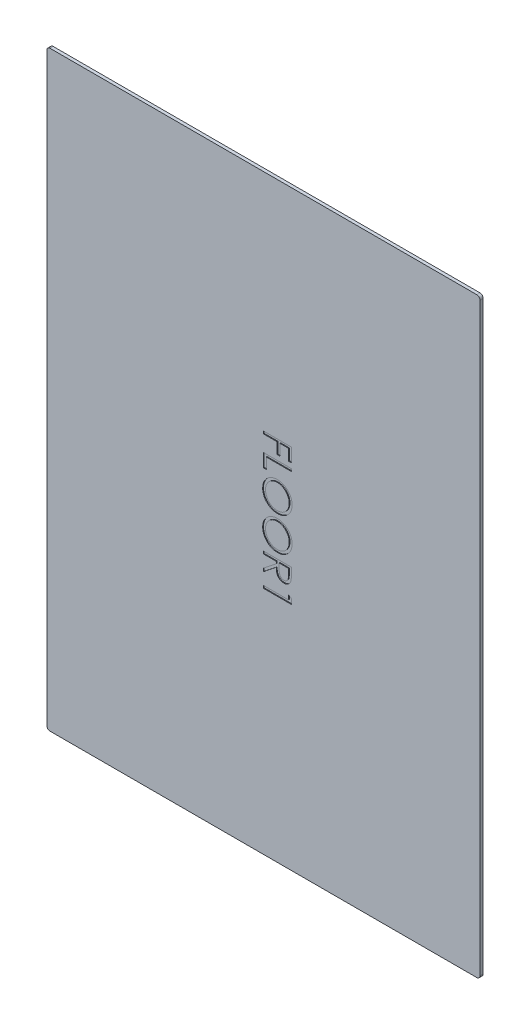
ISO-10303-21;
HEADER;
FILE_DESCRIPTION(('STEP AP214'),'2;1');
FILE_NAME('part.step','',(''),(''),'','','');
FILE_SCHEMA(('AUTOMOTIVE_DESIGN { 1 0 10303 214 1 1 1 1 }'));
ENDSEC;
DATA;
#1=APPLICATION_CONTEXT('core data for automotive mechanical design processes');
#2=APPLICATION_PROTOCOL_DEFINITION('international standard','automotive_design',2000,#1);
#3=PRODUCT_CONTEXT('',#1,'mechanical');
#4=PRODUCT('Part','Part','',(#3));
#5=PRODUCT_RELATED_PRODUCT_CATEGORY('part','',(#4));
#6=PRODUCT_DEFINITION_FORMATION('','',#4);
#7=PRODUCT_DEFINITION_CONTEXT('part definition',#1,'design');
#8=PRODUCT_DEFINITION('design','',#6,#7);
#9=PRODUCT_DEFINITION_SHAPE('','',#8);
#10=(LENGTH_UNIT() NAMED_UNIT(*) SI_UNIT(.MILLI.,.METRE.));
#11=(NAMED_UNIT(*) PLANE_ANGLE_UNIT() SI_UNIT($,.RADIAN.));
#12=(NAMED_UNIT(*) SI_UNIT($,.STERADIAN.) SOLID_ANGLE_UNIT());
#13=UNCERTAINTY_MEASURE_WITH_UNIT(LENGTH_MEASURE(1.E-05),#10,'distance_accuracy_value','');
#14=(GEOMETRIC_REPRESENTATION_CONTEXT(3) GLOBAL_UNCERTAINTY_ASSIGNED_CONTEXT((#13)) GLOBAL_UNIT_ASSIGNED_CONTEXT((#10,
#11,#12)) REPRESENTATION_CONTEXT('',''));
#15=CARTESIAN_POINT('',(0.,0.,0.));
#16=DIRECTION('',(0.,0.,1.));
#17=DIRECTION('',(1.,0.,0.));
#18=AXIS2_PLACEMENT_3D('',#15,#16,#17);
#19=CARTESIAN_POINT('',(0.,0.,4.));
#20=DIRECTION('',(0.,0.,-1.));
#21=DIRECTION('',(-1.,0.,0.));
#22=AXIS2_PLACEMENT_3D('',#19,#20,#21);
#23=PLANE('',#22);
#24=DIRECTION('',(1.,0.,0.));
#25=VECTOR('',#24,1.);
#26=CARTESIAN_POINT('',(-271.,-304.48717948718,4.));
#27=LINE('',#26,#25);
#28=CARTESIAN_POINT('',(-271.,-304.48717948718,4.));
#29=VERTEX_POINT('',#28);
#30=CARTESIAN_POINT('',(-236.,-304.48717948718,4.));
#31=VERTEX_POINT('',#30);
#32=EDGE_CURVE('E69',#29,#31,#27,.T.);
#33=ORIENTED_EDGE('',*,*,#32,.T.);
#34=DIRECTION('',(0.,-1.,0.));
#35=VECTOR('',#34,1.);
#36=CARTESIAN_POINT('',(-236.,-304.48717948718,4.));
#37=LINE('',#36,#35);
#38=CARTESIAN_POINT('',(-236.,-307.628205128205,4.));
#39=VERTEX_POINT('',#38);
#40=EDGE_CURVE('E509',#31,#39,#37,.T.);
#41=ORIENTED_EDGE('',*,*,#40,.T.);
#42=DIRECTION('',(-1.,0.,0.));
#43=VECTOR('',#42,1.);
#44=CARTESIAN_POINT('',(-236.,-307.628205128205,4.));
#45=LINE('',#44,#43);
#46=CARTESIAN_POINT('',(-267.410256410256,-307.628205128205,4.));
#47=VERTEX_POINT('',#46);
#48=EDGE_CURVE('E505',#39,#47,#45,.T.);
#49=ORIENTED_EDGE('',*,*,#48,.T.);
#50=DIRECTION('',(0.,-1.,0.));
#51=VECTOR('',#50,1.);
#52=CARTESIAN_POINT('',(-267.410256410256,-307.628205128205,4.));
#53=LINE('',#52,#51);
#54=CARTESIAN_POINT('',(-267.410256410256,-321.089743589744,4.));
#55=VERTEX_POINT('',#54);
#56=EDGE_CURVE('E501',#47,#55,#53,.T.);
#57=ORIENTED_EDGE('',*,*,#56,.T.);
#58=DIRECTION('',(-1.,0.,0.));
#59=VECTOR('',#58,1.);
#60=CARTESIAN_POINT('',(-267.410256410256,-321.089743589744,4.));
#61=LINE('',#60,#59);
#62=CARTESIAN_POINT('',(-271.,-321.089743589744,4.));
#63=VERTEX_POINT('',#62);
#64=EDGE_CURVE('E496',#55,#63,#61,.T.);
#65=ORIENTED_EDGE('',*,*,#64,.T.);
#66=DIRECTION('',(0.,1.,0.));
#67=VECTOR('',#66,1.);
#68=CARTESIAN_POINT('',(-271.,-321.089743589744,4.));
#69=LINE('',#68,#67);
#70=EDGE_CURVE('E492',#63,#29,#69,.T.);
#71=ORIENTED_EDGE('',*,*,#70,.T.);
#72=EDGE_LOOP('',(#33,#41,#49,#57,#65,#71));
#73=FACE_BOUND('',#72,.T.);
#74=CARTESIAN_POINT('',(-253.654246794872,-367.307692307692,4.));
#75=CARTESIAN_POINT('',(-253.237918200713,-367.313033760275,4.));
#76=CARTESIAN_POINT('',(-252.410513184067,-367.323649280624,4.));
#77=CARTESIAN_POINT('',(-251.181875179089,-367.451638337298,4.));
#78=CARTESIAN_POINT('',(-249.9728636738,-367.636985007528,4.));
#79=CARTESIAN_POINT('',(-248.787542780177,-367.904005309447,4.));
#80=CARTESIAN_POINT('',(-247.625718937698,-368.248438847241,4.));
#81=CARTESIAN_POINT('',(-246.489768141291,-368.672894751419,4.));
#82=CARTESIAN_POINT('',(-245.370333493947,-369.159321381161,4.));
#83=CARTESIAN_POINT('',(-244.288719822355,-369.738479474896,4.));
#84=CARTESIAN_POINT('',(-243.243229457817,-370.370358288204,4.));
#85=CARTESIAN_POINT('',(-242.246935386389,-371.059358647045,4.));
#86=CARTESIAN_POINT('',(-241.317634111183,-371.810284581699,4.));
#87=CARTESIAN_POINT('',(-240.440393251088,-372.61240929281,4.));
#88=CARTESIAN_POINT('',(-239.630185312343,-373.476835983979,4.));
#89=CARTESIAN_POINT('',(-238.869345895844,-374.390555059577,4.));
#90=CARTESIAN_POINT('',(-238.165750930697,-375.358347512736,4.));
#91=CARTESIAN_POINT('',(-237.534177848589,-376.381743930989,4.));
#92=CARTESIAN_POINT('',(-236.954070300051,-377.43465243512,4.));
#93=CARTESIAN_POINT('',(-236.469728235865,-378.524711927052,4.));
#94=CARTESIAN_POINT('',(-236.041634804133,-379.628923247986,4.));
#95=CARTESIAN_POINT('',(-235.701427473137,-380.757012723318,4.));
#96=CARTESIAN_POINT('',(-235.430688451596,-381.906370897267,4.));
#97=CARTESIAN_POINT('',(-235.246728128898,-383.078434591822,4.));
#98=CARTESIAN_POINT('',(-235.11845468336,-384.27199659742,4.));
#99=CARTESIAN_POINT('',(-235.10788375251,-385.076111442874,4.));
#100=CARTESIAN_POINT('',(-235.102564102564,-385.480769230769,4.));
#101=B_SPLINE_CURVE_WITH_KNOTS('',3,(#74,#75,#76,#77,#78,#79,#80,#81,#82,#83,#84,#85,#86,#87,
#88,#89,#90,#91,#92,#93,#94,#95,#96,#97,#98,#99,#100),.UNSPECIFIED.,.F.,.F.,(4,1,1,1,1,1,1,1,1,
1,1,1,1,1,1,1,1,1,1,1,1,1,1,1,4),(0.,0.0432131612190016,0.0858811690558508,0.128132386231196,
0.170168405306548,0.211938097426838,0.253861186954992,0.296020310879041,0.338574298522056,
0.38115042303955,0.422820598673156,0.464244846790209,0.505120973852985,0.546150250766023,
0.58716445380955,0.628521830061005,0.670271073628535,0.711969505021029,0.753242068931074,
0.794029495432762,0.834869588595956,0.875486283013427,0.916539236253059,0.957999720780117,1.),.UNSPECIFIED.);
#102=CARTESIAN_POINT('',(-253.654246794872,-367.307692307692,4.));
#103=VERTEX_POINT('',#102);
#104=CARTESIAN_POINT('',(-235.102564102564,-385.480769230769,4.));
#105=VERTEX_POINT('',#104);
#106=EDGE_CURVE('E677',#103,#105,#101,.T.);
#107=ORIENTED_EDGE('',*,*,#106,.T.);
#108=CARTESIAN_POINT('',(-235.102564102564,-385.480769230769,4.));
#109=CARTESIAN_POINT('',(-235.118979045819,-386.128850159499,4.));
#110=CARTESIAN_POINT('',(-235.151219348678,-387.401734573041,4.));
#111=CARTESIAN_POINT('',(-235.398008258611,-389.272485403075,4.));
#112=CARTESIAN_POINT('',(-235.824969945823,-391.058429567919,4.));
#113=CARTESIAN_POINT('',(-236.39357136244,-392.774155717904,4.));
#114=CARTESIAN_POINT('',(-237.152220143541,-394.39899402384,4.));
#115=CARTESIAN_POINT('',(-238.068678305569,-395.945725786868,4.));
#116=CARTESIAN_POINT('',(-239.155980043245,-397.409977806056,4.));
#117=CARTESIAN_POINT('',(-240.395880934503,-398.778328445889,4.));
#118=CARTESIAN_POINT('',(-241.749861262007,-400.025902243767,4.));
#119=CARTESIAN_POINT('',(-243.198967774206,-401.115898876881,4.));
#120=CARTESIAN_POINT('',(-244.723357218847,-402.037482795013,4.));
#121=CARTESIAN_POINT('',(-246.328334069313,-402.792840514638,4.));
#122=CARTESIAN_POINT('',(-248.00683425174,-403.385961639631,4.));
#123=CARTESIAN_POINT('',(-249.768401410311,-403.795115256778,4.));
#124=CARTESIAN_POINT('',(-251.60146089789,-404.056506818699,4.));
#125=CARTESIAN_POINT('',(-252.851730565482,-404.087063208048,4.));
#126=CARTESIAN_POINT('',(-253.485977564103,-404.102564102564,4.));
#127=B_SPLINE_CURVE_WITH_KNOTS('',3,(#108,#109,#110,#111,#112,#113,#114,#115,#116,#117,#118,
#119,#120,#121,#122,#123,#124,#125,#126),.UNSPECIFIED.,.F.,.F.,(4,1,1,1,1,1,1,1,1,1,1,1,1,1,1,1,
4),(0.,0.0665678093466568,0.130744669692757,0.193406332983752,0.254980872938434,
0.316102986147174,0.377249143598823,0.439386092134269,0.503131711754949,0.566683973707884,
0.62824353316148,0.689101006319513,0.749353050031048,0.810175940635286,0.871614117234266,
0.934871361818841,1.),.UNSPECIFIED.);
#128=CARTESIAN_POINT('',(-253.485977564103,-404.102564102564,4.));
#129=VERTEX_POINT('',#128);
#130=EDGE_CURVE('E668',#105,#129,#127,.T.);
#131=ORIENTED_EDGE('',*,*,#130,.T.);
#132=CARTESIAN_POINT('',(-253.485977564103,-404.102564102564,4.));
#133=CARTESIAN_POINT('',(-254.115552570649,-404.0870655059,4.));
#134=CARTESIAN_POINT('',(-255.356517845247,-404.056515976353,4.));
#135=CARTESIAN_POINT('',(-257.177944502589,-403.794817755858,4.));
#136=CARTESIAN_POINT('',(-258.928880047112,-403.384446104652,4.));
#137=CARTESIAN_POINT('',(-260.606231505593,-402.798342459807,4.));
#138=CARTESIAN_POINT('',(-262.212399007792,-402.046613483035,4.));
#139=CARTESIAN_POINT('',(-263.739590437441,-401.118801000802,4.));
#140=CARTESIAN_POINT('',(-265.198730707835,-400.036020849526,4.));
#141=CARTESIAN_POINT('',(-266.559283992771,-398.792759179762,4.));
#142=CARTESIAN_POINT('',(-267.809308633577,-397.439101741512,4.));
#143=CARTESIAN_POINT('',(-268.900999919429,-395.985908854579,4.));
#144=CARTESIAN_POINT('',(-269.833930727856,-394.463019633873,4.));
#145=CARTESIAN_POINT('',(-270.584107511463,-392.859013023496,4.));
#146=CARTESIAN_POINT('',(-271.181426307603,-391.191771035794,4.));
#147=CARTESIAN_POINT('',(-271.589061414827,-389.446013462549,4.));
#148=CARTESIAN_POINT('',(-271.851902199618,-387.629530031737,4.));
#149=CARTESIAN_POINT('',(-271.882091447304,-386.390822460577,4.));
#150=CARTESIAN_POINT('',(-271.897435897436,-385.761217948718,4.));
#151=B_SPLINE_CURVE_WITH_KNOTS('',3,(#132,#133,#134,#135,#136,#137,#138,#139,#140,#141,#142,
#143,#144,#145,#146,#147,#148,#149,#150),.UNSPECIFIED.,.F.,.F.,(4,1,1,1,1,1,1,1,1,1,1,1,1,1,1,1,
4),(0.,0.0652224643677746,0.128561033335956,0.190308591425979,0.251362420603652,
0.312368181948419,0.373765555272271,0.436259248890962,0.500390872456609,0.564506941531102,
0.626951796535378,0.688474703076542,0.749261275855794,0.810166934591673,0.871678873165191,
0.934777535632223,1.),.UNSPECIFIED.);
#152=CARTESIAN_POINT('',(-271.897435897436,-385.761217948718,4.));
#153=VERTEX_POINT('',#152);
#154=EDGE_CURVE('E658',#129,#153,#151,.T.);
#155=ORIENTED_EDGE('',*,*,#154,.T.);
#156=CARTESIAN_POINT('',(-271.897435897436,-385.761217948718,4.));
#157=CARTESIAN_POINT('',(-271.881944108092,-385.126973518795,4.));
#158=CARTESIAN_POINT('',(-271.851405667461,-383.876708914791,4.));
#159=CARTESIAN_POINT('',(-271.589561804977,-382.041356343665,4.));
#160=CARTESIAN_POINT('',(-271.180258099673,-380.278513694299,4.));
#161=CARTESIAN_POINT('',(-270.594763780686,-378.593608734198,4.));
#162=CARTESIAN_POINT('',(-269.840929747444,-376.986088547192,4.));
#163=CARTESIAN_POINT('',(-268.914579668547,-375.456108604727,4.));
#164=CARTESIAN_POINT('',(-267.823003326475,-374.001830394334,4.));
#165=CARTESIAN_POINT('',(-266.581396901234,-372.638052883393,4.));
#166=CARTESIAN_POINT('',(-265.227088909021,-371.391744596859,4.));
#167=CARTESIAN_POINT('',(-263.783447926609,-370.295544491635,4.));
#168=CARTESIAN_POINT('',(-262.2642038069,-369.374535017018,4.));
#169=CARTESIAN_POINT('',(-260.675619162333,-368.620382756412,4.));
#170=CARTESIAN_POINT('',(-259.021800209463,-368.023877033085,4.));
#171=CARTESIAN_POINT('',(-257.292343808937,-367.616791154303,4.));
#172=CARTESIAN_POINT('',(-255.496941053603,-367.35344185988,4.));
#173=CARTESIAN_POINT('',(-254.274513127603,-367.323091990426,4.));
#174=CARTESIAN_POINT('',(-253.654246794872,-367.307692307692,4.));
#175=B_SPLINE_CURVE_WITH_KNOTS('',3,(#156,#157,#158,#159,#160,#161,#162,#163,#164,#165,#166,
#167,#168,#169,#170,#171,#172,#173,#174),.UNSPECIFIED.,.F.,.F.,(4,1,1,1,1,1,1,1,1,1,1,1,1,1,1,1,
4),(0.,0.0658229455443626,0.12975454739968,0.192083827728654,0.253475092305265,
0.314589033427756,0.37609528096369,0.438844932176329,0.503090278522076,0.567320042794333,
0.62968190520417,0.690980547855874,0.751436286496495,0.811992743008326,0.873141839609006,
0.935631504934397,1.),.UNSPECIFIED.);
#176=EDGE_CURVE('E652',#153,#103,#175,.T.);
#177=ORIENTED_EDGE('',*,*,#176,.T.);
#178=EDGE_LOOP('',(#107,#131,#155,#177));
#179=FACE_BOUND('',#178,.T.);
#180=DIRECTION('',(0.867930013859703,-0.496686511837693,0.));
#181=VECTOR('',#180,1.);
#182=CARTESIAN_POINT('',(-239.589743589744,-443.141025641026,4.));
#183=LINE('',#182,#181);
#184=CARTESIAN_POINT('',(-239.589743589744,-443.141025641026,4.));
#185=VERTEX_POINT('',#184);
#186=CARTESIAN_POINT('',(-236.,-445.1953125,4.));
#187=VERTEX_POINT('',#186);
#188=EDGE_CURVE('E745',#185,#187,#183,.T.);
#189=ORIENTED_EDGE('',*,*,#188,.T.);
#190=DIRECTION('',(0.,-1.,0.));
#191=VECTOR('',#190,1.);
#192=CARTESIAN_POINT('',(-236.,-445.1953125,4.));
#193=LINE('',#192,#191);
#194=CARTESIAN_POINT('',(-236.,-451.666666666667,4.));
#195=VERTEX_POINT('',#194);
#196=EDGE_CURVE('E992',#187,#195,#193,.T.);
#197=ORIENTED_EDGE('',*,*,#196,.T.);
#198=DIRECTION('',(-1.,0.,0.));
#199=VECTOR('',#198,1.);
#200=CARTESIAN_POINT('',(-236.,-451.666666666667,4.));
#201=LINE('',#200,#199);
#202=CARTESIAN_POINT('',(-271.,-451.666666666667,4.));
#203=VERTEX_POINT('',#202);
#204=EDGE_CURVE('E988',#195,#203,#201,.T.);
#205=ORIENTED_EDGE('',*,*,#204,.T.);
#206=DIRECTION('',(0.,1.,0.));
#207=VECTOR('',#206,1.);
#208=CARTESIAN_POINT('',(-271.,-451.666666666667,4.));
#209=LINE('',#208,#207);
#210=CARTESIAN_POINT('',(-271.,-448.525641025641,4.));
#211=VERTEX_POINT('',#210);
#212=EDGE_CURVE('E984',#203,#211,#209,.T.);
#213=ORIENTED_EDGE('',*,*,#212,.T.);
#214=DIRECTION('',(1.,0.,0.));
#215=VECTOR('',#214,1.);
#216=CARTESIAN_POINT('',(-271.,-448.525641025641,4.));
#217=LINE('',#216,#215);
#218=CARTESIAN_POINT('',(-239.589743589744,-448.525641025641,4.));
#219=VERTEX_POINT('',#218);
#220=EDGE_CURVE('E979',#211,#219,#217,.T.);
#221=ORIENTED_EDGE('',*,*,#220,.T.);
#222=DIRECTION('',(0.,1.,0.));
#223=VECTOR('',#222,1.);
#224=CARTESIAN_POINT('',(-239.589743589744,-448.525641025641,4.));
#225=LINE('',#224,#223);
#226=EDGE_CURVE('E975',#219,#185,#225,.T.);
#227=ORIENTED_EDGE('',*,*,#226,.T.);
#228=EDGE_LOOP('',(#189,#197,#205,#213,#221,#227));
#229=FACE_BOUND('',#228,.T.);
#230=DIRECTION('',(1.,0.,0.));
#231=VECTOR('',#230,1.);
#232=CARTESIAN_POINT('',(0.,-740.,4.));
#233=LINE('',#232,#231);
#234=CARTESIAN_POINT('',(-538.,-740.,4.));
#235=VERTEX_POINT('',#234);
#236=CARTESIAN_POINT('',(-3.99999999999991,-740.,4.));
#237=VERTEX_POINT('',#236);
#238=EDGE_CURVE('E1029',#235,#237,#233,.T.);
#239=ORIENTED_EDGE('',*,*,#238,.T.);
#240=CARTESIAN_POINT('',(-3.99999999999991,-736.,4.));
#241=DIRECTION('',(0.,0.,-1.));
#242=DIRECTION('',(-1.,0.,0.));
#243=AXIS2_PLACEMENT_3D('',#240,#241,#242);
#244=CIRCLE('',#243,4.);
#245=CARTESIAN_POINT('',(0.,-736.,4.));
#246=VERTEX_POINT('',#245);
#247=EDGE_CURVE('E1078',#237,#246,#244,.F.);
#248=ORIENTED_EDGE('',*,*,#247,.T.);
#249=DIRECTION('',(0.,1.,0.));
#250=VECTOR('',#249,1.);
#251=CARTESIAN_POINT('',(0.,0.,4.));
#252=LINE('',#251,#250);
#253=CARTESIAN_POINT('',(0.,-4.,4.));
#254=VERTEX_POINT('',#253);
#255=EDGE_CURVE('E1016',#246,#254,#252,.T.);
#256=ORIENTED_EDGE('',*,*,#255,.T.);
#257=CARTESIAN_POINT('',(-4.,-4.,4.));
#258=DIRECTION('',(0.,0.,-1.));
#259=DIRECTION('',(-1.,0.,0.));
#260=AXIS2_PLACEMENT_3D('',#257,#258,#259);
#261=CIRCLE('',#260,4.);
#262=CARTESIAN_POINT('',(-4.,0.,4.));
#263=VERTEX_POINT('',#262);
#264=EDGE_CURVE('E1069',#254,#263,#261,.F.);
#265=ORIENTED_EDGE('',*,*,#264,.T.);
#266=DIRECTION('',(-1.,0.,0.));
#267=VECTOR('',#266,1.);
#268=CARTESIAN_POINT('',(0.,0.,4.));
#269=LINE('',#268,#267);
#270=CARTESIAN_POINT('',(-538.,0.,4.));
#271=VERTEX_POINT('',#270);
#272=EDGE_CURVE('E1020',#263,#271,#269,.T.);
#273=ORIENTED_EDGE('',*,*,#272,.T.);
#274=CARTESIAN_POINT('',(-538.,-4.00000000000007,4.));
#275=DIRECTION('',(0.,0.,-1.));
#276=DIRECTION('',(-1.,0.,0.));
#277=AXIS2_PLACEMENT_3D('',#274,#275,#276);
#278=CIRCLE('',#277,4.);
#279=CARTESIAN_POINT('',(-542.,-4.00000000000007,4.));
#280=VERTEX_POINT('',#279);
#281=EDGE_CURVE('E1072',#271,#280,#278,.F.);
#282=ORIENTED_EDGE('',*,*,#281,.T.);
#283=DIRECTION('',(0.,-1.,0.));
#284=VECTOR('',#283,1.);
#285=CARTESIAN_POINT('',(-542.,0.,4.));
#286=LINE('',#285,#284);
#287=CARTESIAN_POINT('',(-542.,-736.,4.));
#288=VERTEX_POINT('',#287);
#289=EDGE_CURVE('E1025',#280,#288,#286,.T.);
#290=ORIENTED_EDGE('',*,*,#289,.T.);
#291=CARTESIAN_POINT('',(-538.,-736.,4.));
#292=DIRECTION('',(0.,0.,-1.));
#293=DIRECTION('',(-1.,0.,0.));
#294=AXIS2_PLACEMENT_3D('',#291,#292,#293);
#295=CIRCLE('',#294,4.);
#296=EDGE_CURVE('E1075',#288,#235,#295,.F.);
#297=ORIENTED_EDGE('',*,*,#296,.T.);
#298=EDGE_LOOP('',(#239,#248,#256,#265,#273,#282,#290,#297));
#299=FACE_BOUND('',#298,.T.);
#300=DIRECTION('',(1.,0.,0.));
#301=VECTOR('',#300,1.);
#302=CARTESIAN_POINT('',(-271.,-411.282051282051,4.));
#303=LINE('',#302,#301);
#304=CARTESIAN_POINT('',(-271.,-411.282051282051,4.));
#305=VERTEX_POINT('',#304);
#306=CARTESIAN_POINT('',(-236.,-411.282051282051,4.));
#307=VERTEX_POINT('',#306);
#308=EDGE_CURVE('E833',#305,#307,#303,.T.);
#309=ORIENTED_EDGE('',*,*,#308,.T.);
#310=DIRECTION('',(0.,-1.,0.));
#311=VECTOR('',#310,1.);
#312=CARTESIAN_POINT('',(-236.,-411.282051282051,4.));
#313=LINE('',#312,#311);
#314=CARTESIAN_POINT('',(-236.,-418.28625801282,4.));
#315=VERTEX_POINT('',#314);
#316=EDGE_CURVE('E826',#307,#315,#313,.T.);
#317=ORIENTED_EDGE('',*,*,#316,.T.);
#318=CARTESIAN_POINT('',(-236.,-418.28625801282,4.));
#319=CARTESIAN_POINT('',(-236.00155585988,-418.753669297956,4.));
#320=CARTESIAN_POINT('',(-236.004543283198,-419.651150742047,4.));
#321=CARTESIAN_POINT('',(-236.021200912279,-420.936883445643,4.));
#322=CARTESIAN_POINT('',(-236.068944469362,-422.105154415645,4.));
#323=CARTESIAN_POINT('',(-236.110030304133,-423.155352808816,4.));
#324=CARTESIAN_POINT('',(-236.184949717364,-424.08745935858,4.));
#325=CARTESIAN_POINT('',(-236.256556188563,-424.904332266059,4.));
#326=CARTESIAN_POINT('',(-236.350292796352,-425.602209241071,4.));
#327=CARTESIAN_POINT('',(-236.437347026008,-426.024667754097,4.));
#328=CARTESIAN_POINT('',(-236.476762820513,-426.21594551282,4.));
#329=B_SPLINE_CURVE_WITH_KNOTS('',3,(#318,#319,#320,#321,#322,#323,#324,#325,#326,#327,#328),
.UNSPECIFIED.,.F.,.F.,(4,1,1,1,1,1,1,1,4),(0.,0.176257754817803,0.338434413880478,
0.484822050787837,0.617157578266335,0.734698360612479,0.83738518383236,0.926372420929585,1.),.UNSPECIFIED.);
#330=CARTESIAN_POINT('',(-236.476762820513,-426.21594551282,4.));
#331=VERTEX_POINT('',#330);
#332=EDGE_CURVE('E817',#315,#331,#329,.T.);
#333=ORIENTED_EDGE('',*,*,#332,.T.);
#334=CARTESIAN_POINT('',(-236.476762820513,-426.21594551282,4.));
#335=CARTESIAN_POINT('',(-236.540023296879,-426.472016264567,4.));
#336=CARTESIAN_POINT('',(-236.665194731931,-426.978695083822,4.));
#337=CARTESIAN_POINT('',(-236.92989486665,-427.708130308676,4.));
#338=CARTESIAN_POINT('',(-237.23570695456,-428.403514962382,4.));
#339=CARTESIAN_POINT('',(-237.597682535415,-429.062239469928,4.));
#340=CARTESIAN_POINT('',(-238.009507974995,-429.684364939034,4.));
#341=CARTESIAN_POINT('',(-238.473589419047,-430.268959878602,4.));
#342=CARTESIAN_POINT('',(-238.992290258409,-430.812681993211,4.));
#343=CARTESIAN_POINT('',(-239.552365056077,-431.319714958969,4.));
#344=CARTESIAN_POINT('',(-240.158700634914,-431.779324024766,4.));
#345=CARTESIAN_POINT('',(-240.802464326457,-432.177055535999,4.));
#346=CARTESIAN_POINT('',(-241.47962976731,-432.517631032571,4.));
#347=CARTESIAN_POINT('',(-242.192555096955,-432.78952269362,4.));
#348=CARTESIAN_POINT('',(-242.935213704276,-433.008251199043,4.));
#349=CARTESIAN_POINT('',(-243.714090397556,-433.162527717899,4.));
#350=CARTESIAN_POINT('',(-244.525703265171,-433.255035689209,4.));
#351=CARTESIAN_POINT('',(-245.079281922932,-433.264454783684,4.));
#352=CARTESIAN_POINT('',(-245.359975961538,-433.269230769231,4.));
#353=B_SPLINE_CURVE_WITH_KNOTS('',3,(#334,#335,#336,#337,#338,#339,#340,#341,#342,#343,#344,
#345,#346,#347,#348,#349,#350,#351,#352),.UNSPECIFIED.,.F.,.F.,(4,1,1,1,1,1,1,1,1,1,1,1,1,1,1,1,
4),(0.,0.0642108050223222,0.127051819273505,0.18872679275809,0.249108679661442,
0.309897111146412,0.37026557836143,0.43066893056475,0.492744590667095,0.554114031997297,
0.615725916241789,0.676828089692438,0.738463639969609,0.80133559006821,0.86519718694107,
0.931647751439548,1.),.UNSPECIFIED.);
#354=CARTESIAN_POINT('',(-245.359975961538,-433.269230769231,4.));
#355=VERTEX_POINT('',#354);
#356=EDGE_CURVE('E808',#331,#355,#353,.T.);
#357=ORIENTED_EDGE('',*,*,#356,.T.);
#358=CARTESIAN_POINT('',(-245.359975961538,-433.269230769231,4.));
#359=CARTESIAN_POINT('',(-245.826327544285,-433.254541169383,4.));
#360=CARTESIAN_POINT('',(-246.736300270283,-433.22587795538,4.));
#361=CARTESIAN_POINT('',(-248.056901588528,-432.958621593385,4.));
#362=CARTESIAN_POINT('',(-249.288822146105,-432.520875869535,4.));
#363=CARTESIAN_POINT('',(-250.43034753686,-431.917571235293,4.));
#364=CARTESIAN_POINT('',(-251.459827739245,-431.149641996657,4.));
#365=CARTESIAN_POINT('',(-252.360995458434,-430.226765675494,4.));
#366=CARTESIAN_POINT('',(-253.122072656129,-429.153655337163,4.));
#367=CARTESIAN_POINT('',(-253.644238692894,-428.149969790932,4.));
#368=CARTESIAN_POINT('',(-253.980222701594,-427.262945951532,4.));
#369=CARTESIAN_POINT('',(-254.217809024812,-426.530549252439,4.));
#370=CARTESIAN_POINT('',(-254.398278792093,-425.731021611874,4.));
#371=CARTESIAN_POINT('',(-254.562300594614,-424.875833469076,4.));
#372=CARTESIAN_POINT('',(-254.68746240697,-423.958379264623,4.));
#373=CARTESIAN_POINT('',(-254.776351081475,-422.980506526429,4.));
#374=CARTESIAN_POINT('',(-254.833507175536,-421.939769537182,4.));
#375=CARTESIAN_POINT('',(-254.841857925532,-421.226371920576,4.));
#376=CARTESIAN_POINT('',(-254.846153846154,-420.859375,4.));
#377=B_SPLINE_CURVE_WITH_KNOTS('',3,(#358,#359,#360,#361,#362,#363,#364,#365,#366,#367,#368,
#369,#370,#371,#372,#373,#374,#375,#376),.UNSPECIFIED.,.F.,.F.,(4,1,1,1,1,1,1,1,1,1,1,1,1,1,1,1,
4),(0.,0.0787751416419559,0.153710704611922,0.226698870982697,0.299171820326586,
0.37116599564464,0.442977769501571,0.516334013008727,0.592857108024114,0.633510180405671,
0.676623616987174,0.722915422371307,0.771971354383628,0.823829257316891,0.879386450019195,
0.937952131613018,1.),.UNSPECIFIED.);
#378=CARTESIAN_POINT('',(-254.846153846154,-420.859375,4.));
#379=VERTEX_POINT('',#378);
#380=EDGE_CURVE('E802',#355,#379,#377,.T.);
#381=ORIENTED_EDGE('',*,*,#380,.T.);
#382=DIRECTION('',(-0.782390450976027,-0.622788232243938,0.));
#383=VECTOR('',#382,1.);
#384=CARTESIAN_POINT('',(-254.846153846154,-420.859375,4.));
#385=LINE('',#384,#383);
#386=CARTESIAN_POINT('',(-271.,-433.717948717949,4.));
#387=VERTEX_POINT('',#386);
#388=EDGE_CURVE('E798',#379,#387,#385,.T.);
#389=ORIENTED_EDGE('',*,*,#388,.T.);
#390=DIRECTION('',(0.,1.,0.));
#391=VECTOR('',#390,1.);
#392=CARTESIAN_POINT('',(-271.,-433.717948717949,4.));
#393=LINE('',#392,#391);
#394=CARTESIAN_POINT('',(-271.,-429.833733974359,4.));
#395=VERTEX_POINT('',#394);
#396=EDGE_CURVE('E794',#387,#395,#393,.T.);
#397=ORIENTED_EDGE('',*,*,#396,.T.);
#398=DIRECTION('',(0.782390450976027,0.622788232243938,0.));
#399=VECTOR('',#398,1.);
#400=CARTESIAN_POINT('',(-271.,-429.833733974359,4.));
#401=LINE('',#400,#399);
#402=CARTESIAN_POINT('',(-254.846153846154,-416.97516025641,4.));
#403=VERTEX_POINT('',#402);
#404=EDGE_CURVE('E790',#395,#403,#401,.T.);
#405=ORIENTED_EDGE('',*,*,#404,.T.);
#406=DIRECTION('',(0.,1.,0.));
#407=VECTOR('',#406,1.);
#408=CARTESIAN_POINT('',(-254.846153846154,-416.97516025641,4.));
#409=LINE('',#408,#407);
#410=CARTESIAN_POINT('',(-254.846153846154,-414.423076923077,4.));
#411=VERTEX_POINT('',#410);
#412=EDGE_CURVE('E786',#403,#411,#409,.T.);
#413=ORIENTED_EDGE('',*,*,#412,.T.);
#414=DIRECTION('',(-1.,0.,0.));
#415=VECTOR('',#414,1.);
#416=CARTESIAN_POINT('',(-254.846153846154,-414.423076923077,4.));
#417=LINE('',#416,#415);
#418=CARTESIAN_POINT('',(-271.,-414.423076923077,4.));
#419=VERTEX_POINT('',#418);
#420=EDGE_CURVE('E781',#411,#419,#417,.T.);
#421=ORIENTED_EDGE('',*,*,#420,.T.);
#422=DIRECTION('',(0.,1.,0.));
#423=VECTOR('',#422,1.);
#424=CARTESIAN_POINT('',(-271.,-414.423076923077,4.));
#425=LINE('',#424,#423);
#426=EDGE_CURVE('E777',#419,#305,#425,.T.);
#427=ORIENTED_EDGE('',*,*,#426,.T.);
#428=EDGE_LOOP('',(#309,#317,#333,#357,#381,#389,#397,#405,#413,#421,#427));
#429=FACE_BOUND('',#428,.T.);
#430=CARTESIAN_POINT('',(-253.654246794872,-325.128205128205,4.));
#431=CARTESIAN_POINT('',(-253.237918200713,-325.133546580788,4.));
#432=CARTESIAN_POINT('',(-252.410513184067,-325.144162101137,4.));
#433=CARTESIAN_POINT('',(-251.181875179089,-325.272151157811,4.));
#434=CARTESIAN_POINT('',(-249.9728636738,-325.457497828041,4.));
#435=CARTESIAN_POINT('',(-248.787542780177,-325.72451812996,4.));
#436=CARTESIAN_POINT('',(-247.625718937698,-326.068951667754,4.));
#437=CARTESIAN_POINT('',(-246.489768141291,-326.493407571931,4.));
#438=CARTESIAN_POINT('',(-245.370333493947,-326.979834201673,4.));
#439=CARTESIAN_POINT('',(-244.288719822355,-327.558992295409,4.));
#440=CARTESIAN_POINT('',(-243.243229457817,-328.190871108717,4.));
#441=CARTESIAN_POINT('',(-242.246935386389,-328.879871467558,4.));
#442=CARTESIAN_POINT('',(-241.317634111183,-329.630797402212,4.));
#443=CARTESIAN_POINT('',(-240.440393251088,-330.432922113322,4.));
#444=CARTESIAN_POINT('',(-239.630185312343,-331.297348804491,4.));
#445=CARTESIAN_POINT('',(-238.869345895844,-332.21106788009,4.));
#446=CARTESIAN_POINT('',(-238.165750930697,-333.178860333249,4.));
#447=CARTESIAN_POINT('',(-237.534177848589,-334.202256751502,4.));
#448=CARTESIAN_POINT('',(-236.954070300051,-335.255165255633,4.));
#449=CARTESIAN_POINT('',(-236.469728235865,-336.345224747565,4.));
#450=CARTESIAN_POINT('',(-236.041634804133,-337.449436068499,4.));
#451=CARTESIAN_POINT('',(-235.701427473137,-338.577525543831,4.));
#452=CARTESIAN_POINT('',(-235.430688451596,-339.72688371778,4.));
#453=CARTESIAN_POINT('',(-235.246728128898,-340.898947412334,4.));
#454=CARTESIAN_POINT('',(-235.11845468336,-342.092509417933,4.));
#455=CARTESIAN_POINT('',(-235.10788375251,-342.896624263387,4.));
#456=CARTESIAN_POINT('',(-235.102564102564,-343.301282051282,4.));
#457=B_SPLINE_CURVE_WITH_KNOTS('',3,(#430,#431,#432,#433,#434,#435,#436,#437,#438,#439,#440,
#441,#442,#443,#444,#445,#446,#447,#448,#449,#450,#451,#452,#453,#454,#455,#456),.UNSPECIFIED.,
.F.,.F.,(4,1,1,1,1,1,1,1,1,1,1,1,1,1,1,1,1,1,1,1,1,1,1,1,4),(0.,0.0432131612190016,
0.0858811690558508,0.128132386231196,0.170168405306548,0.211938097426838,0.253861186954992,
0.296020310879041,0.338574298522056,0.38115042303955,0.422820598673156,0.464244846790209,
0.505120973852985,0.546150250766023,0.58716445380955,0.628521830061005,0.670271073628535,
0.711969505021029,0.753242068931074,0.794029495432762,0.834869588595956,0.875486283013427,
0.916539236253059,0.957999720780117,1.),.UNSPECIFIED.);
#458=CARTESIAN_POINT('',(-253.654246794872,-325.128205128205,4.));
#459=VERTEX_POINT('',#458);
#460=CARTESIAN_POINT('',(-235.102564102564,-343.301282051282,4.));
#461=VERTEX_POINT('',#460);
#462=EDGE_CURVE('E573',#459,#461,#457,.T.);
#463=ORIENTED_EDGE('',*,*,#462,.T.);
#464=CARTESIAN_POINT('',(-235.102564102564,-343.301282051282,4.));
#465=CARTESIAN_POINT('',(-235.118979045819,-343.949362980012,4.));
#466=CARTESIAN_POINT('',(-235.151219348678,-345.222247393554,4.));
#467=CARTESIAN_POINT('',(-235.398008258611,-347.092998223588,4.));
#468=CARTESIAN_POINT('',(-235.824969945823,-348.878942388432,4.));
#469=CARTESIAN_POINT('',(-236.39357136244,-350.594668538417,4.));
#470=CARTESIAN_POINT('',(-237.152220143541,-352.219506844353,4.));
#471=CARTESIAN_POINT('',(-238.068678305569,-353.766238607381,4.));
#472=CARTESIAN_POINT('',(-239.155980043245,-355.230490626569,4.));
#473=CARTESIAN_POINT('',(-240.395880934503,-356.598841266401,4.));
#474=CARTESIAN_POINT('',(-241.749861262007,-357.84641506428,4.));
#475=CARTESIAN_POINT('',(-243.198967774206,-358.936411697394,4.));
#476=CARTESIAN_POINT('',(-244.723357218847,-359.857995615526,4.));
#477=CARTESIAN_POINT('',(-246.328334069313,-360.613353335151,4.));
#478=CARTESIAN_POINT('',(-248.00683425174,-361.206474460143,4.));
#479=CARTESIAN_POINT('',(-249.768401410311,-361.615628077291,4.));
#480=CARTESIAN_POINT('',(-251.60146089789,-361.877019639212,4.));
#481=CARTESIAN_POINT('',(-252.851730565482,-361.907576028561,4.));
#482=CARTESIAN_POINT('',(-253.485977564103,-361.923076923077,4.));
#483=B_SPLINE_CURVE_WITH_KNOTS('',3,(#464,#465,#466,#467,#468,#469,#470,#471,#472,#473,#474,
#475,#476,#477,#478,#479,#480,#481,#482),.UNSPECIFIED.,.F.,.F.,(4,1,1,1,1,1,1,1,1,1,1,1,1,1,1,1,
4),(0.,0.0665678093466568,0.130744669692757,0.193406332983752,0.254980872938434,
0.316102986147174,0.377249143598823,0.439386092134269,0.503131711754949,0.566683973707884,
0.62824353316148,0.689101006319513,0.749353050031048,0.810175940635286,0.871614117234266,
0.934871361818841,1.),.UNSPECIFIED.);
#484=CARTESIAN_POINT('',(-253.485977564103,-361.923076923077,4.));
#485=VERTEX_POINT('',#484);
#486=EDGE_CURVE('E564',#461,#485,#483,.T.);
#487=ORIENTED_EDGE('',*,*,#486,.T.);
#488=CARTESIAN_POINT('',(-253.485977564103,-361.923076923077,4.));
#489=CARTESIAN_POINT('',(-254.115552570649,-361.907578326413,4.));
#490=CARTESIAN_POINT('',(-255.356517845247,-361.877028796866,4.));
#491=CARTESIAN_POINT('',(-257.177944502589,-361.615330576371,4.));
#492=CARTESIAN_POINT('',(-258.928880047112,-361.204958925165,4.));
#493=CARTESIAN_POINT('',(-260.606231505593,-360.61885528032,4.));
#494=CARTESIAN_POINT('',(-262.212399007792,-359.867126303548,4.));
#495=CARTESIAN_POINT('',(-263.739590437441,-358.939313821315,4.));
#496=CARTESIAN_POINT('',(-265.198730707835,-357.856533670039,4.));
#497=CARTESIAN_POINT('',(-266.559283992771,-356.613272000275,4.));
#498=CARTESIAN_POINT('',(-267.809308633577,-355.259614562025,4.));
#499=CARTESIAN_POINT('',(-268.900999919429,-353.806421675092,4.));
#500=CARTESIAN_POINT('',(-269.833930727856,-352.283532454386,4.));
#501=CARTESIAN_POINT('',(-270.584107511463,-350.679525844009,4.));
#502=CARTESIAN_POINT('',(-271.181426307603,-349.012283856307,4.));
#503=CARTESIAN_POINT('',(-271.589061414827,-347.266526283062,4.));
#504=CARTESIAN_POINT('',(-271.851902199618,-345.45004285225,4.));
#505=CARTESIAN_POINT('',(-271.882091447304,-344.21133528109,4.));
#506=CARTESIAN_POINT('',(-271.897435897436,-343.581730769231,4.));
#507=B_SPLINE_CURVE_WITH_KNOTS('',3,(#488,#489,#490,#491,#492,#493,#494,#495,#496,#497,#498,
#499,#500,#501,#502,#503,#504,#505,#506),.UNSPECIFIED.,.F.,.F.,(4,1,1,1,1,1,1,1,1,1,1,1,1,1,1,1,
4),(0.,0.0652224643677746,0.128561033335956,0.190308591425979,0.251362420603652,
0.312368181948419,0.373765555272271,0.436259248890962,0.500390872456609,0.564506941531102,
0.626951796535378,0.688474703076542,0.749261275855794,0.810166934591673,0.871678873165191,
0.934777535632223,1.),.UNSPECIFIED.);
#508=CARTESIAN_POINT('',(-271.897435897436,-343.581730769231,4.));
#509=VERTEX_POINT('',#508);
#510=EDGE_CURVE('E554',#485,#509,#507,.T.);
#511=ORIENTED_EDGE('',*,*,#510,.T.);
#512=CARTESIAN_POINT('',(-271.897435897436,-343.581730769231,4.));
#513=CARTESIAN_POINT('',(-271.881944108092,-342.947486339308,4.));
#514=CARTESIAN_POINT('',(-271.851405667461,-341.697221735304,4.));
#515=CARTESIAN_POINT('',(-271.589561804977,-339.861869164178,4.));
#516=CARTESIAN_POINT('',(-271.180258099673,-338.099026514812,4.));
#517=CARTESIAN_POINT('',(-270.594763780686,-336.414121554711,4.));
#518=CARTESIAN_POINT('',(-269.840929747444,-334.806601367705,4.));
#519=CARTESIAN_POINT('',(-268.914579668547,-333.27662142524,4.));
#520=CARTESIAN_POINT('',(-267.823003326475,-331.822343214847,4.));
#521=CARTESIAN_POINT('',(-266.581396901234,-330.458565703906,4.));
#522=CARTESIAN_POINT('',(-265.227088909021,-329.212257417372,4.));
#523=CARTESIAN_POINT('',(-263.783447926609,-328.116057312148,4.));
#524=CARTESIAN_POINT('',(-262.2642038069,-327.195047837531,4.));
#525=CARTESIAN_POINT('',(-260.675619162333,-326.440895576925,4.));
#526=CARTESIAN_POINT('',(-259.021800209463,-325.844389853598,4.));
#527=CARTESIAN_POINT('',(-257.292343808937,-325.437303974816,4.));
#528=CARTESIAN_POINT('',(-255.496941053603,-325.173954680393,4.));
#529=CARTESIAN_POINT('',(-254.274513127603,-325.143604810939,4.));
#530=CARTESIAN_POINT('',(-253.654246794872,-325.128205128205,4.));
#531=B_SPLINE_CURVE_WITH_KNOTS('',3,(#512,#513,#514,#515,#516,#517,#518,#519,#520,#521,#522,
#523,#524,#525,#526,#527,#528,#529,#530),.UNSPECIFIED.,.F.,.F.,(4,1,1,1,1,1,1,1,1,1,1,1,1,1,1,1,
4),(0.,0.0658229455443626,0.12975454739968,0.192083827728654,0.253475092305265,
0.314589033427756,0.37609528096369,0.438844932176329,0.503090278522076,0.567320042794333,
0.62968190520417,0.690980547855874,0.751436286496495,0.811992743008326,0.873141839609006,
0.935631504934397,1.),.UNSPECIFIED.);
#532=EDGE_CURVE('E548',#509,#459,#531,.T.);
#533=ORIENTED_EDGE('',*,*,#532,.T.);
#534=EDGE_LOOP('',(#463,#487,#511,#533));
#535=FACE_BOUND('',#534,.T.);
#536=DIRECTION('',(1.,0.,0.));
#537=VECTOR('',#536,1.);
#538=CARTESIAN_POINT('',(-271.,-281.153846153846,4.));
#539=LINE('',#538,#537);
#540=CARTESIAN_POINT('',(-271.,-281.153846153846,4.));
#541=VERTEX_POINT('',#540);
#542=CARTESIAN_POINT('',(-236.,-281.153846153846,4.));
#543=VERTEX_POINT('',#542);
#544=EDGE_CURVE('E61',#541,#543,#539,.T.);
#545=ORIENTED_EDGE('',*,*,#544,.T.);
#546=DIRECTION('',(0.,-1.,0.));
#547=VECTOR('',#546,1.);
#548=CARTESIAN_POINT('',(-236.,-281.153846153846,4.));
#549=LINE('',#548,#547);
#550=CARTESIAN_POINT('',(-236.,-298.205128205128,4.));
#551=VERTEX_POINT('',#550);
#552=EDGE_CURVE('E458',#543,#551,#549,.T.);
#553=ORIENTED_EDGE('',*,*,#552,.T.);
#554=DIRECTION('',(-1.,0.,0.));
#555=VECTOR('',#554,1.);
#556=CARTESIAN_POINT('',(-236.,-298.205128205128,4.));
#557=LINE('',#556,#555);
#558=CARTESIAN_POINT('',(-239.589743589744,-298.205128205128,4.));
#559=VERTEX_POINT('',#558);
#560=EDGE_CURVE('E1878',#551,#559,#557,.T.);
#561=ORIENTED_EDGE('',*,*,#560,.T.);
#562=DIRECTION('',(0.,1.,0.));
#563=VECTOR('',#562,1.);
#564=CARTESIAN_POINT('',(-239.589743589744,-298.205128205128,4.));
#565=LINE('',#564,#563);
#566=CARTESIAN_POINT('',(-239.589743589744,-284.294871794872,4.));
#567=VERTEX_POINT('',#566);
#568=EDGE_CURVE('E1886',#559,#567,#565,.T.);
#569=ORIENTED_EDGE('',*,*,#568,.T.);
#570=DIRECTION('',(-1.,0.,0.));
#571=VECTOR('',#570,1.);
#572=CARTESIAN_POINT('',(-239.589743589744,-284.294871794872,4.));
#573=LINE('',#572,#571);
#574=CARTESIAN_POINT('',(-250.358974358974,-284.294871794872,4.));
#575=VERTEX_POINT('',#574);
#576=EDGE_CURVE('E1890',#567,#575,#573,.T.);
#577=ORIENTED_EDGE('',*,*,#576,.T.);
#578=DIRECTION('',(0.,-1.,0.));
#579=VECTOR('',#578,1.);
#580=CARTESIAN_POINT('',(-250.358974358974,-284.294871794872,4.));
#581=LINE('',#580,#579);
#582=CARTESIAN_POINT('',(-250.358974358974,-298.205128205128,4.));
#583=VERTEX_POINT('',#582);
#584=EDGE_CURVE('E1894',#575,#583,#581,.T.);
#585=ORIENTED_EDGE('',*,*,#584,.T.);
#586=DIRECTION('',(-1.,0.,0.));
#587=VECTOR('',#586,1.);
#588=CARTESIAN_POINT('',(-250.358974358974,-298.205128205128,4.));
#589=LINE('',#588,#587);
#590=CARTESIAN_POINT('',(-253.948717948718,-298.205128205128,4.));
#591=VERTEX_POINT('',#590);
#592=EDGE_CURVE('E1898',#583,#591,#589,.T.);
#593=ORIENTED_EDGE('',*,*,#592,.T.);
#594=DIRECTION('',(0.,1.,0.));
#595=VECTOR('',#594,1.);
#596=CARTESIAN_POINT('',(-253.948717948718,-298.205128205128,4.));
#597=LINE('',#596,#595);
#598=CARTESIAN_POINT('',(-253.948717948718,-284.294871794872,4.));
#599=VERTEX_POINT('',#598);
#600=EDGE_CURVE('E1902',#591,#599,#597,.T.);
#601=ORIENTED_EDGE('',*,*,#600,.T.);
#602=DIRECTION('',(-1.,0.,0.));
#603=VECTOR('',#602,1.);
#604=CARTESIAN_POINT('',(-253.948717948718,-284.294871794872,4.));
#605=LINE('',#604,#603);
#606=CARTESIAN_POINT('',(-271.,-284.294871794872,4.));
#607=VERTEX_POINT('',#606);
#608=EDGE_CURVE('E1906',#599,#607,#605,.T.);
#609=ORIENTED_EDGE('',*,*,#608,.T.);
#610=DIRECTION('',(0.,1.,0.));
#611=VECTOR('',#610,1.);
#612=CARTESIAN_POINT('',(-271.,-284.294871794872,4.));
#613=LINE('',#612,#611);
#614=EDGE_CURVE('E454',#607,#541,#613,.T.);
#615=ORIENTED_EDGE('',*,*,#614,.T.);
#616=EDGE_LOOP('',(#545,#553,#561,#569,#577,#585,#593,#601,#609,#615));
#617=FACE_BOUND('',#616,.T.);
#618=ADVANCED_FACE('F45',(#73,#179,#229,#299,#429,#535,#617),#23,.F.);
#619=CARTESIAN_POINT('',(0.,0.,4.));
#620=DIRECTION('',(-1.,0.,0.));
#621=DIRECTION('',(0.,-1.,0.));
#622=AXIS2_PLACEMENT_3D('',#619,#620,#621);
#623=PLANE('',#622);
#624=ORIENTED_EDGE('',*,*,#255,.F.);
#625=DIRECTION('',(0.,0.,-1.));
#626=VECTOR('',#625,1.);
#627=CARTESIAN_POINT('',(0.,-736.,4.));
#628=LINE('',#627,#626);
#629=CARTESIAN_POINT('',(0.,-736.,0.));
#630=VERTEX_POINT('',#629);
#631=EDGE_CURVE('E1046',#246,#630,#628,.T.);
#632=ORIENTED_EDGE('',*,*,#631,.T.);
#633=DIRECTION('',(0.,1.,0.));
#634=VECTOR('',#633,1.);
#635=CARTESIAN_POINT('',(0.,0.,0.));
#636=LINE('',#635,#634);
#637=CARTESIAN_POINT('',(0.,-4.,0.));
#638=VERTEX_POINT('',#637);
#639=EDGE_CURVE('E460',#630,#638,#636,.T.);
#640=ORIENTED_EDGE('',*,*,#639,.T.);
#641=DIRECTION('',(0.,0.,-1.));
#642=VECTOR('',#641,1.);
#643=CARTESIAN_POINT('',(0.,-4.,4.));
#644=LINE('',#643,#642);
#645=EDGE_CURVE('E1032',#638,#254,#644,.F.);
#646=ORIENTED_EDGE('',*,*,#645,.T.);
#647=EDGE_LOOP('',(#624,#632,#640,#646));
#648=FACE_BOUND('',#647,.T.);
#649=ADVANCED_FACE('F1126',(#648),#623,.F.);
#650=CARTESIAN_POINT('',(0.,0.,4.));
#651=DIRECTION('',(0.,-1.,0.));
#652=DIRECTION('',(1.,0.,0.));
#653=AXIS2_PLACEMENT_3D('',#650,#651,#652);
#654=PLANE('',#653);
#655=DIRECTION('',(-1.,0.,0.));
#656=VECTOR('',#655,1.);
#657=CARTESIAN_POINT('',(0.,0.,0.));
#658=LINE('',#657,#656);
#659=CARTESIAN_POINT('',(-4.,0.,0.));
#660=VERTEX_POINT('',#659);
#661=CARTESIAN_POINT('',(-538.,0.,0.));
#662=VERTEX_POINT('',#661);
#663=EDGE_CURVE('E466',#660,#662,#658,.T.);
#664=ORIENTED_EDGE('',*,*,#663,.T.);
#665=DIRECTION('',(0.,0.,-1.));
#666=VECTOR('',#665,1.);
#667=CARTESIAN_POINT('',(-538.,0.,4.));
#668=LINE('',#667,#666);
#669=EDGE_CURVE('E11',#662,#271,#668,.F.);
#670=ORIENTED_EDGE('',*,*,#669,.T.);
#671=ORIENTED_EDGE('',*,*,#272,.F.);
#672=DIRECTION('',(0.,0.,-1.));
#673=VECTOR('',#672,1.);
#674=CARTESIAN_POINT('',(-4.,0.,4.));
#675=LINE('',#674,#673);
#676=EDGE_CURVE('E54',#263,#660,#675,.T.);
#677=ORIENTED_EDGE('',*,*,#676,.T.);
#678=EDGE_LOOP('',(#664,#670,#671,#677));
#679=FACE_BOUND('',#678,.T.);
#680=ADVANCED_FACE('F1093',(#679),#654,.F.);
#681=CARTESIAN_POINT('',(-542.,0.,4.));
#682=DIRECTION('',(1.,0.,0.));
#683=DIRECTION('',(0.,1.,0.));
#684=AXIS2_PLACEMENT_3D('',#681,#682,#683);
#685=PLANE('',#684);
#686=DIRECTION('',(0.,-1.,0.));
#687=VECTOR('',#686,1.);
#688=CARTESIAN_POINT('',(-542.,0.,0.));
#689=LINE('',#688,#687);
#690=CARTESIAN_POINT('',(-542.,-4.00000000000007,0.));
#691=VERTEX_POINT('',#690);
#692=CARTESIAN_POINT('',(-542.,-736.,0.));
#693=VERTEX_POINT('',#692);
#694=EDGE_CURVE('E1037',#691,#693,#689,.T.);
#695=ORIENTED_EDGE('',*,*,#694,.T.);
#696=DIRECTION('',(0.,0.,-1.));
#697=VECTOR('',#696,1.);
#698=CARTESIAN_POINT('',(-542.,-736.,4.));
#699=LINE('',#698,#697);
#700=EDGE_CURVE('E1085',#693,#288,#699,.F.);
#701=ORIENTED_EDGE('',*,*,#700,.T.);
#702=ORIENTED_EDGE('',*,*,#289,.F.);
#703=DIRECTION('',(0.,0.,-1.));
#704=VECTOR('',#703,1.);
#705=CARTESIAN_POINT('',(-542.,-4.00000000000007,4.));
#706=LINE('',#705,#704);
#707=EDGE_CURVE('E1081',#280,#691,#706,.T.);
#708=ORIENTED_EDGE('',*,*,#707,.T.);
#709=EDGE_LOOP('',(#695,#701,#702,#708));
#710=FACE_BOUND('',#709,.T.);
#711=ADVANCED_FACE('F1107',(#710),#685,.F.);
#712=CARTESIAN_POINT('',(0.,-740.,4.));
#713=DIRECTION('',(0.,1.,0.));
#714=DIRECTION('',(-1.,0.,0.));
#715=AXIS2_PLACEMENT_3D('',#712,#713,#714);
#716=PLANE('',#715);
#717=DIRECTION('',(1.,0.,0.));
#718=VECTOR('',#717,1.);
#719=CARTESIAN_POINT('',(0.,-740.,0.));
#720=LINE('',#719,#718);
#721=CARTESIAN_POINT('',(-538.,-740.,0.));
#722=VERTEX_POINT('',#721);
#723=CARTESIAN_POINT('',(-3.99999999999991,-740.,0.));
#724=VERTEX_POINT('',#723);
#725=EDGE_CURVE('E1021',#722,#724,#720,.T.);
#726=ORIENTED_EDGE('',*,*,#725,.T.);
#727=DIRECTION('',(0.,0.,-1.));
#728=VECTOR('',#727,1.);
#729=CARTESIAN_POINT('',(-3.99999999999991,-740.,4.));
#730=LINE('',#729,#728);
#731=EDGE_CURVE('E1066',#724,#237,#730,.F.);
#732=ORIENTED_EDGE('',*,*,#731,.T.);
#733=ORIENTED_EDGE('',*,*,#238,.F.);
#734=DIRECTION('',(0.,0.,-1.));
#735=VECTOR('',#734,1.);
#736=CARTESIAN_POINT('',(-538.,-740.,4.));
#737=LINE('',#736,#735);
#738=EDGE_CURVE('E1062',#235,#722,#737,.T.);
#739=ORIENTED_EDGE('',*,*,#738,.T.);
#740=EDGE_LOOP('',(#726,#732,#733,#739));
#741=FACE_BOUND('',#740,.T.);
#742=ADVANCED_FACE('F1118',(#741),#716,.F.);
#743=CARTESIAN_POINT('',(0.,0.,0.));
#744=DIRECTION('',(0.,0.,-1.));
#745=DIRECTION('',(-1.,0.,0.));
#746=AXIS2_PLACEMENT_3D('',#743,#744,#745);
#747=PLANE('',#746);
#748=ORIENTED_EDGE('',*,*,#639,.F.);
#749=CARTESIAN_POINT('',(-3.99999999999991,-736.,0.));
#750=DIRECTION('',(0.,0.,-1.));
#751=DIRECTION('',(-1.,0.,0.));
#752=AXIS2_PLACEMENT_3D('',#749,#750,#751);
#753=CIRCLE('',#752,4.);
#754=EDGE_CURVE('E1059',#630,#724,#753,.T.);
#755=ORIENTED_EDGE('',*,*,#754,.T.);
#756=ORIENTED_EDGE('',*,*,#725,.F.);
#757=CARTESIAN_POINT('',(-538.,-736.,0.));
#758=DIRECTION('',(0.,0.,-1.));
#759=DIRECTION('',(-1.,0.,0.));
#760=AXIS2_PLACEMENT_3D('',#757,#758,#759);
#761=CIRCLE('',#760,4.);
#762=EDGE_CURVE('E1056',#722,#693,#761,.T.);
#763=ORIENTED_EDGE('',*,*,#762,.T.);
#764=ORIENTED_EDGE('',*,*,#694,.F.);
#765=CARTESIAN_POINT('',(-538.,-4.00000000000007,0.));
#766=DIRECTION('',(0.,0.,-1.));
#767=DIRECTION('',(-1.,0.,0.));
#768=AXIS2_PLACEMENT_3D('',#765,#766,#767);
#769=CIRCLE('',#768,4.);
#770=EDGE_CURVE('E1053',#691,#662,#769,.T.);
#771=ORIENTED_EDGE('',*,*,#770,.T.);
#772=ORIENTED_EDGE('',*,*,#663,.F.);
#773=CARTESIAN_POINT('',(-4.,-4.,0.));
#774=DIRECTION('',(0.,0.,-1.));
#775=DIRECTION('',(-1.,0.,0.));
#776=AXIS2_PLACEMENT_3D('',#773,#774,#775);
#777=CIRCLE('',#776,4.);
#778=EDGE_CURVE('E1050',#660,#638,#777,.T.);
#779=ORIENTED_EDGE('',*,*,#778,.T.);
#780=EDGE_LOOP('',(#748,#755,#756,#763,#764,#771,#772,#779));
#781=FACE_BOUND('',#780,.T.);
#782=ADVANCED_FACE('F1099',(#781),#747,.T.);
#783=CARTESIAN_POINT('',(-3.99999999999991,-736.,4.));
#784=DIRECTION('',(0.,0.,-1.));
#785=DIRECTION('',(-1.,0.,0.));
#786=AXIS2_PLACEMENT_3D('',#783,#784,#785);
#787=CYLINDRICAL_SURFACE('',#786,4.);
#788=ORIENTED_EDGE('',*,*,#247,.F.);
#789=ORIENTED_EDGE('',*,*,#731,.F.);
#790=ORIENTED_EDGE('',*,*,#754,.F.);
#791=ORIENTED_EDGE('',*,*,#631,.F.);
#792=EDGE_LOOP('',(#788,#789,#790,#791));
#793=FACE_BOUND('',#792,.T.);
#794=ADVANCED_FACE('F1123',(#793),#787,.T.);
#795=CARTESIAN_POINT('',(-538.,-736.,4.));
#796=DIRECTION('',(0.,0.,-1.));
#797=DIRECTION('',(-1.,0.,0.));
#798=AXIS2_PLACEMENT_3D('',#795,#796,#797);
#799=CYLINDRICAL_SURFACE('',#798,4.);
#800=ORIENTED_EDGE('',*,*,#296,.F.);
#801=ORIENTED_EDGE('',*,*,#700,.F.);
#802=ORIENTED_EDGE('',*,*,#762,.F.);
#803=ORIENTED_EDGE('',*,*,#738,.F.);
#804=EDGE_LOOP('',(#800,#801,#802,#803));
#805=FACE_BOUND('',#804,.T.);
#806=ADVANCED_FACE('F1115',(#805),#799,.T.);
#807=CARTESIAN_POINT('',(-538.,-4.00000000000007,4.));
#808=DIRECTION('',(0.,0.,-1.));
#809=DIRECTION('',(-1.,0.,0.));
#810=AXIS2_PLACEMENT_3D('',#807,#808,#809);
#811=CYLINDRICAL_SURFACE('',#810,4.);
#812=ORIENTED_EDGE('',*,*,#281,.F.);
#813=ORIENTED_EDGE('',*,*,#669,.F.);
#814=ORIENTED_EDGE('',*,*,#770,.F.);
#815=ORIENTED_EDGE('',*,*,#707,.F.);
#816=EDGE_LOOP('',(#812,#813,#814,#815));
#817=FACE_BOUND('',#816,.T.);
#818=ADVANCED_FACE('F1104',(#817),#811,.T.);
#819=CARTESIAN_POINT('',(-4.,-4.,4.));
#820=DIRECTION('',(0.,0.,-1.));
#821=DIRECTION('',(-1.,0.,0.));
#822=AXIS2_PLACEMENT_3D('',#819,#820,#821);
#823=CYLINDRICAL_SURFACE('',#822,4.);
#824=ORIENTED_EDGE('',*,*,#264,.F.);
#825=ORIENTED_EDGE('',*,*,#645,.F.);
#826=ORIENTED_EDGE('',*,*,#778,.F.);
#827=ORIENTED_EDGE('',*,*,#676,.F.);
#828=EDGE_LOOP('',(#824,#825,#826,#827));
#829=FACE_BOUND('',#828,.T.);
#830=ADVANCED_FACE('F47',(#829),#823,.T.);
#831=CARTESIAN_POINT('',(-239.589743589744,-443.141025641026,3.));
#832=DIRECTION('',(-0.496686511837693,-0.867930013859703,0.));
#833=DIRECTION('',(0.867930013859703,-0.496686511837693,0.));
#834=AXIS2_PLACEMENT_3D('',#831,#832,#833);
#835=PLANE('',#834);
#836=ORIENTED_EDGE('',*,*,#188,.F.);
#837=DIRECTION('',(0.,0.,1.));
#838=VECTOR('',#837,1.);
#839=CARTESIAN_POINT('',(-239.589743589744,-443.141025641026,3.));
#840=LINE('',#839,#838);
#841=CARTESIAN_POINT('',(-239.589743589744,-443.141025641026,3.));
#842=VERTEX_POINT('',#841);
#843=EDGE_CURVE('E970',#842,#185,#840,.T.);
#844=ORIENTED_EDGE('',*,*,#843,.F.);
#845=DIRECTION('',(0.867930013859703,-0.496686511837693,0.));
#846=VECTOR('',#845,1.);
#847=CARTESIAN_POINT('',(-239.589743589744,-443.141025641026,3.));
#848=LINE('',#847,#846);
#849=CARTESIAN_POINT('',(-236.,-445.1953125,3.));
#850=VERTEX_POINT('',#849);
#851=EDGE_CURVE('E980',#842,#850,#848,.T.);
#852=ORIENTED_EDGE('',*,*,#851,.T.);
#853=DIRECTION('',(0.,0.,1.));
#854=VECTOR('',#853,1.);
#855=CARTESIAN_POINT('',(-236.,-445.1953125,3.));
#856=LINE('',#855,#854);
#857=EDGE_CURVE('E954',#850,#187,#856,.T.);
#858=ORIENTED_EDGE('',*,*,#857,.T.);
#859=EDGE_LOOP('',(#836,#844,#852,#858));
#860=FACE_BOUND('',#859,.T.);
#861=ADVANCED_FACE('F1129',(#860),#835,.T.);
#862=CARTESIAN_POINT('',(-236.,-445.1953125,3.));
#863=DIRECTION('',(-1.,0.,0.));
#864=DIRECTION('',(0.,0.,1.));
#865=AXIS2_PLACEMENT_3D('',#862,#863,#864);
#866=PLANE('',#865);
#867=ORIENTED_EDGE('',*,*,#196,.F.);
#868=ORIENTED_EDGE('',*,*,#857,.F.);
#869=DIRECTION('',(0.,-1.,0.));
#870=VECTOR('',#869,1.);
#871=CARTESIAN_POINT('',(-236.,-445.1953125,3.));
#872=LINE('',#871,#870);
#873=CARTESIAN_POINT('',(-236.,-451.666666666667,3.));
#874=VERTEX_POINT('',#873);
#875=EDGE_CURVE('E1010',#850,#874,#872,.T.);
#876=ORIENTED_EDGE('',*,*,#875,.T.);
#877=DIRECTION('',(0.,0.,1.));
#878=VECTOR('',#877,1.);
#879=CARTESIAN_POINT('',(-236.,-451.666666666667,3.));
#880=LINE('',#879,#878);
#881=EDGE_CURVE('E958',#874,#195,#880,.T.);
#882=ORIENTED_EDGE('',*,*,#881,.T.);
#883=EDGE_LOOP('',(#867,#868,#876,#882));
#884=FACE_BOUND('',#883,.T.);
#885=ADVANCED_FACE('F1135',(#884),#866,.T.);
#886=CARTESIAN_POINT('',(-236.,-451.666666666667,3.));
#887=DIRECTION('',(0.,1.,0.));
#888=DIRECTION('',(0.,0.,1.));
#889=AXIS2_PLACEMENT_3D('',#886,#887,#888);
#890=PLANE('',#889);
#891=ORIENTED_EDGE('',*,*,#204,.F.);
#892=ORIENTED_EDGE('',*,*,#881,.F.);
#893=DIRECTION('',(-1.,0.,0.));
#894=VECTOR('',#893,1.);
#895=CARTESIAN_POINT('',(-236.,-451.666666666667,3.));
#896=LINE('',#895,#894);
#897=CARTESIAN_POINT('',(-271.,-451.666666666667,3.));
#898=VERTEX_POINT('',#897);
#899=EDGE_CURVE('E1007',#874,#898,#896,.T.);
#900=ORIENTED_EDGE('',*,*,#899,.T.);
#901=DIRECTION('',(0.,0.,1.));
#902=VECTOR('',#901,1.);
#903=CARTESIAN_POINT('',(-271.,-451.666666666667,3.));
#904=LINE('',#903,#902);
#905=EDGE_CURVE('E961',#898,#203,#904,.T.);
#906=ORIENTED_EDGE('',*,*,#905,.T.);
#907=EDGE_LOOP('',(#891,#892,#900,#906));
#908=FACE_BOUND('',#907,.T.);
#909=ADVANCED_FACE('F1362',(#908),#890,.T.);
#910=CARTESIAN_POINT('',(-271.,-451.666666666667,3.));
#911=DIRECTION('',(1.,0.,0.));
#912=DIRECTION('',(0.,0.,-1.));
#913=AXIS2_PLACEMENT_3D('',#910,#911,#912);
#914=PLANE('',#913);
#915=ORIENTED_EDGE('',*,*,#212,.F.);
#916=ORIENTED_EDGE('',*,*,#905,.F.);
#917=DIRECTION('',(0.,1.,0.));
#918=VECTOR('',#917,1.);
#919=CARTESIAN_POINT('',(-271.,-451.666666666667,3.));
#920=LINE('',#919,#918);
#921=CARTESIAN_POINT('',(-271.,-448.525641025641,3.));
#922=VERTEX_POINT('',#921);
#923=EDGE_CURVE('E1004',#898,#922,#920,.T.);
#924=ORIENTED_EDGE('',*,*,#923,.T.);
#925=DIRECTION('',(0.,0.,1.));
#926=VECTOR('',#925,1.);
#927=CARTESIAN_POINT('',(-271.,-448.525641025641,3.));
#928=LINE('',#927,#926);
#929=EDGE_CURVE('E964',#922,#211,#928,.T.);
#930=ORIENTED_EDGE('',*,*,#929,.T.);
#931=EDGE_LOOP('',(#915,#916,#924,#930));
#932=FACE_BOUND('',#931,.T.);
#933=ADVANCED_FACE('F1367',(#932),#914,.T.);
#934=CARTESIAN_POINT('',(-271.,-448.525641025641,3.));
#935=DIRECTION('',(0.,-1.,0.));
#936=DIRECTION('',(0.,0.,-1.));
#937=AXIS2_PLACEMENT_3D('',#934,#935,#936);
#938=PLANE('',#937);
#939=ORIENTED_EDGE('',*,*,#220,.F.);
#940=ORIENTED_EDGE('',*,*,#929,.F.);
#941=DIRECTION('',(1.,0.,0.));
#942=VECTOR('',#941,1.);
#943=CARTESIAN_POINT('',(-271.,-448.525641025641,3.));
#944=LINE('',#943,#942);
#945=CARTESIAN_POINT('',(-239.589743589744,-448.525641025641,3.));
#946=VERTEX_POINT('',#945);
#947=EDGE_CURVE('E1001',#922,#946,#944,.T.);
#948=ORIENTED_EDGE('',*,*,#947,.T.);
#949=DIRECTION('',(0.,0.,1.));
#950=VECTOR('',#949,1.);
#951=CARTESIAN_POINT('',(-239.589743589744,-448.525641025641,3.));
#952=LINE('',#951,#950);
#953=EDGE_CURVE('E967',#946,#219,#952,.T.);
#954=ORIENTED_EDGE('',*,*,#953,.T.);
#955=EDGE_LOOP('',(#939,#940,#948,#954));
#956=FACE_BOUND('',#955,.T.);
#957=ADVANCED_FACE('F1370',(#956),#938,.T.);
#958=CARTESIAN_POINT('',(-239.589743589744,-448.525641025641,3.));
#959=DIRECTION('',(1.,0.,0.));
#960=DIRECTION('',(0.,0.,-1.));
#961=AXIS2_PLACEMENT_3D('',#958,#959,#960);
#962=PLANE('',#961);
#963=ORIENTED_EDGE('',*,*,#226,.F.);
#964=ORIENTED_EDGE('',*,*,#953,.F.);
#965=DIRECTION('',(0.,1.,0.));
#966=VECTOR('',#965,1.);
#967=CARTESIAN_POINT('',(-239.589743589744,-448.525641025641,3.));
#968=LINE('',#967,#966);
#969=EDGE_CURVE('E974',#946,#842,#968,.T.);
#970=ORIENTED_EDGE('',*,*,#969,.T.);
#971=ORIENTED_EDGE('',*,*,#843,.T.);
#972=EDGE_LOOP('',(#963,#964,#970,#971));
#973=FACE_BOUND('',#972,.T.);
#974=ADVANCED_FACE('F1351',(#973),#962,.T.);
#975=CARTESIAN_POINT('',(0.,0.,3.));
#976=DIRECTION('',(0.,0.,-1.));
#977=DIRECTION('',(-1.,0.,0.));
#978=AXIS2_PLACEMENT_3D('',#975,#976,#977);
#979=PLANE('',#978);
#980=ORIENTED_EDGE('',*,*,#851,.F.);
#981=ORIENTED_EDGE('',*,*,#969,.F.);
#982=ORIENTED_EDGE('',*,*,#947,.F.);
#983=ORIENTED_EDGE('',*,*,#923,.F.);
#984=ORIENTED_EDGE('',*,*,#899,.F.);
#985=ORIENTED_EDGE('',*,*,#875,.F.);
#986=EDGE_LOOP('',(#980,#981,#982,#983,#984,#985));
#987=FACE_BOUND('',#986,.T.);
#988=ADVANCED_FACE('F1230',(#987),#979,.F.);
#989=CARTESIAN_POINT('',(-271.,-411.282051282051,3.));
#990=DIRECTION('',(0.,-1.,0.));
#991=DIRECTION('',(0.,0.,-1.));
#992=AXIS2_PLACEMENT_3D('',#989,#990,#991);
#993=PLANE('',#992);
#994=ORIENTED_EDGE('',*,*,#308,.F.);
#995=DIRECTION('',(0.,0.,1.));
#996=VECTOR('',#995,1.);
#997=CARTESIAN_POINT('',(-271.,-411.282051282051,3.));
#998=LINE('',#997,#996);
#999=CARTESIAN_POINT('',(-271.,-411.282051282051,3.));
#1000=VERTEX_POINT('',#999);
#1001=EDGE_CURVE('E772',#1000,#305,#998,.T.);
#1002=ORIENTED_EDGE('',*,*,#1001,.F.);
#1003=DIRECTION('',(1.,0.,0.));
#1004=VECTOR('',#1003,1.);
#1005=CARTESIAN_POINT('',(-271.,-411.282051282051,3.));
#1006=LINE('',#1005,#1004);
#1007=CARTESIAN_POINT('',(-236.,-411.282051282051,3.));
#1008=VERTEX_POINT('',#1007);
#1009=EDGE_CURVE('E782',#1000,#1008,#1006,.T.);
#1010=ORIENTED_EDGE('',*,*,#1009,.T.);
#1011=DIRECTION('',(0.,0.,1.));
#1012=VECTOR('',#1011,1.);
#1013=CARTESIAN_POINT('',(-236.,-411.282051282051,3.));
#1014=LINE('',#1013,#1012);
#1015=EDGE_CURVE('E737',#1008,#307,#1014,.T.);
#1016=ORIENTED_EDGE('',*,*,#1015,.T.);
#1017=EDGE_LOOP('',(#994,#1002,#1010,#1016));
#1018=FACE_BOUND('',#1017,.T.);
#1019=ADVANCED_FACE('F1226',(#1018),#993,.T.);
#1020=CARTESIAN_POINT('',(-236.,-411.282051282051,3.));
#1021=DIRECTION('',(-1.,0.,0.));
#1022=DIRECTION('',(0.,0.,1.));
#1023=AXIS2_PLACEMENT_3D('',#1020,#1021,#1022);
#1024=PLANE('',#1023);
#1025=ORIENTED_EDGE('',*,*,#316,.F.);
#1026=ORIENTED_EDGE('',*,*,#1015,.F.);
#1027=DIRECTION('',(0.,-1.,0.));
#1028=VECTOR('',#1027,1.);
#1029=CARTESIAN_POINT('',(-236.,-411.282051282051,3.));
#1030=LINE('',#1029,#1028);
#1031=CARTESIAN_POINT('',(-236.,-418.28625801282,3.));
#1032=VERTEX_POINT('',#1031);
#1033=EDGE_CURVE('E1209',#1008,#1032,#1030,.T.);
#1034=ORIENTED_EDGE('',*,*,#1033,.T.);
#1035=DIRECTION('',(0.,0.,1.));
#1036=VECTOR('',#1035,1.);
#1037=CARTESIAN_POINT('',(-236.,-418.28625801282,3.));
#1038=LINE('',#1037,#1036);
#1039=EDGE_CURVE('E744',#1032,#315,#1038,.T.);
#1040=ORIENTED_EDGE('',*,*,#1039,.T.);
#1041=EDGE_LOOP('',(#1025,#1026,#1034,#1040));
#1042=FACE_BOUND('',#1041,.T.);
#1043=ADVANCED_FACE('F1222',(#1042),#1024,.T.);
#1044=CARTESIAN_POINT('',(-236.,-418.28625801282,3.));
#1045=CARTESIAN_POINT('',(-236.00155585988,-418.753669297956,3.));
#1046=CARTESIAN_POINT('',(-236.004543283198,-419.651150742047,3.));
#1047=CARTESIAN_POINT('',(-236.021200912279,-420.936883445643,3.));
#1048=CARTESIAN_POINT('',(-236.068944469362,-422.105154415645,3.));
#1049=CARTESIAN_POINT('',(-236.110030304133,-423.155352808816,3.));
#1050=CARTESIAN_POINT('',(-236.184949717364,-424.08745935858,3.));
#1051=CARTESIAN_POINT('',(-236.256556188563,-424.904332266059,3.));
#1052=CARTESIAN_POINT('',(-236.350292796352,-425.602209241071,3.));
#1053=CARTESIAN_POINT('',(-236.437347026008,-426.024667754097,3.));
#1054=CARTESIAN_POINT('',(-236.476762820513,-426.21594551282,3.));
#1055=B_SPLINE_CURVE_WITH_KNOTS('',3,(#1044,#1045,#1046,#1047,#1048,#1049,#1050,#1051,#1052,
#1053,#1054),.UNSPECIFIED.,.F.,.F.,(4,1,1,1,1,1,1,1,4),(0.,0.176257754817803,0.338434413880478,
0.484822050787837,0.617157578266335,0.734698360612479,0.83738518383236,0.926372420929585,1.),.UNSPECIFIED.);
#1056=DIRECTION('',(0.,0.,1.));
#1057=VECTOR('',#1056,1.);
#1058=SURFACE_OF_LINEAR_EXTRUSION('',#1055,#1057);
#1059=ORIENTED_EDGE('',*,*,#332,.F.);
#1060=ORIENTED_EDGE('',*,*,#1039,.F.);
#1061=CARTESIAN_POINT('',(-236.476762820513,-426.21594551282,3.));
#1062=VERTEX_POINT('',#1061);
#1063=EDGE_CURVE('E1211',#1032,#1062,#1055,.T.);
#1064=ORIENTED_EDGE('',*,*,#1063,.T.);
#1065=DIRECTION('',(0.,0.,1.));
#1066=VECTOR('',#1065,1.);
#1067=CARTESIAN_POINT('',(-236.476762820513,-426.21594551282,3.));
#1068=LINE('',#1067,#1066);
#1069=EDGE_CURVE('E748',#1062,#331,#1068,.T.);
#1070=ORIENTED_EDGE('',*,*,#1069,.T.);
#1071=EDGE_LOOP('',(#1059,#1060,#1064,#1070));
#1072=FACE_BOUND('',#1071,.T.);
#1073=ADVANCED_FACE('F1219',(#1072),#1058,.T.);
#1074=CARTESIAN_POINT('',(-236.476762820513,-426.21594551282,3.));
#1075=CARTESIAN_POINT('',(-236.540023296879,-426.472016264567,3.));
#1076=CARTESIAN_POINT('',(-236.665194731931,-426.978695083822,3.));
#1077=CARTESIAN_POINT('',(-236.92989486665,-427.708130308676,3.));
#1078=CARTESIAN_POINT('',(-237.23570695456,-428.403514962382,3.));
#1079=CARTESIAN_POINT('',(-237.597682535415,-429.062239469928,3.));
#1080=CARTESIAN_POINT('',(-238.009507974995,-429.684364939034,3.));
#1081=CARTESIAN_POINT('',(-238.473589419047,-430.268959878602,3.));
#1082=CARTESIAN_POINT('',(-238.992290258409,-430.812681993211,3.));
#1083=CARTESIAN_POINT('',(-239.552365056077,-431.319714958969,3.));
#1084=CARTESIAN_POINT('',(-240.158700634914,-431.779324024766,3.));
#1085=CARTESIAN_POINT('',(-240.802464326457,-432.177055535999,3.));
#1086=CARTESIAN_POINT('',(-241.47962976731,-432.517631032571,3.));
#1087=CARTESIAN_POINT('',(-242.192555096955,-432.78952269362,3.));
#1088=CARTESIAN_POINT('',(-242.935213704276,-433.008251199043,3.));
#1089=CARTESIAN_POINT('',(-243.714090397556,-433.162527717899,3.));
#1090=CARTESIAN_POINT('',(-244.525703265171,-433.255035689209,3.));
#1091=CARTESIAN_POINT('',(-245.079281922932,-433.264454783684,3.));
#1092=CARTESIAN_POINT('',(-245.359975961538,-433.269230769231,3.));
#1093=B_SPLINE_CURVE_WITH_KNOTS('',3,(#1074,#1075,#1076,#1077,#1078,#1079,#1080,#1081,#1082,
#1083,#1084,#1085,#1086,#1087,#1088,#1089,#1090,#1091,#1092),.UNSPECIFIED.,.F.,.F.,(4,1,1,1,1,1,
1,1,1,1,1,1,1,1,1,1,4),(0.,0.0642108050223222,0.127051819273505,0.18872679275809,
0.249108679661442,0.309897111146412,0.37026557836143,0.43066893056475,0.492744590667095,
0.554114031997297,0.615725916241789,0.676828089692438,0.738463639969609,0.80133559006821,
0.86519718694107,0.931647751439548,1.),.UNSPECIFIED.);
#1094=DIRECTION('',(0.,0.,1.));
#1095=VECTOR('',#1094,1.);
#1096=SURFACE_OF_LINEAR_EXTRUSION('',#1093,#1095);
#1097=ORIENTED_EDGE('',*,*,#356,.F.);
#1098=ORIENTED_EDGE('',*,*,#1069,.F.);
#1099=CARTESIAN_POINT('',(-245.359975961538,-433.269230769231,3.));
#1100=VERTEX_POINT('',#1099);
#1101=EDGE_CURVE('E861',#1062,#1100,#1093,.T.);
#1102=ORIENTED_EDGE('',*,*,#1101,.T.);
#1103=DIRECTION('',(0.,0.,1.));
#1104=VECTOR('',#1103,1.);
#1105=CARTESIAN_POINT('',(-245.359975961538,-433.269230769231,3.));
#1106=LINE('',#1105,#1104);
#1107=EDGE_CURVE('E751',#1100,#355,#1106,.T.);
#1108=ORIENTED_EDGE('',*,*,#1107,.T.);
#1109=EDGE_LOOP('',(#1097,#1098,#1102,#1108));
#1110=FACE_BOUND('',#1109,.T.);
#1111=ADVANCED_FACE('F875',(#1110),#1096,.T.);
#1112=CARTESIAN_POINT('',(-245.359975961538,-433.269230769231,3.));
#1113=CARTESIAN_POINT('',(-245.826327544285,-433.254541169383,3.));
#1114=CARTESIAN_POINT('',(-246.736300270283,-433.22587795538,3.));
#1115=CARTESIAN_POINT('',(-248.056901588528,-432.958621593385,3.));
#1116=CARTESIAN_POINT('',(-249.288822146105,-432.520875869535,3.));
#1117=CARTESIAN_POINT('',(-250.43034753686,-431.917571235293,3.));
#1118=CARTESIAN_POINT('',(-251.459827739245,-431.149641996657,3.));
#1119=CARTESIAN_POINT('',(-252.360995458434,-430.226765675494,3.));
#1120=CARTESIAN_POINT('',(-253.122072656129,-429.153655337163,3.));
#1121=CARTESIAN_POINT('',(-253.644238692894,-428.149969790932,3.));
#1122=CARTESIAN_POINT('',(-253.980222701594,-427.262945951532,3.));
#1123=CARTESIAN_POINT('',(-254.217809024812,-426.530549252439,3.));
#1124=CARTESIAN_POINT('',(-254.398278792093,-425.731021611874,3.));
#1125=CARTESIAN_POINT('',(-254.562300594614,-424.875833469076,3.));
#1126=CARTESIAN_POINT('',(-254.68746240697,-423.958379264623,3.));
#1127=CARTESIAN_POINT('',(-254.776351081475,-422.980506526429,3.));
#1128=CARTESIAN_POINT('',(-254.833507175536,-421.939769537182,3.));
#1129=CARTESIAN_POINT('',(-254.841857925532,-421.226371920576,3.));
#1130=CARTESIAN_POINT('',(-254.846153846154,-420.859375,3.));
#1131=B_SPLINE_CURVE_WITH_KNOTS('',3,(#1112,#1113,#1114,#1115,#1116,#1117,#1118,#1119,#1120,
#1121,#1122,#1123,#1124,#1125,#1126,#1127,#1128,#1129,#1130),.UNSPECIFIED.,.F.,.F.,(4,1,1,1,1,1,
1,1,1,1,1,1,1,1,1,1,4),(0.,0.0787751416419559,0.153710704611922,0.226698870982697,
0.299171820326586,0.37116599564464,0.442977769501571,0.516334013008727,0.592857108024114,
0.633510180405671,0.676623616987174,0.722915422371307,0.771971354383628,0.823829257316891,
0.879386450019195,0.937952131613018,1.),.UNSPECIFIED.);
#1132=DIRECTION('',(0.,0.,1.));
#1133=VECTOR('',#1132,1.);
#1134=SURFACE_OF_LINEAR_EXTRUSION('',#1131,#1133);
#1135=ORIENTED_EDGE('',*,*,#380,.F.);
#1136=ORIENTED_EDGE('',*,*,#1107,.F.);
#1137=CARTESIAN_POINT('',(-254.846153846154,-420.859375,3.));
#1138=VERTEX_POINT('',#1137);
#1139=EDGE_CURVE('E855',#1100,#1138,#1131,.T.);
#1140=ORIENTED_EDGE('',*,*,#1139,.T.);
#1141=DIRECTION('',(0.,0.,1.));
#1142=VECTOR('',#1141,1.);
#1143=CARTESIAN_POINT('',(-254.846153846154,-420.859375,3.));
#1144=LINE('',#1143,#1142);
#1145=EDGE_CURVE('E754',#1138,#379,#1144,.T.);
#1146=ORIENTED_EDGE('',*,*,#1145,.T.);
#1147=EDGE_LOOP('',(#1135,#1136,#1140,#1146));
#1148=FACE_BOUND('',#1147,.T.);
#1149=ADVANCED_FACE('F870',(#1148),#1134,.T.);
#1150=CARTESIAN_POINT('',(-254.846153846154,-420.859375,3.));
#1151=DIRECTION('',(-0.622788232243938,0.782390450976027,0.));
#1152=DIRECTION('',(-0.782390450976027,-0.622788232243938,0.));
#1153=AXIS2_PLACEMENT_3D('',#1150,#1151,#1152);
#1154=PLANE('',#1153);
#1155=ORIENTED_EDGE('',*,*,#388,.F.);
#1156=ORIENTED_EDGE('',*,*,#1145,.F.);
#1157=DIRECTION('',(-0.782390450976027,-0.622788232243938,0.));
#1158=VECTOR('',#1157,1.);
#1159=CARTESIAN_POINT('',(-254.846153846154,-420.859375,3.));
#1160=LINE('',#1159,#1158);
#1161=CARTESIAN_POINT('',(-271.,-433.717948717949,3.));
#1162=VERTEX_POINT('',#1161);
#1163=EDGE_CURVE('E852',#1138,#1162,#1160,.T.);
#1164=ORIENTED_EDGE('',*,*,#1163,.T.);
#1165=DIRECTION('',(0.,0.,1.));
#1166=VECTOR('',#1165,1.);
#1167=CARTESIAN_POINT('',(-271.,-433.717948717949,3.));
#1168=LINE('',#1167,#1166);
#1169=EDGE_CURVE('E757',#1162,#387,#1168,.T.);
#1170=ORIENTED_EDGE('',*,*,#1169,.T.);
#1171=EDGE_LOOP('',(#1155,#1156,#1164,#1170));
#1172=FACE_BOUND('',#1171,.T.);
#1173=ADVANCED_FACE('F874',(#1172),#1154,.T.);
#1174=CARTESIAN_POINT('',(-271.,-433.717948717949,3.));
#1175=DIRECTION('',(1.,0.,0.));
#1176=DIRECTION('',(0.,0.,-1.));
#1177=AXIS2_PLACEMENT_3D('',#1174,#1175,#1176);
#1178=PLANE('',#1177);
#1179=ORIENTED_EDGE('',*,*,#396,.F.);
#1180=ORIENTED_EDGE('',*,*,#1169,.F.);
#1181=DIRECTION('',(0.,1.,0.));
#1182=VECTOR('',#1181,1.);
#1183=CARTESIAN_POINT('',(-271.,-433.717948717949,3.));
#1184=LINE('',#1183,#1182);
#1185=CARTESIAN_POINT('',(-271.,-429.833733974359,3.));
#1186=VERTEX_POINT('',#1185);
#1187=EDGE_CURVE('E849',#1162,#1186,#1184,.T.);
#1188=ORIENTED_EDGE('',*,*,#1187,.T.);
#1189=DIRECTION('',(0.,0.,1.));
#1190=VECTOR('',#1189,1.);
#1191=CARTESIAN_POINT('',(-271.,-429.833733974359,3.));
#1192=LINE('',#1191,#1190);
#1193=EDGE_CURVE('E760',#1186,#395,#1192,.T.);
#1194=ORIENTED_EDGE('',*,*,#1193,.T.);
#1195=EDGE_LOOP('',(#1179,#1180,#1188,#1194));
#1196=FACE_BOUND('',#1195,.T.);
#1197=ADVANCED_FACE('F880',(#1196),#1178,.T.);
#1198=CARTESIAN_POINT('',(-271.,-429.833733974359,3.));
#1199=DIRECTION('',(0.622788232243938,-0.782390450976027,0.));
#1200=DIRECTION('',(0.782390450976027,0.622788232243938,0.));
#1201=AXIS2_PLACEMENT_3D('',#1198,#1199,#1200);
#1202=PLANE('',#1201);
#1203=ORIENTED_EDGE('',*,*,#404,.F.);
#1204=ORIENTED_EDGE('',*,*,#1193,.F.);
#1205=DIRECTION('',(0.782390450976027,0.622788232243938,0.));
#1206=VECTOR('',#1205,1.);
#1207=CARTESIAN_POINT('',(-271.,-429.833733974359,3.));
#1208=LINE('',#1207,#1206);
#1209=CARTESIAN_POINT('',(-254.846153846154,-416.97516025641,3.));
#1210=VERTEX_POINT('',#1209);
#1211=EDGE_CURVE('E846',#1186,#1210,#1208,.T.);
#1212=ORIENTED_EDGE('',*,*,#1211,.T.);
#1213=DIRECTION('',(0.,0.,1.));
#1214=VECTOR('',#1213,1.);
#1215=CARTESIAN_POINT('',(-254.846153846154,-416.97516025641,3.));
#1216=LINE('',#1215,#1214);
#1217=EDGE_CURVE('E763',#1210,#403,#1216,.T.);
#1218=ORIENTED_EDGE('',*,*,#1217,.T.);
#1219=EDGE_LOOP('',(#1203,#1204,#1212,#1218));
#1220=FACE_BOUND('',#1219,.T.);
#1221=ADVANCED_FACE('F884',(#1220),#1202,.T.);
#1222=CARTESIAN_POINT('',(-254.846153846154,-416.97516025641,3.));
#1223=DIRECTION('',(1.,0.,0.));
#1224=DIRECTION('',(0.,0.,-1.));
#1225=AXIS2_PLACEMENT_3D('',#1222,#1223,#1224);
#1226=PLANE('',#1225);
#1227=ORIENTED_EDGE('',*,*,#412,.F.);
#1228=ORIENTED_EDGE('',*,*,#1217,.F.);
#1229=DIRECTION('',(0.,1.,0.));
#1230=VECTOR('',#1229,1.);
#1231=CARTESIAN_POINT('',(-254.846153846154,-416.97516025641,3.));
#1232=LINE('',#1231,#1230);
#1233=CARTESIAN_POINT('',(-254.846153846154,-414.423076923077,3.));
#1234=VERTEX_POINT('',#1233);
#1235=EDGE_CURVE('E843',#1210,#1234,#1232,.T.);
#1236=ORIENTED_EDGE('',*,*,#1235,.T.);
#1237=DIRECTION('',(0.,0.,1.));
#1238=VECTOR('',#1237,1.);
#1239=CARTESIAN_POINT('',(-254.846153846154,-414.423076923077,3.));
#1240=LINE('',#1239,#1238);
#1241=EDGE_CURVE('E766',#1234,#411,#1240,.T.);
#1242=ORIENTED_EDGE('',*,*,#1241,.T.);
#1243=EDGE_LOOP('',(#1227,#1228,#1236,#1242));
#1244=FACE_BOUND('',#1243,.T.);
#1245=ADVANCED_FACE('F888',(#1244),#1226,.T.);
#1246=CARTESIAN_POINT('',(-254.846153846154,-414.423076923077,3.));
#1247=DIRECTION('',(0.,1.,0.));
#1248=DIRECTION('',(0.,0.,1.));
#1249=AXIS2_PLACEMENT_3D('',#1246,#1247,#1248);
#1250=PLANE('',#1249);
#1251=ORIENTED_EDGE('',*,*,#420,.F.);
#1252=ORIENTED_EDGE('',*,*,#1241,.F.);
#1253=DIRECTION('',(-1.,0.,0.));
#1254=VECTOR('',#1253,1.);
#1255=CARTESIAN_POINT('',(-254.846153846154,-414.423076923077,3.));
#1256=LINE('',#1255,#1254);
#1257=CARTESIAN_POINT('',(-271.,-414.423076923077,3.));
#1258=VERTEX_POINT('',#1257);
#1259=EDGE_CURVE('E840',#1234,#1258,#1256,.T.);
#1260=ORIENTED_EDGE('',*,*,#1259,.T.);
#1261=DIRECTION('',(0.,0.,1.));
#1262=VECTOR('',#1261,1.);
#1263=CARTESIAN_POINT('',(-271.,-414.423076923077,3.));
#1264=LINE('',#1263,#1262);
#1265=EDGE_CURVE('E769',#1258,#419,#1264,.T.);
#1266=ORIENTED_EDGE('',*,*,#1265,.T.);
#1267=EDGE_LOOP('',(#1251,#1252,#1260,#1266));
#1268=FACE_BOUND('',#1267,.T.);
#1269=ADVANCED_FACE('F892',(#1268),#1250,.T.);
#1270=CARTESIAN_POINT('',(-271.,-414.423076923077,3.));
#1271=DIRECTION('',(1.,0.,0.));
#1272=DIRECTION('',(0.,0.,-1.));
#1273=AXIS2_PLACEMENT_3D('',#1270,#1271,#1272);
#1274=PLANE('',#1273);
#1275=ORIENTED_EDGE('',*,*,#426,.F.);
#1276=ORIENTED_EDGE('',*,*,#1265,.F.);
#1277=DIRECTION('',(0.,1.,0.));
#1278=VECTOR('',#1277,1.);
#1279=CARTESIAN_POINT('',(-271.,-414.423076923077,3.));
#1280=LINE('',#1279,#1278);
#1281=EDGE_CURVE('E776',#1258,#1000,#1280,.T.);
#1282=ORIENTED_EDGE('',*,*,#1281,.T.);
#1283=ORIENTED_EDGE('',*,*,#1001,.T.);
#1284=EDGE_LOOP('',(#1275,#1276,#1282,#1283));
#1285=FACE_BOUND('',#1284,.T.);
#1286=ADVANCED_FACE('F896',(#1285),#1274,.T.);
#1287=CARTESIAN_POINT('',(-236.07493331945,-422.263093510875,3.));
#1288=DIRECTION('',(0.,0.,1.));
#1289=DIRECTION('',(1.,0.,0.));
#1290=AXIS2_PLACEMENT_3D('',#1287,#1288,#1289);
#1291=PLANE('',#1290);
#1292=CARTESIAN_POINT('',(-245.35296474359,-430.128205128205,3.));
#1293=CARTESIAN_POINT('',(-245.071420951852,-430.116367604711,3.));
#1294=CARTESIAN_POINT('',(-244.513503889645,-430.092909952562,3.));
#1295=CARTESIAN_POINT('',(-243.698969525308,-429.895942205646,3.));
#1296=CARTESIAN_POINT('',(-242.924700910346,-429.577868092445,3.));
#1297=CARTESIAN_POINT('',(-242.205456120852,-429.131854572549,3.));
#1298=CARTESIAN_POINT('',(-241.547136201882,-428.592915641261,3.));
#1299=CARTESIAN_POINT('',(-240.99164703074,-427.952845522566,3.));
#1300=CARTESIAN_POINT('',(-240.526457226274,-427.243878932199,3.));
#1301=CARTESIAN_POINT('',(-240.231355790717,-426.580776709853,3.));
#1302=CARTESIAN_POINT('',(-240.050070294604,-425.988495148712,3.));
#1303=CARTESIAN_POINT('',(-239.922658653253,-425.474174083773,3.));
#1304=CARTESIAN_POINT('',(-239.819430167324,-424.890826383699,3.));
#1305=CARTESIAN_POINT('',(-239.739171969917,-424.239850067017,3.));
#1306=CARTESIAN_POINT('',(-239.666948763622,-423.522422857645,3.));
#1307=CARTESIAN_POINT('',(-239.620121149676,-422.736580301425,3.));
#1308=CARTESIAN_POINT('',(-239.591818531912,-421.883229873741,3.));
#1309=CARTESIAN_POINT('',(-239.590451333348,-421.291758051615,3.));
#1310=CARTESIAN_POINT('',(-239.589743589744,-420.985576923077,3.));
#1311=B_SPLINE_CURVE_WITH_KNOTS('',3,(#1292,#1293,#1294,#1295,#1296,#1297,#1298,#1299,#1300,
#1301,#1302,#1303,#1304,#1305,#1306,#1307,#1308,#1309,#1310),.UNSPECIFIED.,.F.,.F.,(4,1,1,1,1,1,
1,1,1,1,1,1,1,1,1,1,4),(0.,0.068800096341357,0.136336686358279,0.203757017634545,
0.272787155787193,0.342622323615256,0.411089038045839,0.479278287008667,0.549403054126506,
0.587738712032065,0.630724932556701,0.678947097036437,0.732558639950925,0.791154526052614,
0.855313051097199,0.925101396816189,1.),.UNSPECIFIED.);
#1312=CARTESIAN_POINT('',(-245.35296474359,-430.128205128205,3.));
#1313=VERTEX_POINT('',#1312);
#1314=CARTESIAN_POINT('',(-239.589743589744,-420.985576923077,3.));
#1315=VERTEX_POINT('',#1314);
#1316=EDGE_CURVE('E934',#1313,#1315,#1311,.T.);
#1317=ORIENTED_EDGE('',*,*,#1316,.F.);
#1318=CARTESIAN_POINT('',(-251.305488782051,-420.831330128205,3.));
#1319=CARTESIAN_POINT('',(-251.305621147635,-421.130530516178,3.));
#1320=CARTESIAN_POINT('',(-251.305877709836,-421.710466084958,3.));
#1321=CARTESIAN_POINT('',(-251.265939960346,-422.549472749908,3.));
#1322=CARTESIAN_POINT('',(-251.220506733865,-423.330673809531,3.));
#1323=CARTESIAN_POINT('',(-251.151013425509,-424.051081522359,3.));
#1324=CARTESIAN_POINT('',(-251.061452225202,-424.711016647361,3.));
#1325=CARTESIAN_POINT('',(-250.949423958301,-425.310152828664,3.));
#1326=CARTESIAN_POINT('',(-250.818898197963,-425.84945667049,3.));
#1327=CARTESIAN_POINT('',(-250.616903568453,-426.478470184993,3.));
#1328=CARTESIAN_POINT('',(-250.296697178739,-427.180645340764,3.));
#1329=CARTESIAN_POINT('',(-249.83161564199,-427.944705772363,3.));
#1330=CARTESIAN_POINT('',(-249.242859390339,-428.59315750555,3.));
#1331=CARTESIAN_POINT('',(-248.580325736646,-429.152248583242,3.));
#1332=CARTESIAN_POINT('',(-247.836901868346,-429.582891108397,3.));
#1333=CARTESIAN_POINT('',(-247.045585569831,-429.896323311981,3.));
#1334=CARTESIAN_POINT('',(-246.21320853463,-430.093019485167,3.));
#1335=CARTESIAN_POINT('',(-245.641490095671,-430.116403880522,3.));
#1336=CARTESIAN_POINT('',(-245.35296474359,-430.128205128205,3.));
#1337=B_SPLINE_CURVE_WITH_KNOTS('',3,(#1318,#1319,#1320,#1321,#1322,#1323,#1324,#1325,#1326,
#1327,#1328,#1329,#1330,#1331,#1332,#1333,#1334,#1335,#1336),.UNSPECIFIED.,.F.,.F.,(4,1,1,1,1,1,
1,1,1,1,1,1,1,1,1,1,4),(0.,0.0716629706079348,0.138903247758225,0.201170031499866,
0.259105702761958,0.312232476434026,0.360655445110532,0.405056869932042,0.445069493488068,
0.518740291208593,0.589418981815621,0.658414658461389,0.727587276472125,0.796337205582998,
0.863184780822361,0.930954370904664,1.),.UNSPECIFIED.);
#1338=CARTESIAN_POINT('',(-251.305488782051,-420.831330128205,3.));
#1339=VERTEX_POINT('',#1338);
#1340=EDGE_CURVE('E926',#1339,#1313,#1337,.T.);
#1341=ORIENTED_EDGE('',*,*,#1340,.F.);
#1342=DIRECTION('',(-0.00765841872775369,-0.999970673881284,0.));
#1343=VECTOR('',#1342,1.);
#1344=CARTESIAN_POINT('',(-251.25641025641,-414.423076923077,3.));
#1345=LINE('',#1344,#1343);
#1346=CARTESIAN_POINT('',(-251.25641025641,-414.423076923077,2.99999999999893));
#1347=VERTEX_POINT('',#1346);
#1348=EDGE_CURVE('E933',#1347,#1339,#1345,.T.);
#1349=ORIENTED_EDGE('',*,*,#1348,.F.);
#1350=DIRECTION('',(-1.,0.,0.));
#1351=VECTOR('',#1350,1.);
#1352=CARTESIAN_POINT('',(-239.589743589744,-414.423076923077,3.));
#1353=LINE('',#1352,#1351);
#1354=CARTESIAN_POINT('',(-239.589743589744,-414.423076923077,3.));
#1355=VERTEX_POINT('',#1354);
#1356=EDGE_CURVE('E945',#1355,#1347,#1353,.T.);
#1357=ORIENTED_EDGE('',*,*,#1356,.F.);
#1358=DIRECTION('',(0.,1.,0.));
#1359=VECTOR('',#1358,1.);
#1360=CARTESIAN_POINT('',(-239.589743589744,-420.985576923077,3.));
#1361=LINE('',#1360,#1359);
#1362=EDGE_CURVE('E949',#1315,#1355,#1361,.T.);
#1363=ORIENTED_EDGE('',*,*,#1362,.F.);
#1364=EDGE_LOOP('',(#1317,#1341,#1349,#1357,#1363));
#1365=FACE_BOUND('',#1364,.T.);
#1366=ORIENTED_EDGE('',*,*,#1009,.F.);
#1367=ORIENTED_EDGE('',*,*,#1281,.F.);
#1368=ORIENTED_EDGE('',*,*,#1259,.F.);
#1369=ORIENTED_EDGE('',*,*,#1235,.F.);
#1370=ORIENTED_EDGE('',*,*,#1211,.F.);
#1371=ORIENTED_EDGE('',*,*,#1187,.F.);
#1372=ORIENTED_EDGE('',*,*,#1163,.F.);
#1373=ORIENTED_EDGE('',*,*,#1139,.F.);
#1374=ORIENTED_EDGE('',*,*,#1101,.F.);
#1375=ORIENTED_EDGE('',*,*,#1063,.F.);
#1376=ORIENTED_EDGE('',*,*,#1033,.F.);
#1377=EDGE_LOOP('',(#1366,#1367,#1368,#1369,#1370,#1371,#1372,#1373,#1374,#1375,#1376));
#1378=FACE_BOUND('',#1377,.T.);
#1379=ADVANCED_FACE('F900',(#1365,#1378),#1291,.T.);
#1380=CARTESIAN_POINT('',(-239.589743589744,-420.985576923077,3.));
#1381=DIRECTION('',(1.,0.,0.));
#1382=DIRECTION('',(0.,0.,-1.));
#1383=AXIS2_PLACEMENT_3D('',#1380,#1381,#1382);
#1384=PLANE('',#1383);
#1385=DIRECTION('',(0.,1.,0.));
#1386=VECTOR('',#1385,1.);
#1387=CARTESIAN_POINT('',(-239.589743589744,-420.985576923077,4.));
#1388=LINE('',#1387,#1386);
#1389=CARTESIAN_POINT('',(-239.589743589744,-420.985576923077,4.));
#1390=VERTEX_POINT('',#1389);
#1391=CARTESIAN_POINT('',(-239.589743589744,-414.423076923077,3.99999999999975));
#1392=VERTEX_POINT('',#1391);
#1393=EDGE_CURVE('E641',#1390,#1392,#1388,.T.);
#1394=ORIENTED_EDGE('',*,*,#1393,.F.);
#1395=DIRECTION('',(0.,0.,1.));
#1396=VECTOR('',#1395,1.);
#1397=CARTESIAN_POINT('',(-239.589743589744,-420.985576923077,3.));
#1398=LINE('',#1397,#1396);
#1399=EDGE_CURVE('E837',#1315,#1390,#1398,.T.);
#1400=ORIENTED_EDGE('',*,*,#1399,.F.);
#1401=ORIENTED_EDGE('',*,*,#1362,.T.);
#1402=DIRECTION('',(0.,0.,1.));
#1403=VECTOR('',#1402,1.);
#1404=CARTESIAN_POINT('',(-239.589743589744,-414.423076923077,3.));
#1405=LINE('',#1404,#1403);
#1406=EDGE_CURVE('E1203',#1355,#1392,#1405,.T.);
#1407=ORIENTED_EDGE('',*,*,#1406,.T.);
#1408=EDGE_LOOP('',(#1394,#1400,#1401,#1407));
#1409=FACE_BOUND('',#1408,.T.);
#1410=ADVANCED_FACE('F904',(#1409),#1384,.T.);
#1411=DIRECTION('',(0.,0.,1.));
#1412=VECTOR('',#1411,1.);
#1413=SURFACE_OF_LINEAR_EXTRUSION('',#1311,#1412);
#1414=CARTESIAN_POINT('',(-245.35296474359,-430.128205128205,4.));
#1415=CARTESIAN_POINT('',(-245.071420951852,-430.116367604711,4.));
#1416=CARTESIAN_POINT('',(-244.513503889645,-430.092909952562,4.));
#1417=CARTESIAN_POINT('',(-243.698969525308,-429.895942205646,4.));
#1418=CARTESIAN_POINT('',(-242.924700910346,-429.577868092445,4.));
#1419=CARTESIAN_POINT('',(-242.205456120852,-429.131854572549,4.));
#1420=CARTESIAN_POINT('',(-241.547136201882,-428.592915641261,4.));
#1421=CARTESIAN_POINT('',(-240.99164703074,-427.952845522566,4.));
#1422=CARTESIAN_POINT('',(-240.526457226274,-427.243878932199,4.));
#1423=CARTESIAN_POINT('',(-240.231355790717,-426.580776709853,4.));
#1424=CARTESIAN_POINT('',(-240.050070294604,-425.988495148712,4.));
#1425=CARTESIAN_POINT('',(-239.922658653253,-425.474174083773,4.));
#1426=CARTESIAN_POINT('',(-239.819430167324,-424.890826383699,4.));
#1427=CARTESIAN_POINT('',(-239.739171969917,-424.239850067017,4.));
#1428=CARTESIAN_POINT('',(-239.666948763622,-423.522422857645,4.));
#1429=CARTESIAN_POINT('',(-239.620121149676,-422.736580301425,4.));
#1430=CARTESIAN_POINT('',(-239.591818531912,-421.883229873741,4.));
#1431=CARTESIAN_POINT('',(-239.590451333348,-421.291758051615,4.));
#1432=CARTESIAN_POINT('',(-239.589743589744,-420.985576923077,4.));
#1433=B_SPLINE_CURVE_WITH_KNOTS('',3,(#1414,#1415,#1416,#1417,#1418,#1419,#1420,#1421,#1422,
#1423,#1424,#1425,#1426,#1427,#1428,#1429,#1430,#1431,#1432),.UNSPECIFIED.,.F.,.F.,(4,1,1,1,1,1,
1,1,1,1,1,1,1,1,1,1,4),(0.,0.068800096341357,0.136336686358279,0.203757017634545,
0.272787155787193,0.342622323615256,0.411089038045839,0.479278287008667,0.549403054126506,
0.587738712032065,0.630724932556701,0.678947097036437,0.732558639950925,0.791154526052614,
0.855313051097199,0.925101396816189,1.),.UNSPECIFIED.);
#1434=CARTESIAN_POINT('',(-245.35296474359,-430.128205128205,4.));
#1435=VERTEX_POINT('',#1434);
#1436=EDGE_CURVE('E953',#1435,#1390,#1433,.T.);
#1437=ORIENTED_EDGE('',*,*,#1436,.F.);
#1438=DIRECTION('',(0.,0.,1.));
#1439=VECTOR('',#1438,1.);
#1440=CARTESIAN_POINT('',(-245.35296474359,-430.128205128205,3.));
#1441=LINE('',#1440,#1439);
#1442=EDGE_CURVE('E1193',#1313,#1435,#1441,.T.);
#1443=ORIENTED_EDGE('',*,*,#1442,.F.);
#1444=ORIENTED_EDGE('',*,*,#1316,.T.);
#1445=ORIENTED_EDGE('',*,*,#1399,.T.);
#1446=EDGE_LOOP('',(#1437,#1443,#1444,#1445));
#1447=FACE_BOUND('',#1446,.T.);
#1448=ADVANCED_FACE('F908',(#1447),#1413,.T.);
#1449=DIRECTION('',(0.,0.,1.));
#1450=VECTOR('',#1449,1.);
#1451=SURFACE_OF_LINEAR_EXTRUSION('',#1337,#1450);
#1452=CARTESIAN_POINT('',(-251.305488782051,-420.831330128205,4.));
#1453=CARTESIAN_POINT('',(-251.305621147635,-421.130530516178,4.));
#1454=CARTESIAN_POINT('',(-251.305877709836,-421.710466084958,4.));
#1455=CARTESIAN_POINT('',(-251.265939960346,-422.549472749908,4.));
#1456=CARTESIAN_POINT('',(-251.220506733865,-423.330673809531,4.));
#1457=CARTESIAN_POINT('',(-251.151013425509,-424.051081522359,4.));
#1458=CARTESIAN_POINT('',(-251.061452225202,-424.711016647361,4.));
#1459=CARTESIAN_POINT('',(-250.949423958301,-425.310152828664,4.));
#1460=CARTESIAN_POINT('',(-250.818898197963,-425.84945667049,4.));
#1461=CARTESIAN_POINT('',(-250.616903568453,-426.478470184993,4.));
#1462=CARTESIAN_POINT('',(-250.296697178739,-427.180645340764,4.));
#1463=CARTESIAN_POINT('',(-249.83161564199,-427.944705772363,4.));
#1464=CARTESIAN_POINT('',(-249.242859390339,-428.59315750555,4.));
#1465=CARTESIAN_POINT('',(-248.580325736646,-429.152248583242,4.));
#1466=CARTESIAN_POINT('',(-247.836901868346,-429.582891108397,4.));
#1467=CARTESIAN_POINT('',(-247.045585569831,-429.896323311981,4.));
#1468=CARTESIAN_POINT('',(-246.21320853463,-430.093019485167,4.));
#1469=CARTESIAN_POINT('',(-245.641490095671,-430.116403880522,4.));
#1470=CARTESIAN_POINT('',(-245.35296474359,-430.128205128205,4.));
#1471=B_SPLINE_CURVE_WITH_KNOTS('',3,(#1452,#1453,#1454,#1455,#1456,#1457,#1458,#1459,#1460,
#1461,#1462,#1463,#1464,#1465,#1466,#1467,#1468,#1469,#1470),.UNSPECIFIED.,.F.,.F.,(4,1,1,1,1,1,
1,1,1,1,1,1,1,1,1,1,4),(0.,0.0716629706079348,0.138903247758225,0.201170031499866,
0.259105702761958,0.312232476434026,0.360655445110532,0.405056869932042,0.445069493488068,
0.518740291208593,0.589418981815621,0.658414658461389,0.727587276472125,0.796337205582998,
0.863184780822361,0.930954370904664,1.),.UNSPECIFIED.);
#1472=CARTESIAN_POINT('',(-251.305488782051,-420.831330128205,4.));
#1473=VERTEX_POINT('',#1472);
#1474=EDGE_CURVE('E1176',#1473,#1435,#1471,.T.);
#1475=ORIENTED_EDGE('',*,*,#1474,.F.);
#1476=DIRECTION('',(0.,0.,1.));
#1477=VECTOR('',#1476,1.);
#1478=CARTESIAN_POINT('',(-251.305488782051,-420.831330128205,3.));
#1479=LINE('',#1478,#1477);
#1480=EDGE_CURVE('E1196',#1339,#1473,#1479,.T.);
#1481=ORIENTED_EDGE('',*,*,#1480,.F.);
#1482=ORIENTED_EDGE('',*,*,#1340,.T.);
#1483=ORIENTED_EDGE('',*,*,#1442,.T.);
#1484=EDGE_LOOP('',(#1475,#1481,#1482,#1483));
#1485=FACE_BOUND('',#1484,.T.);
#1486=ADVANCED_FACE('F918',(#1485),#1451,.T.);
#1487=CARTESIAN_POINT('',(-251.25641025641,-414.423076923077,3.));
#1488=DIRECTION('',(-0.999970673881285,0.00765841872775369,0.));
#1489=DIRECTION('',(-0.00765841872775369,-0.999970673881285,0.));
#1490=AXIS2_PLACEMENT_3D('',#1487,#1488,#1489);
#1491=PLANE('',#1490);
#1492=DIRECTION('',(-0.00765841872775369,-0.999970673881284,0.));
#1493=VECTOR('',#1492,1.);
#1494=CARTESIAN_POINT('',(-251.25641025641,-414.423076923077,4.));
#1495=LINE('',#1494,#1493);
#1496=CARTESIAN_POINT('',(-251.25641025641,-414.423076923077,4.));
#1497=VERTEX_POINT('',#1496);
#1498=EDGE_CURVE('E1171',#1497,#1473,#1495,.T.);
#1499=ORIENTED_EDGE('',*,*,#1498,.F.);
#1500=DIRECTION('',(0.,0.,1.));
#1501=VECTOR('',#1500,1.);
#1502=CARTESIAN_POINT('',(-251.25641025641,-414.423076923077,3.));
#1503=LINE('',#1502,#1501);
#1504=EDGE_CURVE('E1199',#1347,#1497,#1503,.T.);
#1505=ORIENTED_EDGE('',*,*,#1504,.F.);
#1506=ORIENTED_EDGE('',*,*,#1348,.T.);
#1507=ORIENTED_EDGE('',*,*,#1480,.T.);
#1508=EDGE_LOOP('',(#1499,#1505,#1506,#1507));
#1509=FACE_BOUND('',#1508,.T.);
#1510=ADVANCED_FACE('F914',(#1509),#1491,.T.);
#1511=CARTESIAN_POINT('',(-239.589743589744,-414.423076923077,3.));
#1512=DIRECTION('',(0.,1.,0.));
#1513=DIRECTION('',(0.,0.,1.));
#1514=AXIS2_PLACEMENT_3D('',#1511,#1512,#1513);
#1515=PLANE('',#1514);
#1516=DIRECTION('',(-1.,0.,0.));
#1517=VECTOR('',#1516,1.);
#1518=CARTESIAN_POINT('',(-239.589743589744,-414.423076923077,4.));
#1519=LINE('',#1518,#1517);
#1520=EDGE_CURVE('E1166',#1392,#1497,#1519,.T.);
#1521=ORIENTED_EDGE('',*,*,#1520,.F.);
#1522=ORIENTED_EDGE('',*,*,#1406,.F.);
#1523=ORIENTED_EDGE('',*,*,#1356,.T.);
#1524=ORIENTED_EDGE('',*,*,#1504,.T.);
#1525=EDGE_LOOP('',(#1521,#1522,#1523,#1524));
#1526=FACE_BOUND('',#1525,.T.);
#1527=ADVANCED_FACE('F910',(#1526),#1515,.T.);
#1528=CARTESIAN_POINT('',(-253.654246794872,-367.307692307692,3.));
#1529=CARTESIAN_POINT('',(-253.237918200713,-367.313033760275,3.));
#1530=CARTESIAN_POINT('',(-252.410513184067,-367.323649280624,3.));
#1531=CARTESIAN_POINT('',(-251.181875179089,-367.451638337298,3.));
#1532=CARTESIAN_POINT('',(-249.9728636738,-367.636985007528,3.));
#1533=CARTESIAN_POINT('',(-248.787542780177,-367.904005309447,3.));
#1534=CARTESIAN_POINT('',(-247.625718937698,-368.248438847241,3.));
#1535=CARTESIAN_POINT('',(-246.489768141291,-368.672894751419,3.));
#1536=CARTESIAN_POINT('',(-245.370333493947,-369.159321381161,3.));
#1537=CARTESIAN_POINT('',(-244.288719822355,-369.738479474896,3.));
#1538=CARTESIAN_POINT('',(-243.243229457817,-370.370358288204,3.));
#1539=CARTESIAN_POINT('',(-242.246935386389,-371.059358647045,3.));
#1540=CARTESIAN_POINT('',(-241.317634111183,-371.810284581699,3.));
#1541=CARTESIAN_POINT('',(-240.440393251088,-372.61240929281,3.));
#1542=CARTESIAN_POINT('',(-239.630185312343,-373.476835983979,3.));
#1543=CARTESIAN_POINT('',(-238.869345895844,-374.390555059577,3.));
#1544=CARTESIAN_POINT('',(-238.165750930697,-375.358347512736,3.));
#1545=CARTESIAN_POINT('',(-237.534177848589,-376.381743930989,3.));
#1546=CARTESIAN_POINT('',(-236.954070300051,-377.43465243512,3.));
#1547=CARTESIAN_POINT('',(-236.469728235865,-378.524711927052,3.));
#1548=CARTESIAN_POINT('',(-236.041634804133,-379.628923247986,3.));
#1549=CARTESIAN_POINT('',(-235.701427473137,-380.757012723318,3.));
#1550=CARTESIAN_POINT('',(-235.430688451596,-381.906370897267,3.));
#1551=CARTESIAN_POINT('',(-235.246728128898,-383.078434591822,3.));
#1552=CARTESIAN_POINT('',(-235.11845468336,-384.27199659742,3.));
#1553=CARTESIAN_POINT('',(-235.10788375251,-385.076111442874,3.));
#1554=CARTESIAN_POINT('',(-235.102564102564,-385.480769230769,3.));
#1555=B_SPLINE_CURVE_WITH_KNOTS('',3,(#1528,#1529,#1530,#1531,#1532,#1533,#1534,#1535,#1536,
#1537,#1538,#1539,#1540,#1541,#1542,#1543,#1544,#1545,#1546,#1547,#1548,#1549,#1550,#1551,#1552,
#1553,#1554),.UNSPECIFIED.,.F.,.F.,(4,1,1,1,1,1,1,1,1,1,1,1,1,1,1,1,1,1,1,1,1,1,1,1,4),(0.,
0.0432131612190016,0.0858811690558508,0.128132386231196,0.170168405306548,0.211938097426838,
0.253861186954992,0.296020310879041,0.338574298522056,0.38115042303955,0.422820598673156,
0.464244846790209,0.505120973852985,0.546150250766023,0.58716445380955,0.628521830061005,
0.670271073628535,0.711969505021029,0.753242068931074,0.794029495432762,0.834869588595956,
0.875486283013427,0.916539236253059,0.957999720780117,1.),.UNSPECIFIED.);
#1556=DIRECTION('',(0.,0.,1.));
#1557=VECTOR('',#1556,1.);
#1558=SURFACE_OF_LINEAR_EXTRUSION('',#1555,#1557);
#1559=ORIENTED_EDGE('',*,*,#106,.F.);
#1560=DIRECTION('',(0.,0.,1.));
#1561=VECTOR('',#1560,1.);
#1562=CARTESIAN_POINT('',(-253.654246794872,-367.307692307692,3.));
#1563=LINE('',#1562,#1561);
#1564=CARTESIAN_POINT('',(-253.654246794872,-367.307692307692,3.));
#1565=VERTEX_POINT('',#1564);
#1566=EDGE_CURVE('E647',#1565,#103,#1563,.T.);
#1567=ORIENTED_EDGE('',*,*,#1566,.F.);
#1568=CARTESIAN_POINT('',(-235.102564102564,-385.480769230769,3.));
#1569=VERTEX_POINT('',#1568);
#1570=EDGE_CURVE('E659',#1565,#1569,#1555,.T.);
#1571=ORIENTED_EDGE('',*,*,#1570,.T.);
#1572=DIRECTION('',(0.,0.,1.));
#1573=VECTOR('',#1572,1.);
#1574=CARTESIAN_POINT('',(-235.102564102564,-385.480769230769,3.));
#1575=LINE('',#1574,#1573);
#1576=EDGE_CURVE('E633',#1569,#105,#1575,.T.);
#1577=ORIENTED_EDGE('',*,*,#1576,.T.);
#1578=EDGE_LOOP('',(#1559,#1567,#1571,#1577));
#1579=FACE_BOUND('',#1578,.T.);
#1580=ADVANCED_FACE('F913',(#1579),#1558,.T.);
#1581=CARTESIAN_POINT('',(-235.102564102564,-385.480769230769,3.));
#1582=CARTESIAN_POINT('',(-235.118979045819,-386.128850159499,3.));
#1583=CARTESIAN_POINT('',(-235.151219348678,-387.401734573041,3.));
#1584=CARTESIAN_POINT('',(-235.398008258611,-389.272485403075,3.));
#1585=CARTESIAN_POINT('',(-235.824969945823,-391.058429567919,3.));
#1586=CARTESIAN_POINT('',(-236.39357136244,-392.774155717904,3.));
#1587=CARTESIAN_POINT('',(-237.152220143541,-394.39899402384,3.));
#1588=CARTESIAN_POINT('',(-238.068678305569,-395.945725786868,3.));
#1589=CARTESIAN_POINT('',(-239.155980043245,-397.409977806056,3.));
#1590=CARTESIAN_POINT('',(-240.395880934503,-398.778328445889,3.));
#1591=CARTESIAN_POINT('',(-241.749861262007,-400.025902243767,3.));
#1592=CARTESIAN_POINT('',(-243.198967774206,-401.115898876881,3.));
#1593=CARTESIAN_POINT('',(-244.723357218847,-402.037482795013,3.));
#1594=CARTESIAN_POINT('',(-246.328334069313,-402.792840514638,3.));
#1595=CARTESIAN_POINT('',(-248.00683425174,-403.385961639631,3.));
#1596=CARTESIAN_POINT('',(-249.768401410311,-403.795115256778,3.));
#1597=CARTESIAN_POINT('',(-251.60146089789,-404.056506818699,3.));
#1598=CARTESIAN_POINT('',(-252.851730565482,-404.087063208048,3.));
#1599=CARTESIAN_POINT('',(-253.485977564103,-404.102564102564,3.));
#1600=B_SPLINE_CURVE_WITH_KNOTS('',3,(#1581,#1582,#1583,#1584,#1585,#1586,#1587,#1588,#1589,
#1590,#1591,#1592,#1593,#1594,#1595,#1596,#1597,#1598,#1599),.UNSPECIFIED.,.F.,.F.,(4,1,1,1,1,1,
1,1,1,1,1,1,1,1,1,1,4),(0.,0.0665678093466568,0.130744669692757,0.193406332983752,
0.254980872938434,0.316102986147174,0.377249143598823,0.439386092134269,0.503131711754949,
0.566683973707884,0.62824353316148,0.689101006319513,0.749353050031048,0.810175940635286,
0.871614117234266,0.934871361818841,1.),.UNSPECIFIED.);
#1601=DIRECTION('',(0.,0.,1.));
#1602=VECTOR('',#1601,1.);
#1603=SURFACE_OF_LINEAR_EXTRUSION('',#1600,#1602);
#1604=ORIENTED_EDGE('',*,*,#130,.F.);
#1605=ORIENTED_EDGE('',*,*,#1576,.F.);
#1606=CARTESIAN_POINT('',(-253.485977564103,-404.102564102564,3.));
#1607=VERTEX_POINT('',#1606);
#1608=EDGE_CURVE('E1315',#1569,#1607,#1600,.T.);
#1609=ORIENTED_EDGE('',*,*,#1608,.T.);
#1610=DIRECTION('',(0.,0.,1.));
#1611=VECTOR('',#1610,1.);
#1612=CARTESIAN_POINT('',(-253.485977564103,-404.102564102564,3.));
#1613=LINE('',#1612,#1611);
#1614=EDGE_CURVE('E640',#1607,#129,#1613,.T.);
#1615=ORIENTED_EDGE('',*,*,#1614,.T.);
#1616=EDGE_LOOP('',(#1604,#1605,#1609,#1615));
#1617=FACE_BOUND('',#1616,.T.);
#1618=ADVANCED_FACE('F1325',(#1617),#1603,.T.);
#1619=CARTESIAN_POINT('',(-253.485977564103,-404.102564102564,3.));
#1620=CARTESIAN_POINT('',(-254.115552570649,-404.0870655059,3.));
#1621=CARTESIAN_POINT('',(-255.356517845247,-404.056515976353,3.));
#1622=CARTESIAN_POINT('',(-257.177944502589,-403.794817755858,3.));
#1623=CARTESIAN_POINT('',(-258.928880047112,-403.384446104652,3.));
#1624=CARTESIAN_POINT('',(-260.606231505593,-402.798342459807,3.));
#1625=CARTESIAN_POINT('',(-262.212399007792,-402.046613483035,3.));
#1626=CARTESIAN_POINT('',(-263.739590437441,-401.118801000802,3.));
#1627=CARTESIAN_POINT('',(-265.198730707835,-400.036020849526,3.));
#1628=CARTESIAN_POINT('',(-266.559283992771,-398.792759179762,3.));
#1629=CARTESIAN_POINT('',(-267.809308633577,-397.439101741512,3.));
#1630=CARTESIAN_POINT('',(-268.900999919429,-395.985908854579,3.));
#1631=CARTESIAN_POINT('',(-269.833930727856,-394.463019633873,3.));
#1632=CARTESIAN_POINT('',(-270.584107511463,-392.859013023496,3.));
#1633=CARTESIAN_POINT('',(-271.181426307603,-391.191771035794,3.));
#1634=CARTESIAN_POINT('',(-271.589061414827,-389.446013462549,3.));
#1635=CARTESIAN_POINT('',(-271.851902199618,-387.629530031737,3.));
#1636=CARTESIAN_POINT('',(-271.882091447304,-386.390822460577,3.));
#1637=CARTESIAN_POINT('',(-271.897435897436,-385.761217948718,3.));
#1638=B_SPLINE_CURVE_WITH_KNOTS('',3,(#1619,#1620,#1621,#1622,#1623,#1624,#1625,#1626,#1627,
#1628,#1629,#1630,#1631,#1632,#1633,#1634,#1635,#1636,#1637),.UNSPECIFIED.,.F.,.F.,(4,1,1,1,1,1,
1,1,1,1,1,1,1,1,1,1,4),(0.,0.0652224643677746,0.128561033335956,0.190308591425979,
0.251362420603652,0.312368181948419,0.373765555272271,0.436259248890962,0.500390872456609,
0.564506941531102,0.626951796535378,0.688474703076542,0.749261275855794,0.810166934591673,
0.871678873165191,0.934777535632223,1.),.UNSPECIFIED.);
#1639=DIRECTION('',(0.,0.,1.));
#1640=VECTOR('',#1639,1.);
#1641=SURFACE_OF_LINEAR_EXTRUSION('',#1638,#1640);
#1642=ORIENTED_EDGE('',*,*,#154,.F.);
#1643=ORIENTED_EDGE('',*,*,#1614,.F.);
#1644=CARTESIAN_POINT('',(-271.897435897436,-385.761217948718,3.));
#1645=VERTEX_POINT('',#1644);
#1646=EDGE_CURVE('E695',#1607,#1645,#1638,.T.);
#1647=ORIENTED_EDGE('',*,*,#1646,.T.);
#1648=DIRECTION('',(0.,0.,1.));
#1649=VECTOR('',#1648,1.);
#1650=CARTESIAN_POINT('',(-271.897435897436,-385.761217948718,3.));
#1651=LINE('',#1650,#1649);
#1652=EDGE_CURVE('E644',#1645,#153,#1651,.T.);
#1653=ORIENTED_EDGE('',*,*,#1652,.T.);
#1654=EDGE_LOOP('',(#1642,#1643,#1647,#1653));
#1655=FACE_BOUND('',#1654,.T.);
#1656=ADVANCED_FACE('F709',(#1655),#1641,.T.);
#1657=CARTESIAN_POINT('',(-271.897435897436,-385.761217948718,3.));
#1658=CARTESIAN_POINT('',(-271.881944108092,-385.126973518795,3.));
#1659=CARTESIAN_POINT('',(-271.851405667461,-383.876708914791,3.));
#1660=CARTESIAN_POINT('',(-271.589561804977,-382.041356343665,3.));
#1661=CARTESIAN_POINT('',(-271.180258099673,-380.278513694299,3.));
#1662=CARTESIAN_POINT('',(-270.594763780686,-378.593608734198,3.));
#1663=CARTESIAN_POINT('',(-269.840929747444,-376.986088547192,3.));
#1664=CARTESIAN_POINT('',(-268.914579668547,-375.456108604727,3.));
#1665=CARTESIAN_POINT('',(-267.823003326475,-374.001830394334,3.));
#1666=CARTESIAN_POINT('',(-266.581396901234,-372.638052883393,3.));
#1667=CARTESIAN_POINT('',(-265.227088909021,-371.391744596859,3.));
#1668=CARTESIAN_POINT('',(-263.783447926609,-370.295544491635,3.));
#1669=CARTESIAN_POINT('',(-262.2642038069,-369.374535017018,3.));
#1670=CARTESIAN_POINT('',(-260.675619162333,-368.620382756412,3.));
#1671=CARTESIAN_POINT('',(-259.021800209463,-368.023877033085,3.));
#1672=CARTESIAN_POINT('',(-257.292343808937,-367.616791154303,3.));
#1673=CARTESIAN_POINT('',(-255.496941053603,-367.35344185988,3.));
#1674=CARTESIAN_POINT('',(-254.274513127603,-367.323091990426,3.));
#1675=CARTESIAN_POINT('',(-253.654246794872,-367.307692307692,3.));
#1676=B_SPLINE_CURVE_WITH_KNOTS('',3,(#1657,#1658,#1659,#1660,#1661,#1662,#1663,#1664,#1665,
#1666,#1667,#1668,#1669,#1670,#1671,#1672,#1673,#1674,#1675),.UNSPECIFIED.,.F.,.F.,(4,1,1,1,1,1,
1,1,1,1,1,1,1,1,1,1,4),(0.,0.0658229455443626,0.12975454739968,0.192083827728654,
0.253475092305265,0.314589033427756,0.37609528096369,0.438844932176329,0.503090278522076,
0.567320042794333,0.62968190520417,0.690980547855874,0.751436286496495,0.811992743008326,
0.873141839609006,0.935631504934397,1.),.UNSPECIFIED.);
#1677=DIRECTION('',(0.,0.,1.));
#1678=VECTOR('',#1677,1.);
#1679=SURFACE_OF_LINEAR_EXTRUSION('',#1676,#1678);
#1680=ORIENTED_EDGE('',*,*,#176,.F.);
#1681=ORIENTED_EDGE('',*,*,#1652,.F.);
#1682=EDGE_CURVE('E651',#1645,#1565,#1676,.T.);
#1683=ORIENTED_EDGE('',*,*,#1682,.T.);
#1684=ORIENTED_EDGE('',*,*,#1566,.T.);
#1685=EDGE_LOOP('',(#1680,#1681,#1683,#1684));
#1686=FACE_BOUND('',#1685,.T.);
#1687=ADVANCED_FACE('F704',(#1686),#1679,.T.);
#1688=CARTESIAN_POINT('',(-240.557895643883,-372.518728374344,3.));
#1689=DIRECTION('',(0.,0.,1.));
#1690=DIRECTION('',(0.,-1.,0.));
#1691=AXIS2_PLACEMENT_3D('',#1688,#1689,#1690);
#1692=PLANE('',#1691);
#1693=CARTESIAN_POINT('',(-268.307692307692,-385.635016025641,3.));
#1694=CARTESIAN_POINT('',(-268.302937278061,-385.981111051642,3.));
#1695=CARTESIAN_POINT('',(-268.293506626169,-386.66752143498,3.));
#1696=CARTESIAN_POINT('',(-268.19851965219,-387.688476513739,3.));
#1697=CARTESIAN_POINT('',(-268.046201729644,-388.691039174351,3.));
#1698=CARTESIAN_POINT('',(-267.826892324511,-389.673799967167,3.));
#1699=CARTESIAN_POINT('',(-267.552430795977,-390.635655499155,3.));
#1700=CARTESIAN_POINT('',(-267.226314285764,-391.580575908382,3.));
#1701=CARTESIAN_POINT('',(-266.819649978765,-392.498662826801,3.));
#1702=CARTESIAN_POINT('',(-266.369613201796,-393.400868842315,3.));
#1703=CARTESIAN_POINT('',(-265.860258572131,-394.264616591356,3.));
#1704=CARTESIAN_POINT('',(-265.302576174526,-395.084103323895,3.));
#1705=CARTESIAN_POINT('',(-264.700433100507,-395.854578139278,3.));
#1706=CARTESIAN_POINT('',(-264.053570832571,-396.57770983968,3.));
#1707=CARTESIAN_POINT('',(-263.367565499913,-397.255822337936,3.));
#1708=CARTESIAN_POINT('',(-262.624778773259,-397.870502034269,3.));
#1709=CARTESIAN_POINT('',(-261.846903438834,-398.450053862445,3.));
#1710=CARTESIAN_POINT('',(-261.020878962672,-398.972809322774,3.));
#1711=CARTESIAN_POINT('',(-260.161455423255,-399.441553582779,3.));
#1712=CARTESIAN_POINT('',(-259.276015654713,-399.849155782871,3.));
#1713=CARTESIAN_POINT('',(-258.367602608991,-400.195167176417,3.));
#1714=CARTESIAN_POINT('',(-257.434676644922,-400.474438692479,3.));
#1715=CARTESIAN_POINT('',(-256.479070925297,-400.693296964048,3.));
#1716=CARTESIAN_POINT('',(-255.499489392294,-400.844095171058,3.));
#1717=CARTESIAN_POINT('',(-254.497896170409,-400.949579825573,3.));
#1718=CARTESIAN_POINT('',(-253.820457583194,-400.957530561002,3.));
#1719=CARTESIAN_POINT('',(-253.478966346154,-400.961538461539,3.));
#1720=B_SPLINE_CURVE_WITH_KNOTS('',3,(#1693,#1694,#1695,#1696,#1697,#1698,#1699,#1700,#1701,
#1702,#1703,#1704,#1705,#1706,#1707,#1708,#1709,#1710,#1711,#1712,#1713,#1714,#1715,#1716,#1717,
#1718,#1719),.UNSPECIFIED.,.F.,.F.,(4,1,1,1,1,1,1,1,1,1,1,1,1,1,1,1,1,1,1,1,1,1,1,1,4),(0.,
0.0436344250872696,0.08654017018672,0.129180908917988,0.171441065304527,0.213421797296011,
0.255273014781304,0.297377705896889,0.339950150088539,0.382358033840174,0.423720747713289,
0.464871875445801,0.505574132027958,0.546005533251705,0.586382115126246,0.627054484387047,
0.668261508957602,0.709541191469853,0.750421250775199,0.791090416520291,0.832022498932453,
0.873132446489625,0.914608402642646,0.956954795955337,1.),.UNSPECIFIED.);
#1721=CARTESIAN_POINT('',(-268.307692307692,-385.635016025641,3.));
#1722=VERTEX_POINT('',#1721);
#1723=CARTESIAN_POINT('',(-253.478966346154,-400.961538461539,3.));
#1724=VERTEX_POINT('',#1723);
#1725=EDGE_CURVE('E1236',#1722,#1724,#1720,.T.);
#1726=ORIENTED_EDGE('',*,*,#1725,.F.);
#1727=CARTESIAN_POINT('',(-253.640224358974,-370.448717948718,3.));
#1728=CARTESIAN_POINT('',(-254.145846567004,-370.461466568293,3.));
#1729=CARTESIAN_POINT('',(-255.140561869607,-370.486547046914,3.));
#1730=CARTESIAN_POINT('',(-256.598243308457,-370.706122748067,3.));
#1731=CARTESIAN_POINT('',(-257.999126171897,-371.044342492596,3.));
#1732=CARTESIAN_POINT('',(-259.335545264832,-371.542916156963,3.));
#1733=CARTESIAN_POINT('',(-260.618988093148,-372.166422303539,3.));
#1734=CARTESIAN_POINT('',(-261.838069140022,-372.936691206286,3.));
#1735=CARTESIAN_POINT('',(-262.993117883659,-373.849282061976,3.));
#1736=CARTESIAN_POINT('',(-264.076070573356,-374.885917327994,3.));
#1737=CARTESIAN_POINT('',(-265.064528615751,-376.01914439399,3.));
#1738=CARTESIAN_POINT('',(-265.932162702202,-377.22247169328,3.));
#1739=CARTESIAN_POINT('',(-266.666265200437,-378.483007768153,3.));
#1740=CARTESIAN_POINT('',(-267.264315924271,-379.804039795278,3.));
#1741=CARTESIAN_POINT('',(-267.738213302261,-381.178515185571,3.));
#1742=CARTESIAN_POINT('',(-268.062999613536,-382.615290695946,3.));
#1743=CARTESIAN_POINT('',(-268.276754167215,-384.104795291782,3.));
#1744=CARTESIAN_POINT('',(-268.297281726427,-385.120101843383,3.));
#1745=CARTESIAN_POINT('',(-268.307692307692,-385.635016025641,3.));
#1746=B_SPLINE_CURVE_WITH_KNOTS('',3,(#1727,#1728,#1729,#1730,#1731,#1732,#1733,#1734,#1735,
#1736,#1737,#1738,#1739,#1740,#1741,#1742,#1743,#1744,#1745),.UNSPECIFIED.,.F.,.F.,(4,1,1,1,1,1,
1,1,1,1,1,1,1,1,1,1,4),(0.,0.0645039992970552,0.12689932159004,0.187746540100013,
0.248149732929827,0.308586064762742,0.369583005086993,0.43182696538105,0.496179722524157,
0.56066785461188,0.623504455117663,0.685260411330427,0.746536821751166,0.808327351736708,
0.870486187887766,0.934316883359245,1.),.UNSPECIFIED.);
#1747=CARTESIAN_POINT('',(-253.640224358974,-370.448717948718,3.));
#1748=VERTEX_POINT('',#1747);
#1749=EDGE_CURVE('E1243',#1748,#1722,#1746,.T.);
#1750=ORIENTED_EDGE('',*,*,#1749,.F.);
#1751=CARTESIAN_POINT('',(-238.692307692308,-385.635016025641,3.));
#1752=CARTESIAN_POINT('',(-238.696354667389,-385.302868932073,3.));
#1753=CARTESIAN_POINT('',(-238.704409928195,-384.641750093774,3.));
#1754=CARTESIAN_POINT('',(-238.810595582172,-383.658915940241,3.));
#1755=CARTESIAN_POINT('',(-238.961787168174,-382.688954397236,3.));
#1756=CARTESIAN_POINT('',(-239.178002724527,-381.731918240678,3.));
#1757=CARTESIAN_POINT('',(-239.46988588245,-380.792957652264,3.));
#1758=CARTESIAN_POINT('',(-239.813807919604,-379.862695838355,3.));
#1759=CARTESIAN_POINT('',(-240.218380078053,-378.945599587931,3.));
#1760=CARTESIAN_POINT('',(-240.690121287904,-378.051921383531,3.));
#1761=CARTESIAN_POINT('',(-241.20544732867,-377.183155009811,3.));
#1762=CARTESIAN_POINT('',(-241.771035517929,-376.357754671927,3.));
#1763=CARTESIAN_POINT('',(-242.384143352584,-375.583954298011,3.));
#1764=CARTESIAN_POINT('',(-243.036672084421,-374.85927512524,3.));
#1765=CARTESIAN_POINT('',(-243.735260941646,-374.185828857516,3.));
#1766=CARTESIAN_POINT('',(-244.468760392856,-373.549964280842,3.));
#1767=CARTESIAN_POINT('',(-245.258286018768,-372.977273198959,3.));
#1768=CARTESIAN_POINT('',(-246.082388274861,-372.452416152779,3.));
#1769=CARTESIAN_POINT('',(-246.940004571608,-371.982738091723,3.));
#1770=CARTESIAN_POINT('',(-247.822103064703,-371.565084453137,3.));
#1771=CARTESIAN_POINT('',(-248.735879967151,-371.223444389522,3.));
#1772=CARTESIAN_POINT('',(-249.671421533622,-370.944820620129,3.));
#1773=CARTESIAN_POINT('',(-250.627246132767,-370.713822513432,3.));
#1774=CARTESIAN_POINT('',(-251.610604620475,-370.567483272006,3.));
#1775=CARTESIAN_POINT('',(-252.616555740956,-370.460159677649,3.));
#1776=CARTESIAN_POINT('',(-253.296374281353,-370.452561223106,3.));
#1777=CARTESIAN_POINT('',(-253.640224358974,-370.448717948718,3.));
#1778=B_SPLINE_CURVE_WITH_KNOTS('',3,(#1751,#1752,#1753,#1754,#1755,#1756,#1757,#1758,#1759,
#1760,#1761,#1762,#1763,#1764,#1765,#1766,#1767,#1768,#1769,#1770,#1771,#1772,#1773,#1774,#1775,
#1776,#1777),.UNSPECIFIED.,.F.,.F.,(4,1,1,1,1,1,1,1,1,1,1,1,1,1,1,1,1,1,1,1,1,1,1,1,4),(0.,
0.0420244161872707,0.0836470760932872,0.124987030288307,0.166251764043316,0.207706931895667,
0.249360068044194,0.291742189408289,0.334482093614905,0.377200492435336,0.419541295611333,
0.46103022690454,0.502083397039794,0.542878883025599,0.583790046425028,0.624853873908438,
0.666216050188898,0.707391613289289,0.748550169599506,0.789649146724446,0.83073534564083,
0.872066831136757,0.913991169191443,0.956497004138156,1.),.UNSPECIFIED.);
#1779=CARTESIAN_POINT('',(-238.692307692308,-385.635016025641,3.));
#1780=VERTEX_POINT('',#1779);
#1781=EDGE_CURVE('E732',#1780,#1748,#1778,.T.);
#1782=ORIENTED_EDGE('',*,*,#1781,.F.);
#1783=CARTESIAN_POINT('',(-253.478966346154,-400.961538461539,3.));
#1784=CARTESIAN_POINT('',(-253.139811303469,-400.957527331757,3.));
#1785=CARTESIAN_POINT('',(-252.467034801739,-400.949570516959,3.));
#1786=CARTESIAN_POINT('',(-251.472426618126,-400.844145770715,3.));
#1787=CARTESIAN_POINT('',(-250.499894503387,-400.693136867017,3.));
#1788=CARTESIAN_POINT('',(-249.55325647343,-400.475509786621,3.));
#1789=CARTESIAN_POINT('',(-248.632271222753,-400.195008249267,3.));
#1790=CARTESIAN_POINT('',(-247.737803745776,-399.849134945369,3.));
#1791=CARTESIAN_POINT('',(-246.866521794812,-399.441281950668,3.));
#1792=CARTESIAN_POINT('',(-246.020578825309,-398.97319970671,3.));
#1793=CARTESIAN_POINT('',(-245.208831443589,-398.447041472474,3.));
#1794=CARTESIAN_POINT('',(-244.432807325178,-397.872099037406,3.));
#1795=CARTESIAN_POINT('',(-243.70707988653,-397.238445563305,3.));
#1796=CARTESIAN_POINT('',(-243.013733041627,-396.564185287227,3.));
#1797=CARTESIAN_POINT('',(-242.367553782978,-395.832476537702,3.));
#1798=CARTESIAN_POINT('',(-241.768329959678,-395.046633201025,3.));
#1799=CARTESIAN_POINT('',(-241.201591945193,-394.216197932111,3.));
#1800=CARTESIAN_POINT('',(-240.69035651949,-393.336919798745,3.));
#1801=CARTESIAN_POINT('',(-240.218138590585,-392.42950189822,3.));
#1802=CARTESIAN_POINT('',(-239.813906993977,-391.498282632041,3.));
#1803=CARTESIAN_POINT('',(-239.468398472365,-390.55217989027,3.));
#1804=CARTESIAN_POINT('',(-239.179197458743,-389.596037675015,3.));
#1805=CARTESIAN_POINT('',(-238.961575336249,-388.623120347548,3.));
#1806=CARTESIAN_POINT('',(-238.810649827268,-387.63909361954,3.));
#1807=CARTESIAN_POINT('',(-238.704398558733,-386.6422755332,3.));
#1808=CARTESIAN_POINT('',(-238.696350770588,-385.971834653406,3.));
#1809=CARTESIAN_POINT('',(-238.692307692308,-385.635016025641,3.));
#1810=B_SPLINE_CURVE_WITH_KNOTS('',3,(#1783,#1784,#1785,#1786,#1787,#1788,#1789,#1790,#1791,
#1792,#1793,#1794,#1795,#1796,#1797,#1798,#1799,#1800,#1801,#1802,#1803,#1804,#1805,#1806,#1807,
#1808,#1809),.UNSPECIFIED.,.F.,.F.,(4,1,1,1,1,1,1,1,1,1,1,1,1,1,1,1,1,1,1,1,1,1,1,1,4),(0.,
0.042915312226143,0.0851304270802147,0.126473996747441,0.16745393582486,0.207977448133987,
0.248250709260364,0.288751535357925,0.32967162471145,0.370539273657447,0.411130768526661,
0.451821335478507,0.492408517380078,0.533488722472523,0.575266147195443,0.617443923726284,
0.660675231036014,0.703943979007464,0.746871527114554,0.789083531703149,0.831391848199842,
0.873237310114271,0.915165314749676,0.957380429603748,1.),.UNSPECIFIED.);
#1811=EDGE_CURVE('E724',#1724,#1780,#1810,.T.);
#1812=ORIENTED_EDGE('',*,*,#1811,.F.);
#1813=EDGE_LOOP('',(#1726,#1750,#1782,#1812));
#1814=FACE_BOUND('',#1813,.T.);
#1815=ORIENTED_EDGE('',*,*,#1570,.F.);
#1816=ORIENTED_EDGE('',*,*,#1682,.F.);
#1817=ORIENTED_EDGE('',*,*,#1646,.F.);
#1818=ORIENTED_EDGE('',*,*,#1608,.F.);
#1819=EDGE_LOOP('',(#1815,#1816,#1817,#1818));
#1820=FACE_BOUND('',#1819,.T.);
#1821=ADVANCED_FACE('F708',(#1814,#1820),#1692,.T.);
#1822=DIRECTION('',(0.,0.,1.));
#1823=VECTOR('',#1822,1.);
#1824=SURFACE_OF_LINEAR_EXTRUSION('',#1810,#1823);
#1825=CARTESIAN_POINT('',(-253.478966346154,-400.961538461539,4.));
#1826=CARTESIAN_POINT('',(-253.139811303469,-400.957527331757,4.));
#1827=CARTESIAN_POINT('',(-252.467034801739,-400.949570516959,4.));
#1828=CARTESIAN_POINT('',(-251.472426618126,-400.844145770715,4.));
#1829=CARTESIAN_POINT('',(-250.499894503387,-400.693136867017,4.));
#1830=CARTESIAN_POINT('',(-249.55325647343,-400.475509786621,4.));
#1831=CARTESIAN_POINT('',(-248.632271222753,-400.195008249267,4.));
#1832=CARTESIAN_POINT('',(-247.737803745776,-399.849134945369,4.));
#1833=CARTESIAN_POINT('',(-246.866521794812,-399.441281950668,4.));
#1834=CARTESIAN_POINT('',(-246.020578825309,-398.97319970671,4.));
#1835=CARTESIAN_POINT('',(-245.208831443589,-398.447041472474,4.));
#1836=CARTESIAN_POINT('',(-244.432807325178,-397.872099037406,4.));
#1837=CARTESIAN_POINT('',(-243.70707988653,-397.238445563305,4.));
#1838=CARTESIAN_POINT('',(-243.013733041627,-396.564185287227,4.));
#1839=CARTESIAN_POINT('',(-242.367553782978,-395.832476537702,4.));
#1840=CARTESIAN_POINT('',(-241.768329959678,-395.046633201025,4.));
#1841=CARTESIAN_POINT('',(-241.201591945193,-394.216197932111,4.));
#1842=CARTESIAN_POINT('',(-240.69035651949,-393.336919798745,4.));
#1843=CARTESIAN_POINT('',(-240.218138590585,-392.42950189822,4.));
#1844=CARTESIAN_POINT('',(-239.813906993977,-391.498282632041,4.));
#1845=CARTESIAN_POINT('',(-239.468398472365,-390.55217989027,4.));
#1846=CARTESIAN_POINT('',(-239.179197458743,-389.596037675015,4.));
#1847=CARTESIAN_POINT('',(-238.961575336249,-388.623120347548,4.));
#1848=CARTESIAN_POINT('',(-238.810649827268,-387.63909361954,4.));
#1849=CARTESIAN_POINT('',(-238.704398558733,-386.6422755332,4.));
#1850=CARTESIAN_POINT('',(-238.696350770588,-385.971834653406,4.));
#1851=CARTESIAN_POINT('',(-238.692307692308,-385.635016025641,4.));
#1852=B_SPLINE_CURVE_WITH_KNOTS('',3,(#1825,#1826,#1827,#1828,#1829,#1830,#1831,#1832,#1833,
#1834,#1835,#1836,#1837,#1838,#1839,#1840,#1841,#1842,#1843,#1844,#1845,#1846,#1847,#1848,#1849,
#1850,#1851),.UNSPECIFIED.,.F.,.F.,(4,1,1,1,1,1,1,1,1,1,1,1,1,1,1,1,1,1,1,1,1,1,1,1,4),(0.,
0.042915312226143,0.0851304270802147,0.126473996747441,0.16745393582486,0.207977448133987,
0.248250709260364,0.288751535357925,0.32967162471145,0.370539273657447,0.411130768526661,
0.451821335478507,0.492408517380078,0.533488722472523,0.575266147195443,0.617443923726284,
0.660675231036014,0.703943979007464,0.746871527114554,0.789083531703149,0.831391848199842,
0.873237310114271,0.915165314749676,0.957380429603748,1.),.UNSPECIFIED.);
#1853=CARTESIAN_POINT('',(-253.478966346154,-400.961538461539,4.));
#1854=VERTEX_POINT('',#1853);
#1855=CARTESIAN_POINT('',(-238.692307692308,-385.635016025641,4.));
#1856=VERTEX_POINT('',#1855);
#1857=EDGE_CURVE('E537',#1854,#1856,#1852,.T.);
#1858=ORIENTED_EDGE('',*,*,#1857,.F.);
#1859=DIRECTION('',(0.,0.,1.));
#1860=VECTOR('',#1859,1.);
#1861=CARTESIAN_POINT('',(-253.478966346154,-400.961538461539,3.));
#1862=LINE('',#1861,#1860);
#1863=EDGE_CURVE('E686',#1724,#1854,#1862,.T.);
#1864=ORIENTED_EDGE('',*,*,#1863,.F.);
#1865=ORIENTED_EDGE('',*,*,#1811,.T.);
#1866=DIRECTION('',(0.,0.,1.));
#1867=VECTOR('',#1866,1.);
#1868=CARTESIAN_POINT('',(-238.692307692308,-385.635016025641,3.));
#1869=LINE('',#1868,#1867);
#1870=EDGE_CURVE('E1244',#1780,#1856,#1869,.T.);
#1871=ORIENTED_EDGE('',*,*,#1870,.T.);
#1872=EDGE_LOOP('',(#1858,#1864,#1865,#1871));
#1873=FACE_BOUND('',#1872,.T.);
#1874=ADVANCED_FACE('F714',(#1873),#1824,.T.);
#1875=DIRECTION('',(0.,0.,1.));
#1876=VECTOR('',#1875,1.);
#1877=SURFACE_OF_LINEAR_EXTRUSION('',#1720,#1876);
#1878=CARTESIAN_POINT('',(-268.307692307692,-385.635016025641,4.));
#1879=CARTESIAN_POINT('',(-268.302937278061,-385.981111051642,4.));
#1880=CARTESIAN_POINT('',(-268.293506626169,-386.66752143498,4.));
#1881=CARTESIAN_POINT('',(-268.19851965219,-387.688476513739,4.));
#1882=CARTESIAN_POINT('',(-268.046201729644,-388.691039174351,4.));
#1883=CARTESIAN_POINT('',(-267.826892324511,-389.673799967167,4.));
#1884=CARTESIAN_POINT('',(-267.552430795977,-390.635655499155,4.));
#1885=CARTESIAN_POINT('',(-267.226314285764,-391.580575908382,4.));
#1886=CARTESIAN_POINT('',(-266.819649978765,-392.498662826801,4.));
#1887=CARTESIAN_POINT('',(-266.369613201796,-393.400868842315,4.));
#1888=CARTESIAN_POINT('',(-265.860258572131,-394.264616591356,4.));
#1889=CARTESIAN_POINT('',(-265.302576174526,-395.084103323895,4.));
#1890=CARTESIAN_POINT('',(-264.700433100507,-395.854578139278,4.));
#1891=CARTESIAN_POINT('',(-264.053570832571,-396.57770983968,4.));
#1892=CARTESIAN_POINT('',(-263.367565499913,-397.255822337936,4.));
#1893=CARTESIAN_POINT('',(-262.624778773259,-397.870502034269,4.));
#1894=CARTESIAN_POINT('',(-261.846903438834,-398.450053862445,4.));
#1895=CARTESIAN_POINT('',(-261.020878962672,-398.972809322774,4.));
#1896=CARTESIAN_POINT('',(-260.161455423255,-399.441553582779,4.));
#1897=CARTESIAN_POINT('',(-259.276015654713,-399.849155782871,4.));
#1898=CARTESIAN_POINT('',(-258.367602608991,-400.195167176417,4.));
#1899=CARTESIAN_POINT('',(-257.434676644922,-400.474438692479,4.));
#1900=CARTESIAN_POINT('',(-256.479070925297,-400.693296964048,4.));
#1901=CARTESIAN_POINT('',(-255.499489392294,-400.844095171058,4.));
#1902=CARTESIAN_POINT('',(-254.497896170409,-400.949579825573,4.));
#1903=CARTESIAN_POINT('',(-253.820457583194,-400.957530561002,4.));
#1904=CARTESIAN_POINT('',(-253.478966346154,-400.961538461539,4.));
#1905=B_SPLINE_CURVE_WITH_KNOTS('',3,(#1878,#1879,#1880,#1881,#1882,#1883,#1884,#1885,#1886,
#1887,#1888,#1889,#1890,#1891,#1892,#1893,#1894,#1895,#1896,#1897,#1898,#1899,#1900,#1901,#1902,
#1903,#1904),.UNSPECIFIED.,.F.,.F.,(4,1,1,1,1,1,1,1,1,1,1,1,1,1,1,1,1,1,1,1,1,1,1,1,4),(0.,
0.0436344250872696,0.08654017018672,0.129180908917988,0.171441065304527,0.213421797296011,
0.255273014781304,0.297377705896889,0.339950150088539,0.382358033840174,0.423720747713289,
0.464871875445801,0.505574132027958,0.546005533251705,0.586382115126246,0.627054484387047,
0.668261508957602,0.709541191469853,0.750421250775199,0.791090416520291,0.832022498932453,
0.873132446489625,0.914608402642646,0.956954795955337,1.),.UNSPECIFIED.);
#1906=CARTESIAN_POINT('',(-268.307692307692,-385.635016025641,4.));
#1907=VERTEX_POINT('',#1906);
#1908=EDGE_CURVE('E731',#1907,#1854,#1905,.T.);
#1909=ORIENTED_EDGE('',*,*,#1908,.F.);
#1910=DIRECTION('',(0.,0.,1.));
#1911=VECTOR('',#1910,1.);
#1912=CARTESIAN_POINT('',(-268.307692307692,-385.635016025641,3.));
#1913=LINE('',#1912,#1911);
#1914=EDGE_CURVE('E1277',#1722,#1907,#1913,.T.);
#1915=ORIENTED_EDGE('',*,*,#1914,.F.);
#1916=ORIENTED_EDGE('',*,*,#1725,.T.);
#1917=ORIENTED_EDGE('',*,*,#1863,.T.);
#1918=EDGE_LOOP('',(#1909,#1915,#1916,#1917));
#1919=FACE_BOUND('',#1918,.T.);
#1920=ADVANCED_FACE('F719',(#1919),#1877,.T.);
#1921=DIRECTION('',(0.,0.,1.));
#1922=VECTOR('',#1921,1.);
#1923=SURFACE_OF_LINEAR_EXTRUSION('',#1746,#1922);
#1924=CARTESIAN_POINT('',(-253.640224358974,-370.448717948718,4.));
#1925=CARTESIAN_POINT('',(-254.145846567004,-370.461466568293,4.));
#1926=CARTESIAN_POINT('',(-255.140561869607,-370.486547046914,4.));
#1927=CARTESIAN_POINT('',(-256.598243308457,-370.706122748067,4.));
#1928=CARTESIAN_POINT('',(-257.999126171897,-371.044342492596,4.));
#1929=CARTESIAN_POINT('',(-259.335545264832,-371.542916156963,4.));
#1930=CARTESIAN_POINT('',(-260.618988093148,-372.166422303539,4.));
#1931=CARTESIAN_POINT('',(-261.838069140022,-372.936691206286,4.));
#1932=CARTESIAN_POINT('',(-262.993117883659,-373.849282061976,4.));
#1933=CARTESIAN_POINT('',(-264.076070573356,-374.885917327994,4.));
#1934=CARTESIAN_POINT('',(-265.064528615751,-376.01914439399,4.));
#1935=CARTESIAN_POINT('',(-265.932162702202,-377.22247169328,4.));
#1936=CARTESIAN_POINT('',(-266.666265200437,-378.483007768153,4.));
#1937=CARTESIAN_POINT('',(-267.264315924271,-379.804039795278,4.));
#1938=CARTESIAN_POINT('',(-267.738213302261,-381.178515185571,4.));
#1939=CARTESIAN_POINT('',(-268.062999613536,-382.615290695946,4.));
#1940=CARTESIAN_POINT('',(-268.276754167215,-384.104795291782,4.));
#1941=CARTESIAN_POINT('',(-268.297281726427,-385.120101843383,4.));
#1942=CARTESIAN_POINT('',(-268.307692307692,-385.635016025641,4.));
#1943=B_SPLINE_CURVE_WITH_KNOTS('',3,(#1924,#1925,#1926,#1927,#1928,#1929,#1930,#1931,#1932,
#1933,#1934,#1935,#1936,#1937,#1938,#1939,#1940,#1941,#1942),.UNSPECIFIED.,.F.,.F.,(4,1,1,1,1,1,
1,1,1,1,1,1,1,1,1,1,4),(0.,0.0645039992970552,0.12689932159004,0.187746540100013,
0.248149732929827,0.308586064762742,0.369583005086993,0.43182696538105,0.496179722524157,
0.56066785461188,0.623504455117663,0.685260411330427,0.746536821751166,0.808327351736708,
0.870486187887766,0.934316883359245,1.),.UNSPECIFIED.);
#1944=CARTESIAN_POINT('',(-253.640224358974,-370.448717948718,4.));
#1945=VERTEX_POINT('',#1944);
#1946=EDGE_CURVE('E1287',#1945,#1907,#1943,.T.);
#1947=ORIENTED_EDGE('',*,*,#1946,.F.);
#1948=DIRECTION('',(0.,0.,1.));
#1949=VECTOR('',#1948,1.);
#1950=CARTESIAN_POINT('',(-253.640224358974,-370.448717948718,3.));
#1951=LINE('',#1950,#1949);
#1952=EDGE_CURVE('E1267',#1748,#1945,#1951,.T.);
#1953=ORIENTED_EDGE('',*,*,#1952,.F.);
#1954=ORIENTED_EDGE('',*,*,#1749,.T.);
#1955=ORIENTED_EDGE('',*,*,#1914,.T.);
#1956=EDGE_LOOP('',(#1947,#1953,#1954,#1955));
#1957=FACE_BOUND('',#1956,.T.);
#1958=ADVANCED_FACE('F1234',(#1957),#1923,.T.);
#1959=DIRECTION('',(0.,0.,1.));
#1960=VECTOR('',#1959,1.);
#1961=SURFACE_OF_LINEAR_EXTRUSION('',#1778,#1960);
#1962=CARTESIAN_POINT('',(-238.692307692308,-385.635016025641,4.));
#1963=CARTESIAN_POINT('',(-238.696354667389,-385.302868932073,4.));
#1964=CARTESIAN_POINT('',(-238.704409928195,-384.641750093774,4.));
#1965=CARTESIAN_POINT('',(-238.810595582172,-383.658915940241,4.));
#1966=CARTESIAN_POINT('',(-238.961787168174,-382.688954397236,4.));
#1967=CARTESIAN_POINT('',(-239.178002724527,-381.731918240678,4.));
#1968=CARTESIAN_POINT('',(-239.46988588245,-380.792957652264,4.));
#1969=CARTESIAN_POINT('',(-239.813807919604,-379.862695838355,4.));
#1970=CARTESIAN_POINT('',(-240.218380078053,-378.945599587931,4.));
#1971=CARTESIAN_POINT('',(-240.690121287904,-378.051921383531,4.));
#1972=CARTESIAN_POINT('',(-241.20544732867,-377.183155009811,4.));
#1973=CARTESIAN_POINT('',(-241.771035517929,-376.357754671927,4.));
#1974=CARTESIAN_POINT('',(-242.384143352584,-375.583954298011,4.));
#1975=CARTESIAN_POINT('',(-243.036672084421,-374.85927512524,4.));
#1976=CARTESIAN_POINT('',(-243.735260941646,-374.185828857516,4.));
#1977=CARTESIAN_POINT('',(-244.468760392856,-373.549964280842,4.));
#1978=CARTESIAN_POINT('',(-245.258286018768,-372.977273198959,4.));
#1979=CARTESIAN_POINT('',(-246.082388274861,-372.452416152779,4.));
#1980=CARTESIAN_POINT('',(-246.940004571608,-371.982738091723,4.));
#1981=CARTESIAN_POINT('',(-247.822103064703,-371.565084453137,4.));
#1982=CARTESIAN_POINT('',(-248.735879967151,-371.223444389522,4.));
#1983=CARTESIAN_POINT('',(-249.671421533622,-370.944820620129,4.));
#1984=CARTESIAN_POINT('',(-250.627246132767,-370.713822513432,4.));
#1985=CARTESIAN_POINT('',(-251.610604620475,-370.567483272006,4.));
#1986=CARTESIAN_POINT('',(-252.616555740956,-370.460159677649,4.));
#1987=CARTESIAN_POINT('',(-253.296374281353,-370.452561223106,4.));
#1988=CARTESIAN_POINT('',(-253.640224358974,-370.448717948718,4.));
#1989=B_SPLINE_CURVE_WITH_KNOTS('',3,(#1962,#1963,#1964,#1965,#1966,#1967,#1968,#1969,#1970,
#1971,#1972,#1973,#1974,#1975,#1976,#1977,#1978,#1979,#1980,#1981,#1982,#1983,#1984,#1985,#1986,
#1987,#1988),.UNSPECIFIED.,.F.,.F.,(4,1,1,1,1,1,1,1,1,1,1,1,1,1,1,1,1,1,1,1,1,1,1,1,4),(0.,
0.0420244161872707,0.0836470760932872,0.124987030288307,0.166251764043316,0.207706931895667,
0.249360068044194,0.291742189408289,0.334482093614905,0.377200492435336,0.419541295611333,
0.46103022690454,0.502083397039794,0.542878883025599,0.583790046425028,0.624853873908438,
0.666216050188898,0.707391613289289,0.748550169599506,0.789649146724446,0.83073534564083,
0.872066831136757,0.913991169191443,0.956497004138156,1.),.UNSPECIFIED.);
#1990=EDGE_CURVE('E1295',#1856,#1945,#1989,.T.);
#1991=ORIENTED_EDGE('',*,*,#1990,.F.);
#1992=ORIENTED_EDGE('',*,*,#1870,.F.);
#1993=ORIENTED_EDGE('',*,*,#1781,.T.);
#1994=ORIENTED_EDGE('',*,*,#1952,.T.);
#1995=EDGE_LOOP('',(#1991,#1992,#1993,#1994));
#1996=FACE_BOUND('',#1995,.T.);
#1997=ADVANCED_FACE('F721',(#1996),#1961,.T.);
#1998=CARTESIAN_POINT('',(-253.654246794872,-325.128205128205,3.));
#1999=CARTESIAN_POINT('',(-253.237918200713,-325.133546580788,3.));
#2000=CARTESIAN_POINT('',(-252.410513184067,-325.144162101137,3.));
#2001=CARTESIAN_POINT('',(-251.181875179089,-325.272151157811,3.));
#2002=CARTESIAN_POINT('',(-249.9728636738,-325.457497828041,3.));
#2003=CARTESIAN_POINT('',(-248.787542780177,-325.72451812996,3.));
#2004=CARTESIAN_POINT('',(-247.625718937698,-326.068951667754,3.));
#2005=CARTESIAN_POINT('',(-246.489768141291,-326.493407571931,3.));
#2006=CARTESIAN_POINT('',(-245.370333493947,-326.979834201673,3.));
#2007=CARTESIAN_POINT('',(-244.288719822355,-327.558992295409,3.));
#2008=CARTESIAN_POINT('',(-243.243229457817,-328.190871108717,3.));
#2009=CARTESIAN_POINT('',(-242.246935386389,-328.879871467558,3.));
#2010=CARTESIAN_POINT('',(-241.317634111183,-329.630797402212,3.));
#2011=CARTESIAN_POINT('',(-240.440393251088,-330.432922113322,3.));
#2012=CARTESIAN_POINT('',(-239.630185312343,-331.297348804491,3.));
#2013=CARTESIAN_POINT('',(-238.869345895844,-332.21106788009,3.));
#2014=CARTESIAN_POINT('',(-238.165750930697,-333.178860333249,3.));
#2015=CARTESIAN_POINT('',(-237.534177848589,-334.202256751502,3.));
#2016=CARTESIAN_POINT('',(-236.954070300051,-335.255165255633,3.));
#2017=CARTESIAN_POINT('',(-236.469728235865,-336.345224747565,3.));
#2018=CARTESIAN_POINT('',(-236.041634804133,-337.449436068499,3.));
#2019=CARTESIAN_POINT('',(-235.701427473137,-338.577525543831,3.));
#2020=CARTESIAN_POINT('',(-235.430688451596,-339.72688371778,3.));
#2021=CARTESIAN_POINT('',(-235.246728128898,-340.898947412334,3.));
#2022=CARTESIAN_POINT('',(-235.11845468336,-342.092509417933,3.));
#2023=CARTESIAN_POINT('',(-235.10788375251,-342.896624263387,3.));
#2024=CARTESIAN_POINT('',(-235.102564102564,-343.301282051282,3.));
#2025=B_SPLINE_CURVE_WITH_KNOTS('',3,(#1998,#1999,#2000,#2001,#2002,#2003,#2004,#2005,#2006,
#2007,#2008,#2009,#2010,#2011,#2012,#2013,#2014,#2015,#2016,#2017,#2018,#2019,#2020,#2021,#2022,
#2023,#2024),.UNSPECIFIED.,.F.,.F.,(4,1,1,1,1,1,1,1,1,1,1,1,1,1,1,1,1,1,1,1,1,1,1,1,4),(0.,
0.0432131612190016,0.0858811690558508,0.128132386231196,0.170168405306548,0.211938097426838,
0.253861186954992,0.296020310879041,0.338574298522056,0.38115042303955,0.422820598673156,
0.464244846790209,0.505120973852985,0.546150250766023,0.58716445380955,0.628521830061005,
0.670271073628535,0.711969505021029,0.753242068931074,0.794029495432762,0.834869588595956,
0.875486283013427,0.916539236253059,0.957999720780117,1.),.UNSPECIFIED.);
#2026=DIRECTION('',(0.,0.,1.));
#2027=VECTOR('',#2026,1.);
#2028=SURFACE_OF_LINEAR_EXTRUSION('',#2025,#2027);
#2029=ORIENTED_EDGE('',*,*,#462,.F.);
#2030=DIRECTION('',(0.,0.,1.));
#2031=VECTOR('',#2030,1.);
#2032=CARTESIAN_POINT('',(-253.654246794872,-325.128205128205,3.));
#2033=LINE('',#2032,#2031);
#2034=CARTESIAN_POINT('',(-253.654246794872,-325.128205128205,3.));
#2035=VERTEX_POINT('',#2034);
#2036=EDGE_CURVE('E543',#2035,#459,#2033,.T.);
#2037=ORIENTED_EDGE('',*,*,#2036,.F.);
#2038=CARTESIAN_POINT('',(-235.102564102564,-343.301282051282,3.));
#2039=VERTEX_POINT('',#2038);
#2040=EDGE_CURVE('E555',#2035,#2039,#2025,.T.);
#2041=ORIENTED_EDGE('',*,*,#2040,.T.);
#2042=DIRECTION('',(0.,0.,1.));
#2043=VECTOR('',#2042,1.);
#2044=CARTESIAN_POINT('',(-235.102564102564,-343.301282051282,3.));
#2045=LINE('',#2044,#2043);
#2046=EDGE_CURVE('E532',#2039,#461,#2045,.T.);
#2047=ORIENTED_EDGE('',*,*,#2046,.T.);
#2048=EDGE_LOOP('',(#2029,#2037,#2041,#2047));
#2049=FACE_BOUND('',#2048,.T.);
#2050=ADVANCED_FACE('F1530',(#2049),#2028,.T.);
#2051=CARTESIAN_POINT('',(-235.102564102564,-343.301282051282,3.));
#2052=CARTESIAN_POINT('',(-235.118979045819,-343.949362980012,3.));
#2053=CARTESIAN_POINT('',(-235.151219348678,-345.222247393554,3.));
#2054=CARTESIAN_POINT('',(-235.398008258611,-347.092998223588,3.));
#2055=CARTESIAN_POINT('',(-235.824969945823,-348.878942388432,3.));
#2056=CARTESIAN_POINT('',(-236.39357136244,-350.594668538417,3.));
#2057=CARTESIAN_POINT('',(-237.152220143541,-352.219506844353,3.));
#2058=CARTESIAN_POINT('',(-238.068678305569,-353.766238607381,3.));
#2059=CARTESIAN_POINT('',(-239.155980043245,-355.230490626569,3.));
#2060=CARTESIAN_POINT('',(-240.395880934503,-356.598841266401,3.));
#2061=CARTESIAN_POINT('',(-241.749861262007,-357.84641506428,3.));
#2062=CARTESIAN_POINT('',(-243.198967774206,-358.936411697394,3.));
#2063=CARTESIAN_POINT('',(-244.723357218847,-359.857995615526,3.));
#2064=CARTESIAN_POINT('',(-246.328334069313,-360.613353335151,3.));
#2065=CARTESIAN_POINT('',(-248.00683425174,-361.206474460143,3.));
#2066=CARTESIAN_POINT('',(-249.768401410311,-361.615628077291,3.));
#2067=CARTESIAN_POINT('',(-251.60146089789,-361.877019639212,3.));
#2068=CARTESIAN_POINT('',(-252.851730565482,-361.907576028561,3.));
#2069=CARTESIAN_POINT('',(-253.485977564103,-361.923076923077,3.));
#2070=B_SPLINE_CURVE_WITH_KNOTS('',3,(#2051,#2052,#2053,#2054,#2055,#2056,#2057,#2058,#2059,
#2060,#2061,#2062,#2063,#2064,#2065,#2066,#2067,#2068,#2069),.UNSPECIFIED.,.F.,.F.,(4,1,1,1,1,1,
1,1,1,1,1,1,1,1,1,1,4),(0.,0.0665678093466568,0.130744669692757,0.193406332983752,
0.254980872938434,0.316102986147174,0.377249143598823,0.439386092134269,0.503131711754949,
0.566683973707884,0.62824353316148,0.689101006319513,0.749353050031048,0.810175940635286,
0.871614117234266,0.934871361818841,1.),.UNSPECIFIED.);
#2071=DIRECTION('',(0.,0.,1.));
#2072=VECTOR('',#2071,1.);
#2073=SURFACE_OF_LINEAR_EXTRUSION('',#2070,#2072);
#2074=ORIENTED_EDGE('',*,*,#486,.F.);
#2075=ORIENTED_EDGE('',*,*,#2046,.F.);
#2076=CARTESIAN_POINT('',(-253.485977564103,-361.923076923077,3.));
#2077=VERTEX_POINT('',#2076);
#2078=EDGE_CURVE('E1779',#2039,#2077,#2070,.T.);
#2079=ORIENTED_EDGE('',*,*,#2078,.T.);
#2080=DIRECTION('',(0.,0.,1.));
#2081=VECTOR('',#2080,1.);
#2082=CARTESIAN_POINT('',(-253.485977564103,-361.923076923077,3.));
#2083=LINE('',#2082,#2081);
#2084=EDGE_CURVE('E536',#2077,#485,#2083,.T.);
#2085=ORIENTED_EDGE('',*,*,#2084,.T.);
#2086=EDGE_LOOP('',(#2074,#2075,#2079,#2085));
#2087=FACE_BOUND('',#2086,.T.);
#2088=ADVANCED_FACE('F1538',(#2087),#2073,.T.);
#2089=CARTESIAN_POINT('',(-253.485977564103,-361.923076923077,3.));
#2090=CARTESIAN_POINT('',(-254.115552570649,-361.907578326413,3.));
#2091=CARTESIAN_POINT('',(-255.356517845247,-361.877028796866,3.));
#2092=CARTESIAN_POINT('',(-257.177944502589,-361.615330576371,3.));
#2093=CARTESIAN_POINT('',(-258.928880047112,-361.204958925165,3.));
#2094=CARTESIAN_POINT('',(-260.606231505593,-360.61885528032,3.));
#2095=CARTESIAN_POINT('',(-262.212399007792,-359.867126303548,3.));
#2096=CARTESIAN_POINT('',(-263.739590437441,-358.939313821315,3.));
#2097=CARTESIAN_POINT('',(-265.198730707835,-357.856533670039,3.));
#2098=CARTESIAN_POINT('',(-266.559283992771,-356.613272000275,3.));
#2099=CARTESIAN_POINT('',(-267.809308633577,-355.259614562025,3.));
#2100=CARTESIAN_POINT('',(-268.900999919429,-353.806421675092,3.));
#2101=CARTESIAN_POINT('',(-269.833930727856,-352.283532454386,3.));
#2102=CARTESIAN_POINT('',(-270.584107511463,-350.679525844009,3.));
#2103=CARTESIAN_POINT('',(-271.181426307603,-349.012283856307,3.));
#2104=CARTESIAN_POINT('',(-271.589061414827,-347.266526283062,3.));
#2105=CARTESIAN_POINT('',(-271.851902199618,-345.45004285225,3.));
#2106=CARTESIAN_POINT('',(-271.882091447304,-344.21133528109,3.));
#2107=CARTESIAN_POINT('',(-271.897435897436,-343.581730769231,3.));
#2108=B_SPLINE_CURVE_WITH_KNOTS('',3,(#2089,#2090,#2091,#2092,#2093,#2094,#2095,#2096,#2097,
#2098,#2099,#2100,#2101,#2102,#2103,#2104,#2105,#2106,#2107),.UNSPECIFIED.,.F.,.F.,(4,1,1,1,1,1,
1,1,1,1,1,1,1,1,1,1,4),(0.,0.0652224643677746,0.128561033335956,0.190308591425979,
0.251362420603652,0.312368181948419,0.373765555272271,0.436259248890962,0.500390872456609,
0.564506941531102,0.626951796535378,0.688474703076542,0.749261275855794,0.810166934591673,
0.871678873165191,0.934777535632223,1.),.UNSPECIFIED.);
#2109=DIRECTION('',(0.,0.,1.));
#2110=VECTOR('',#2109,1.);
#2111=SURFACE_OF_LINEAR_EXTRUSION('',#2108,#2110);
#2112=ORIENTED_EDGE('',*,*,#510,.F.);
#2113=ORIENTED_EDGE('',*,*,#2084,.F.);
#2114=CARTESIAN_POINT('',(-271.897435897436,-343.581730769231,3.));
#2115=VERTEX_POINT('',#2114);
#2116=EDGE_CURVE('E591',#2077,#2115,#2108,.T.);
#2117=ORIENTED_EDGE('',*,*,#2116,.T.);
#2118=DIRECTION('',(0.,0.,1.));
#2119=VECTOR('',#2118,1.);
#2120=CARTESIAN_POINT('',(-271.897435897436,-343.581730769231,3.));
#2121=LINE('',#2120,#2119);
#2122=EDGE_CURVE('E540',#2115,#509,#2121,.T.);
#2123=ORIENTED_EDGE('',*,*,#2122,.T.);
#2124=EDGE_LOOP('',(#2112,#2113,#2117,#2123));
#2125=FACE_BOUND('',#2124,.T.);
#2126=ADVANCED_FACE('F605',(#2125),#2111,.T.);
#2127=CARTESIAN_POINT('',(-271.897435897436,-343.581730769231,3.));
#2128=CARTESIAN_POINT('',(-271.881944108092,-342.947486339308,3.));
#2129=CARTESIAN_POINT('',(-271.851405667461,-341.697221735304,3.));
#2130=CARTESIAN_POINT('',(-271.589561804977,-339.861869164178,3.));
#2131=CARTESIAN_POINT('',(-271.180258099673,-338.099026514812,3.));
#2132=CARTESIAN_POINT('',(-270.594763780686,-336.414121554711,3.));
#2133=CARTESIAN_POINT('',(-269.840929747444,-334.806601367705,3.));
#2134=CARTESIAN_POINT('',(-268.914579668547,-333.27662142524,3.));
#2135=CARTESIAN_POINT('',(-267.823003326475,-331.822343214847,3.));
#2136=CARTESIAN_POINT('',(-266.581396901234,-330.458565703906,3.));
#2137=CARTESIAN_POINT('',(-265.227088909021,-329.212257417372,3.));
#2138=CARTESIAN_POINT('',(-263.783447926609,-328.116057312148,3.));
#2139=CARTESIAN_POINT('',(-262.2642038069,-327.195047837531,3.));
#2140=CARTESIAN_POINT('',(-260.675619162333,-326.440895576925,3.));
#2141=CARTESIAN_POINT('',(-259.021800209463,-325.844389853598,3.));
#2142=CARTESIAN_POINT('',(-257.292343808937,-325.437303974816,3.));
#2143=CARTESIAN_POINT('',(-255.496941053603,-325.173954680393,3.));
#2144=CARTESIAN_POINT('',(-254.274513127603,-325.143604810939,3.));
#2145=CARTESIAN_POINT('',(-253.654246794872,-325.128205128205,3.));
#2146=B_SPLINE_CURVE_WITH_KNOTS('',3,(#2127,#2128,#2129,#2130,#2131,#2132,#2133,#2134,#2135,
#2136,#2137,#2138,#2139,#2140,#2141,#2142,#2143,#2144,#2145),.UNSPECIFIED.,.F.,.F.,(4,1,1,1,1,1,
1,1,1,1,1,1,1,1,1,1,4),(0.,0.0658229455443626,0.12975454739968,0.192083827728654,
0.253475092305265,0.314589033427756,0.37609528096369,0.438844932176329,0.503090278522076,
0.567320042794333,0.62968190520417,0.690980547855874,0.751436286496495,0.811992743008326,
0.873141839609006,0.935631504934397,1.),.UNSPECIFIED.);
#2147=DIRECTION('',(0.,0.,1.));
#2148=VECTOR('',#2147,1.);
#2149=SURFACE_OF_LINEAR_EXTRUSION('',#2146,#2148);
#2150=ORIENTED_EDGE('',*,*,#532,.F.);
#2151=ORIENTED_EDGE('',*,*,#2122,.F.);
#2152=EDGE_CURVE('E547',#2115,#2035,#2146,.T.);
#2153=ORIENTED_EDGE('',*,*,#2152,.T.);
#2154=ORIENTED_EDGE('',*,*,#2036,.T.);
#2155=EDGE_LOOP('',(#2150,#2151,#2153,#2154));
#2156=FACE_BOUND('',#2155,.T.);
#2157=ADVANCED_FACE('F600',(#2156),#2149,.T.);
#2158=CARTESIAN_POINT('',(-240.557895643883,-330.339241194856,3.));
#2159=DIRECTION('',(0.,0.,1.));
#2160=DIRECTION('',(0.,-1.,0.));
#2161=AXIS2_PLACEMENT_3D('',#2158,#2159,#2160);
#2162=PLANE('',#2161);
#2163=CARTESIAN_POINT('',(-268.307692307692,-343.455528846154,3.));
#2164=CARTESIAN_POINT('',(-268.302937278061,-343.801623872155,3.));
#2165=CARTESIAN_POINT('',(-268.293506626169,-344.488034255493,3.));
#2166=CARTESIAN_POINT('',(-268.19851965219,-345.508989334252,3.));
#2167=CARTESIAN_POINT('',(-268.046201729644,-346.511551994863,3.));
#2168=CARTESIAN_POINT('',(-267.826892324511,-347.49431278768,3.));
#2169=CARTESIAN_POINT('',(-267.552430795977,-348.456168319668,3.));
#2170=CARTESIAN_POINT('',(-267.226314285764,-349.401088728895,3.));
#2171=CARTESIAN_POINT('',(-266.819649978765,-350.319175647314,3.));
#2172=CARTESIAN_POINT('',(-266.369613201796,-351.221381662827,3.));
#2173=CARTESIAN_POINT('',(-265.860258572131,-352.085129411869,3.));
#2174=CARTESIAN_POINT('',(-265.302576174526,-352.904616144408,3.));
#2175=CARTESIAN_POINT('',(-264.700433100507,-353.675090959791,3.));
#2176=CARTESIAN_POINT('',(-264.053570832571,-354.398222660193,3.));
#2177=CARTESIAN_POINT('',(-263.367565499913,-355.076335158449,3.));
#2178=CARTESIAN_POINT('',(-262.624778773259,-355.691014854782,3.));
#2179=CARTESIAN_POINT('',(-261.846903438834,-356.270566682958,3.));
#2180=CARTESIAN_POINT('',(-261.020878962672,-356.793322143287,3.));
#2181=CARTESIAN_POINT('',(-260.161455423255,-357.262066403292,3.));
#2182=CARTESIAN_POINT('',(-259.276015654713,-357.669668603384,3.));
#2183=CARTESIAN_POINT('',(-258.367602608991,-358.01567999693,3.));
#2184=CARTESIAN_POINT('',(-257.434676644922,-358.294951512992,3.));
#2185=CARTESIAN_POINT('',(-256.479070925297,-358.51380978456,3.));
#2186=CARTESIAN_POINT('',(-255.499489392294,-358.664607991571,3.));
#2187=CARTESIAN_POINT('',(-254.497896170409,-358.770092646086,3.));
#2188=CARTESIAN_POINT('',(-253.820457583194,-358.778043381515,3.));
#2189=CARTESIAN_POINT('',(-253.478966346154,-358.782051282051,3.));
#2190=B_SPLINE_CURVE_WITH_KNOTS('',3,(#2163,#2164,#2165,#2166,#2167,#2168,#2169,#2170,#2171,
#2172,#2173,#2174,#2175,#2176,#2177,#2178,#2179,#2180,#2181,#2182,#2183,#2184,#2185,#2186,#2187,
#2188,#2189),.UNSPECIFIED.,.F.,.F.,(4,1,1,1,1,1,1,1,1,1,1,1,1,1,1,1,1,1,1,1,1,1,1,1,4),(0.,
0.0436344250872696,0.08654017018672,0.129180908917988,0.171441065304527,0.213421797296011,
0.255273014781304,0.297377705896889,0.339950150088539,0.382358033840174,0.423720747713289,
0.464871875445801,0.505574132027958,0.546005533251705,0.586382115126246,0.627054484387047,
0.668261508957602,0.709541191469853,0.750421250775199,0.791090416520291,0.832022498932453,
0.873132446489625,0.914608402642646,0.956954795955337,1.),.UNSPECIFIED.);
#2191=CARTESIAN_POINT('',(-268.307692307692,-343.455528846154,3.));
#2192=VERTEX_POINT('',#2191);
#2193=CARTESIAN_POINT('',(-253.478966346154,-358.782051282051,3.));
#2194=VERTEX_POINT('',#2193);
#2195=EDGE_CURVE('E1789',#2192,#2194,#2190,.T.);
#2196=ORIENTED_EDGE('',*,*,#2195,.F.);
#2197=CARTESIAN_POINT('',(-253.640224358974,-328.269230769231,3.));
#2198=CARTESIAN_POINT('',(-254.145846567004,-328.281979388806,3.));
#2199=CARTESIAN_POINT('',(-255.140561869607,-328.307059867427,3.));
#2200=CARTESIAN_POINT('',(-256.598243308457,-328.52663556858,3.));
#2201=CARTESIAN_POINT('',(-257.999126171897,-328.864855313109,3.));
#2202=CARTESIAN_POINT('',(-259.335545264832,-329.363428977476,3.));
#2203=CARTESIAN_POINT('',(-260.618988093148,-329.986935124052,3.));
#2204=CARTESIAN_POINT('',(-261.838069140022,-330.757204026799,3.));
#2205=CARTESIAN_POINT('',(-262.993117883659,-331.669794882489,3.));
#2206=CARTESIAN_POINT('',(-264.076070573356,-332.706430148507,3.));
#2207=CARTESIAN_POINT('',(-265.064528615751,-333.839657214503,3.));
#2208=CARTESIAN_POINT('',(-265.932162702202,-335.042984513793,3.));
#2209=CARTESIAN_POINT('',(-266.666265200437,-336.303520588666,3.));
#2210=CARTESIAN_POINT('',(-267.264315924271,-337.624552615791,3.));
#2211=CARTESIAN_POINT('',(-267.738213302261,-338.999028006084,3.));
#2212=CARTESIAN_POINT('',(-268.062999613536,-340.435803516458,3.));
#2213=CARTESIAN_POINT('',(-268.276754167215,-341.925308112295,3.));
#2214=CARTESIAN_POINT('',(-268.297281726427,-342.940614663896,3.));
#2215=CARTESIAN_POINT('',(-268.307692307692,-343.455528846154,3.));
#2216=B_SPLINE_CURVE_WITH_KNOTS('',3,(#2197,#2198,#2199,#2200,#2201,#2202,#2203,#2204,#2205,
#2206,#2207,#2208,#2209,#2210,#2211,#2212,#2213,#2214,#2215),.UNSPECIFIED.,.F.,.F.,(4,1,1,1,1,1,
1,1,1,1,1,1,1,1,1,1,4),(0.,0.0645039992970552,0.12689932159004,0.187746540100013,
0.248149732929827,0.308586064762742,0.369583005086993,0.43182696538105,0.496179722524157,
0.56066785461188,0.623504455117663,0.685260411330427,0.746536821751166,0.808327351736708,
0.870486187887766,0.934316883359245,1.),.UNSPECIFIED.);
#2217=CARTESIAN_POINT('',(-253.640224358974,-328.269230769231,3.));
#2218=VERTEX_POINT('',#2217);
#2219=EDGE_CURVE('E1837',#2218,#2192,#2216,.T.);
#2220=ORIENTED_EDGE('',*,*,#2219,.F.);
#2221=CARTESIAN_POINT('',(-238.692307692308,-343.455528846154,3.));
#2222=CARTESIAN_POINT('',(-238.696354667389,-343.123381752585,3.));
#2223=CARTESIAN_POINT('',(-238.704409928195,-342.462262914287,3.));
#2224=CARTESIAN_POINT('',(-238.810595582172,-341.479428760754,3.));
#2225=CARTESIAN_POINT('',(-238.961787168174,-340.509467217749,3.));
#2226=CARTESIAN_POINT('',(-239.178002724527,-339.552431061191,3.));
#2227=CARTESIAN_POINT('',(-239.46988588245,-338.613470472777,3.));
#2228=CARTESIAN_POINT('',(-239.813807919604,-337.683208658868,3.));
#2229=CARTESIAN_POINT('',(-240.218380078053,-336.766112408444,3.));
#2230=CARTESIAN_POINT('',(-240.690121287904,-335.872434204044,3.));
#2231=CARTESIAN_POINT('',(-241.20544732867,-335.003667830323,3.));
#2232=CARTESIAN_POINT('',(-241.771035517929,-334.17826749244,3.));
#2233=CARTESIAN_POINT('',(-242.384143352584,-333.404467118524,3.));
#2234=CARTESIAN_POINT('',(-243.036672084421,-332.679787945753,3.));
#2235=CARTESIAN_POINT('',(-243.735260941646,-332.006341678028,3.));
#2236=CARTESIAN_POINT('',(-244.468760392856,-331.370477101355,3.));
#2237=CARTESIAN_POINT('',(-245.258286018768,-330.797786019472,3.));
#2238=CARTESIAN_POINT('',(-246.082388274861,-330.272928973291,3.));
#2239=CARTESIAN_POINT('',(-246.940004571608,-329.803250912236,3.));
#2240=CARTESIAN_POINT('',(-247.822103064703,-329.38559727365,3.));
#2241=CARTESIAN_POINT('',(-248.735879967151,-329.043957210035,3.));
#2242=CARTESIAN_POINT('',(-249.671421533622,-328.765333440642,3.));
#2243=CARTESIAN_POINT('',(-250.627246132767,-328.534335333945,3.));
#2244=CARTESIAN_POINT('',(-251.610604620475,-328.387996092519,3.));
#2245=CARTESIAN_POINT('',(-252.616555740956,-328.280672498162,3.));
#2246=CARTESIAN_POINT('',(-253.296374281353,-328.273074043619,3.));
#2247=CARTESIAN_POINT('',(-253.640224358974,-328.269230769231,3.));
#2248=B_SPLINE_CURVE_WITH_KNOTS('',3,(#2221,#2222,#2223,#2224,#2225,#2226,#2227,#2228,#2229,
#2230,#2231,#2232,#2233,#2234,#2235,#2236,#2237,#2238,#2239,#2240,#2241,#2242,#2243,#2244,#2245,
#2246,#2247),.UNSPECIFIED.,.F.,.F.,(4,1,1,1,1,1,1,1,1,1,1,1,1,1,1,1,1,1,1,1,1,1,1,1,4),(0.,
0.0420244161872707,0.0836470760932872,0.124987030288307,0.166251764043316,0.207706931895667,
0.249360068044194,0.291742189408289,0.334482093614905,0.377200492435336,0.419541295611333,
0.46103022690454,0.502083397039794,0.542878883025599,0.583790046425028,0.624853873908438,
0.666216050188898,0.707391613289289,0.748550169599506,0.789649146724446,0.83073534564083,
0.872066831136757,0.913991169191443,0.956497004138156,1.),.UNSPECIFIED.);
#2249=CARTESIAN_POINT('',(-238.692307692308,-343.455528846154,3.));
#2250=VERTEX_POINT('',#2249);
#2251=EDGE_CURVE('E628',#2250,#2218,#2248,.T.);
#2252=ORIENTED_EDGE('',*,*,#2251,.F.);
#2253=CARTESIAN_POINT('',(-253.478966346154,-358.782051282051,3.));
#2254=CARTESIAN_POINT('',(-253.139811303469,-358.77804015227,3.));
#2255=CARTESIAN_POINT('',(-252.467034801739,-358.770083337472,3.));
#2256=CARTESIAN_POINT('',(-251.472426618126,-358.664658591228,3.));
#2257=CARTESIAN_POINT('',(-250.499894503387,-358.51364968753,3.));
#2258=CARTESIAN_POINT('',(-249.55325647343,-358.296022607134,3.));
#2259=CARTESIAN_POINT('',(-248.632271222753,-358.01552106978,3.));
#2260=CARTESIAN_POINT('',(-247.737803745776,-357.669647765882,3.));
#2261=CARTESIAN_POINT('',(-246.866521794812,-357.261794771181,3.));
#2262=CARTESIAN_POINT('',(-246.020578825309,-356.793712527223,3.));
#2263=CARTESIAN_POINT('',(-245.208831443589,-356.267554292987,3.));
#2264=CARTESIAN_POINT('',(-244.432807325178,-355.692611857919,3.));
#2265=CARTESIAN_POINT('',(-243.70707988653,-355.058958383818,3.));
#2266=CARTESIAN_POINT('',(-243.013733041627,-354.384698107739,3.));
#2267=CARTESIAN_POINT('',(-242.367553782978,-353.652989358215,3.));
#2268=CARTESIAN_POINT('',(-241.768329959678,-352.867146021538,3.));
#2269=CARTESIAN_POINT('',(-241.201591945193,-352.036710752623,3.));
#2270=CARTESIAN_POINT('',(-240.69035651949,-351.157432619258,3.));
#2271=CARTESIAN_POINT('',(-240.218138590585,-350.250014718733,3.));
#2272=CARTESIAN_POINT('',(-239.813906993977,-349.318795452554,3.));
#2273=CARTESIAN_POINT('',(-239.468398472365,-348.372692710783,3.));
#2274=CARTESIAN_POINT('',(-239.179197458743,-347.416550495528,3.));
#2275=CARTESIAN_POINT('',(-238.961575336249,-346.443633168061,3.));
#2276=CARTESIAN_POINT('',(-238.810649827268,-345.459606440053,3.));
#2277=CARTESIAN_POINT('',(-238.704398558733,-344.462788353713,3.));
#2278=CARTESIAN_POINT('',(-238.696350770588,-343.792347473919,3.));
#2279=CARTESIAN_POINT('',(-238.692307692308,-343.455528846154,3.));
#2280=B_SPLINE_CURVE_WITH_KNOTS('',3,(#2253,#2254,#2255,#2256,#2257,#2258,#2259,#2260,#2261,
#2262,#2263,#2264,#2265,#2266,#2267,#2268,#2269,#2270,#2271,#2272,#2273,#2274,#2275,#2276,#2277,
#2278,#2279),.UNSPECIFIED.,.F.,.F.,(4,1,1,1,1,1,1,1,1,1,1,1,1,1,1,1,1,1,1,1,1,1,1,1,4),(0.,
0.042915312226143,0.0851304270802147,0.126473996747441,0.16745393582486,0.207977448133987,
0.248250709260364,0.288751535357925,0.32967162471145,0.370539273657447,0.411130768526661,
0.451821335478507,0.492408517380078,0.533488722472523,0.575266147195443,0.617443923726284,
0.660675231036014,0.703943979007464,0.746871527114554,0.789083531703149,0.831391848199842,
0.873237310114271,0.915165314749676,0.957380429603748,1.),.UNSPECIFIED.);
#2281=EDGE_CURVE('E620',#2194,#2250,#2280,.T.);
#2282=ORIENTED_EDGE('',*,*,#2281,.F.);
#2283=EDGE_LOOP('',(#2196,#2220,#2252,#2282));
#2284=FACE_BOUND('',#2283,.T.);
#2285=ORIENTED_EDGE('',*,*,#2040,.F.);
#2286=ORIENTED_EDGE('',*,*,#2152,.F.);
#2287=ORIENTED_EDGE('',*,*,#2116,.F.);
#2288=ORIENTED_EDGE('',*,*,#2078,.F.);
#2289=EDGE_LOOP('',(#2285,#2286,#2287,#2288));
#2290=FACE_BOUND('',#2289,.T.);
#2291=ADVANCED_FACE('F604',(#2284,#2290),#2162,.T.);
#2292=DIRECTION('',(0.,0.,1.));
#2293=VECTOR('',#2292,1.);
#2294=SURFACE_OF_LINEAR_EXTRUSION('',#2280,#2293);
#2295=CARTESIAN_POINT('',(-253.478966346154,-358.782051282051,4.));
#2296=CARTESIAN_POINT('',(-253.139811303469,-358.77804015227,4.));
#2297=CARTESIAN_POINT('',(-252.467034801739,-358.770083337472,4.));
#2298=CARTESIAN_POINT('',(-251.472426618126,-358.664658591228,4.));
#2299=CARTESIAN_POINT('',(-250.499894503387,-358.51364968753,4.));
#2300=CARTESIAN_POINT('',(-249.55325647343,-358.296022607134,4.));
#2301=CARTESIAN_POINT('',(-248.632271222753,-358.01552106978,4.));
#2302=CARTESIAN_POINT('',(-247.737803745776,-357.669647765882,4.));
#2303=CARTESIAN_POINT('',(-246.866521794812,-357.261794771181,4.));
#2304=CARTESIAN_POINT('',(-246.020578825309,-356.793712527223,4.));
#2305=CARTESIAN_POINT('',(-245.208831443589,-356.267554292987,4.));
#2306=CARTESIAN_POINT('',(-244.432807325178,-355.692611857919,4.));
#2307=CARTESIAN_POINT('',(-243.70707988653,-355.058958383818,4.));
#2308=CARTESIAN_POINT('',(-243.013733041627,-354.384698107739,4.));
#2309=CARTESIAN_POINT('',(-242.367553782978,-353.652989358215,4.));
#2310=CARTESIAN_POINT('',(-241.768329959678,-352.867146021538,4.));
#2311=CARTESIAN_POINT('',(-241.201591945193,-352.036710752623,4.));
#2312=CARTESIAN_POINT('',(-240.69035651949,-351.157432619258,4.));
#2313=CARTESIAN_POINT('',(-240.218138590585,-350.250014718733,4.));
#2314=CARTESIAN_POINT('',(-239.813906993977,-349.318795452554,4.));
#2315=CARTESIAN_POINT('',(-239.468398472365,-348.372692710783,4.));
#2316=CARTESIAN_POINT('',(-239.179197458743,-347.416550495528,4.));
#2317=CARTESIAN_POINT('',(-238.961575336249,-346.443633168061,4.));
#2318=CARTESIAN_POINT('',(-238.810649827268,-345.459606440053,4.));
#2319=CARTESIAN_POINT('',(-238.704398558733,-344.462788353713,4.));
#2320=CARTESIAN_POINT('',(-238.696350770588,-343.792347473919,4.));
#2321=CARTESIAN_POINT('',(-238.692307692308,-343.455528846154,4.));
#2322=B_SPLINE_CURVE_WITH_KNOTS('',3,(#2295,#2296,#2297,#2298,#2299,#2300,#2301,#2302,#2303,
#2304,#2305,#2306,#2307,#2308,#2309,#2310,#2311,#2312,#2313,#2314,#2315,#2316,#2317,#2318,#2319,
#2320,#2321),.UNSPECIFIED.,.F.,.F.,(4,1,1,1,1,1,1,1,1,1,1,1,1,1,1,1,1,1,1,1,1,1,1,1,4),(0.,
0.042915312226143,0.0851304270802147,0.126473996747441,0.16745393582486,0.207977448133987,
0.248250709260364,0.288751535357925,0.32967162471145,0.370539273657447,0.411130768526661,
0.451821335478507,0.492408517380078,0.533488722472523,0.575266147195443,0.617443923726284,
0.660675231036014,0.703943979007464,0.746871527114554,0.789083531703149,0.831391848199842,
0.873237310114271,0.915165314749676,0.957380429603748,1.),.UNSPECIFIED.);
#2323=CARTESIAN_POINT('',(-253.478966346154,-358.782051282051,4.));
#2324=VERTEX_POINT('',#2323);
#2325=CARTESIAN_POINT('',(-238.692307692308,-343.455528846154,4.));
#2326=VERTEX_POINT('',#2325);
#2327=EDGE_CURVE('E476',#2324,#2326,#2322,.T.);
#2328=ORIENTED_EDGE('',*,*,#2327,.F.);
#2329=DIRECTION('',(0.,0.,1.));
#2330=VECTOR('',#2329,1.);
#2331=CARTESIAN_POINT('',(-253.478966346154,-358.782051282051,3.));
#2332=LINE('',#2331,#2330);
#2333=EDGE_CURVE('E582',#2194,#2324,#2332,.T.);
#2334=ORIENTED_EDGE('',*,*,#2333,.F.);
#2335=ORIENTED_EDGE('',*,*,#2281,.T.);
#2336=DIRECTION('',(0.,0.,1.));
#2337=VECTOR('',#2336,1.);
#2338=CARTESIAN_POINT('',(-238.692307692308,-343.455528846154,3.));
#2339=LINE('',#2338,#2337);
#2340=EDGE_CURVE('E1783',#2250,#2326,#2339,.T.);
#2341=ORIENTED_EDGE('',*,*,#2340,.T.);
#2342=EDGE_LOOP('',(#2328,#2334,#2335,#2341));
#2343=FACE_BOUND('',#2342,.T.);
#2344=ADVANCED_FACE('F610',(#2343),#2294,.T.);
#2345=DIRECTION('',(0.,0.,1.));
#2346=VECTOR('',#2345,1.);
#2347=SURFACE_OF_LINEAR_EXTRUSION('',#2190,#2346);
#2348=CARTESIAN_POINT('',(-268.307692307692,-343.455528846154,4.));
#2349=CARTESIAN_POINT('',(-268.302937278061,-343.801623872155,4.));
#2350=CARTESIAN_POINT('',(-268.293506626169,-344.488034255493,4.));
#2351=CARTESIAN_POINT('',(-268.19851965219,-345.508989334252,4.));
#2352=CARTESIAN_POINT('',(-268.046201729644,-346.511551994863,4.));
#2353=CARTESIAN_POINT('',(-267.826892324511,-347.49431278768,4.));
#2354=CARTESIAN_POINT('',(-267.552430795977,-348.456168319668,4.));
#2355=CARTESIAN_POINT('',(-267.226314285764,-349.401088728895,4.));
#2356=CARTESIAN_POINT('',(-266.819649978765,-350.319175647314,4.));
#2357=CARTESIAN_POINT('',(-266.369613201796,-351.221381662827,4.));
#2358=CARTESIAN_POINT('',(-265.860258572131,-352.085129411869,4.));
#2359=CARTESIAN_POINT('',(-265.302576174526,-352.904616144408,4.));
#2360=CARTESIAN_POINT('',(-264.700433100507,-353.675090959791,4.));
#2361=CARTESIAN_POINT('',(-264.053570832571,-354.398222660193,4.));
#2362=CARTESIAN_POINT('',(-263.367565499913,-355.076335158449,4.));
#2363=CARTESIAN_POINT('',(-262.624778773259,-355.691014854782,4.));
#2364=CARTESIAN_POINT('',(-261.846903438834,-356.270566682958,4.));
#2365=CARTESIAN_POINT('',(-261.020878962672,-356.793322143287,4.));
#2366=CARTESIAN_POINT('',(-260.161455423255,-357.262066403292,4.));
#2367=CARTESIAN_POINT('',(-259.276015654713,-357.669668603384,4.));
#2368=CARTESIAN_POINT('',(-258.367602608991,-358.01567999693,4.));
#2369=CARTESIAN_POINT('',(-257.434676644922,-358.294951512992,4.));
#2370=CARTESIAN_POINT('',(-256.479070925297,-358.51380978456,4.));
#2371=CARTESIAN_POINT('',(-255.499489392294,-358.664607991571,4.));
#2372=CARTESIAN_POINT('',(-254.497896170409,-358.770092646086,4.));
#2373=CARTESIAN_POINT('',(-253.820457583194,-358.778043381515,4.));
#2374=CARTESIAN_POINT('',(-253.478966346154,-358.782051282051,4.));
#2375=B_SPLINE_CURVE_WITH_KNOTS('',3,(#2348,#2349,#2350,#2351,#2352,#2353,#2354,#2355,#2356,
#2357,#2358,#2359,#2360,#2361,#2362,#2363,#2364,#2365,#2366,#2367,#2368,#2369,#2370,#2371,#2372,
#2373,#2374),.UNSPECIFIED.,.F.,.F.,(4,1,1,1,1,1,1,1,1,1,1,1,1,1,1,1,1,1,1,1,1,1,1,1,4),(0.,
0.0436344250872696,0.08654017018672,0.129180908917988,0.171441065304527,0.213421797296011,
0.255273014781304,0.297377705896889,0.339950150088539,0.382358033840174,0.423720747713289,
0.464871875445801,0.505574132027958,0.546005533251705,0.586382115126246,0.627054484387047,
0.668261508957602,0.709541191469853,0.750421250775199,0.791090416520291,0.832022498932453,
0.873132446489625,0.914608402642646,0.956954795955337,1.),.UNSPECIFIED.);
#2376=CARTESIAN_POINT('',(-268.307692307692,-343.455528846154,4.));
#2377=VERTEX_POINT('',#2376);
#2378=EDGE_CURVE('E627',#2377,#2324,#2375,.T.);
#2379=ORIENTED_EDGE('',*,*,#2378,.F.);
#2380=DIRECTION('',(0.,0.,1.));
#2381=VECTOR('',#2380,1.);
#2382=CARTESIAN_POINT('',(-268.307692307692,-343.455528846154,3.));
#2383=LINE('',#2382,#2381);
#2384=EDGE_CURVE('E1794',#2192,#2377,#2383,.T.);
#2385=ORIENTED_EDGE('',*,*,#2384,.F.);
#2386=ORIENTED_EDGE('',*,*,#2195,.T.);
#2387=ORIENTED_EDGE('',*,*,#2333,.T.);
#2388=EDGE_LOOP('',(#2379,#2385,#2386,#2387));
#2389=FACE_BOUND('',#2388,.T.);
#2390=ADVANCED_FACE('F615',(#2389),#2347,.T.);
#2391=DIRECTION('',(0.,0.,1.));
#2392=VECTOR('',#2391,1.);
#2393=SURFACE_OF_LINEAR_EXTRUSION('',#2216,#2392);
#2394=CARTESIAN_POINT('',(-253.640224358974,-328.269230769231,4.));
#2395=CARTESIAN_POINT('',(-254.145846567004,-328.281979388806,4.));
#2396=CARTESIAN_POINT('',(-255.140561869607,-328.307059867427,4.));
#2397=CARTESIAN_POINT('',(-256.598243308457,-328.52663556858,4.));
#2398=CARTESIAN_POINT('',(-257.999126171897,-328.864855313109,4.));
#2399=CARTESIAN_POINT('',(-259.335545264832,-329.363428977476,4.));
#2400=CARTESIAN_POINT('',(-260.618988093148,-329.986935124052,4.));
#2401=CARTESIAN_POINT('',(-261.838069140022,-330.757204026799,4.));
#2402=CARTESIAN_POINT('',(-262.993117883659,-331.669794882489,4.));
#2403=CARTESIAN_POINT('',(-264.076070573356,-332.706430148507,4.));
#2404=CARTESIAN_POINT('',(-265.064528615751,-333.839657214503,4.));
#2405=CARTESIAN_POINT('',(-265.932162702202,-335.042984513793,4.));
#2406=CARTESIAN_POINT('',(-266.666265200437,-336.303520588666,4.));
#2407=CARTESIAN_POINT('',(-267.264315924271,-337.624552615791,4.));
#2408=CARTESIAN_POINT('',(-267.738213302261,-338.999028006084,4.));
#2409=CARTESIAN_POINT('',(-268.062999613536,-340.435803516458,4.));
#2410=CARTESIAN_POINT('',(-268.276754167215,-341.925308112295,4.));
#2411=CARTESIAN_POINT('',(-268.297281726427,-342.940614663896,4.));
#2412=CARTESIAN_POINT('',(-268.307692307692,-343.455528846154,4.));
#2413=B_SPLINE_CURVE_WITH_KNOTS('',3,(#2394,#2395,#2396,#2397,#2398,#2399,#2400,#2401,#2402,
#2403,#2404,#2405,#2406,#2407,#2408,#2409,#2410,#2411,#2412),.UNSPECIFIED.,.F.,.F.,(4,1,1,1,1,1,
1,1,1,1,1,1,1,1,1,1,4),(0.,0.0645039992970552,0.12689932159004,0.187746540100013,
0.248149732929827,0.308586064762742,0.369583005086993,0.43182696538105,0.496179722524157,
0.56066785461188,0.623504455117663,0.685260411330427,0.746536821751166,0.808327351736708,
0.870486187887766,0.934316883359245,1.),.UNSPECIFIED.);
#2414=CARTESIAN_POINT('',(-253.640224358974,-328.269230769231,4.));
#2415=VERTEX_POINT('',#2414);
#2416=EDGE_CURVE('E1804',#2415,#2377,#2413,.T.);
#2417=ORIENTED_EDGE('',*,*,#2416,.F.);
#2418=DIRECTION('',(0.,0.,1.));
#2419=VECTOR('',#2418,1.);
#2420=CARTESIAN_POINT('',(-253.640224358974,-328.269230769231,3.));
#2421=LINE('',#2420,#2419);
#2422=EDGE_CURVE('E1790',#2218,#2415,#2421,.T.);
#2423=ORIENTED_EDGE('',*,*,#2422,.F.);
#2424=ORIENTED_EDGE('',*,*,#2219,.T.);
#2425=ORIENTED_EDGE('',*,*,#2384,.T.);
#2426=EDGE_LOOP('',(#2417,#2423,#2424,#2425));
#2427=FACE_BOUND('',#2426,.T.);
#2428=ADVANCED_FACE('F1582',(#2427),#2393,.T.);
#2429=DIRECTION('',(0.,0.,1.));
#2430=VECTOR('',#2429,1.);
#2431=SURFACE_OF_LINEAR_EXTRUSION('',#2248,#2430);
#2432=CARTESIAN_POINT('',(-238.692307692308,-343.455528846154,4.));
#2433=CARTESIAN_POINT('',(-238.696354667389,-343.123381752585,4.));
#2434=CARTESIAN_POINT('',(-238.704409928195,-342.462262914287,4.));
#2435=CARTESIAN_POINT('',(-238.810595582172,-341.479428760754,4.));
#2436=CARTESIAN_POINT('',(-238.961787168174,-340.509467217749,4.));
#2437=CARTESIAN_POINT('',(-239.178002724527,-339.552431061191,4.));
#2438=CARTESIAN_POINT('',(-239.46988588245,-338.613470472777,4.));
#2439=CARTESIAN_POINT('',(-239.813807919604,-337.683208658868,4.));
#2440=CARTESIAN_POINT('',(-240.218380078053,-336.766112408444,4.));
#2441=CARTESIAN_POINT('',(-240.690121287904,-335.872434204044,4.));
#2442=CARTESIAN_POINT('',(-241.20544732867,-335.003667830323,4.));
#2443=CARTESIAN_POINT('',(-241.771035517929,-334.17826749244,4.));
#2444=CARTESIAN_POINT('',(-242.384143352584,-333.404467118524,4.));
#2445=CARTESIAN_POINT('',(-243.036672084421,-332.679787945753,4.));
#2446=CARTESIAN_POINT('',(-243.735260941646,-332.006341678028,4.));
#2447=CARTESIAN_POINT('',(-244.468760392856,-331.370477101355,4.));
#2448=CARTESIAN_POINT('',(-245.258286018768,-330.797786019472,4.));
#2449=CARTESIAN_POINT('',(-246.082388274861,-330.272928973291,4.));
#2450=CARTESIAN_POINT('',(-246.940004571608,-329.803250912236,4.));
#2451=CARTESIAN_POINT('',(-247.822103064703,-329.38559727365,4.));
#2452=CARTESIAN_POINT('',(-248.735879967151,-329.043957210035,4.));
#2453=CARTESIAN_POINT('',(-249.671421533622,-328.765333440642,4.));
#2454=CARTESIAN_POINT('',(-250.627246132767,-328.534335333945,4.));
#2455=CARTESIAN_POINT('',(-251.610604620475,-328.387996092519,4.));
#2456=CARTESIAN_POINT('',(-252.616555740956,-328.280672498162,4.));
#2457=CARTESIAN_POINT('',(-253.296374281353,-328.273074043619,4.));
#2458=CARTESIAN_POINT('',(-253.640224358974,-328.269230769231,4.));
#2459=B_SPLINE_CURVE_WITH_KNOTS('',3,(#2432,#2433,#2434,#2435,#2436,#2437,#2438,#2439,#2440,
#2441,#2442,#2443,#2444,#2445,#2446,#2447,#2448,#2449,#2450,#2451,#2452,#2453,#2454,#2455,#2456,
#2457,#2458),.UNSPECIFIED.,.F.,.F.,(4,1,1,1,1,1,1,1,1,1,1,1,1,1,1,1,1,1,1,1,1,1,1,1,4),(0.,
0.0420244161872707,0.0836470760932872,0.124987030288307,0.166251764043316,0.207706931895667,
0.249360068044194,0.291742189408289,0.334482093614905,0.377200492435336,0.419541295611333,
0.46103022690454,0.502083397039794,0.542878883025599,0.583790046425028,0.624853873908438,
0.666216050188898,0.707391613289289,0.748550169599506,0.789649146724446,0.83073534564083,
0.872066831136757,0.913991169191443,0.956497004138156,1.),.UNSPECIFIED.);
#2460=EDGE_CURVE('E1813',#2326,#2415,#2459,.T.);
#2461=ORIENTED_EDGE('',*,*,#2460,.F.);
#2462=ORIENTED_EDGE('',*,*,#2340,.F.);
#2463=ORIENTED_EDGE('',*,*,#2251,.T.);
#2464=ORIENTED_EDGE('',*,*,#2422,.T.);
#2465=EDGE_LOOP('',(#2461,#2462,#2463,#2464));
#2466=FACE_BOUND('',#2465,.T.);
#2467=ADVANCED_FACE('F617',(#2466),#2431,.T.);
#2468=CARTESIAN_POINT('',(-271.,-304.48717948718,3.));
#2469=DIRECTION('',(0.,-1.,0.));
#2470=DIRECTION('',(0.,0.,-1.));
#2471=AXIS2_PLACEMENT_3D('',#2468,#2469,#2470);
#2472=PLANE('',#2471);
#2473=ORIENTED_EDGE('',*,*,#32,.F.);
#2474=DIRECTION('',(0.,0.,1.));
#2475=VECTOR('',#2474,1.);
#2476=CARTESIAN_POINT('',(-271.,-304.48717948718,3.));
#2477=LINE('',#2476,#2475);
#2478=CARTESIAN_POINT('',(-271.,-304.48717948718,3.));
#2479=VERTEX_POINT('',#2478);
#2480=EDGE_CURVE('E488',#2479,#29,#2477,.T.);
#2481=ORIENTED_EDGE('',*,*,#2480,.F.);
#2482=DIRECTION('',(1.,0.,0.));
#2483=VECTOR('',#2482,1.);
#2484=CARTESIAN_POINT('',(-271.,-304.48717948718,3.));
#2485=LINE('',#2484,#2483);
#2486=CARTESIAN_POINT('',(-236.,-304.48717948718,3.));
#2487=VERTEX_POINT('',#2486);
#2488=EDGE_CURVE('E497',#2479,#2487,#2485,.T.);
#2489=ORIENTED_EDGE('',*,*,#2488,.T.);
#2490=DIRECTION('',(0.,0.,1.));
#2491=VECTOR('',#2490,1.);
#2492=CARTESIAN_POINT('',(-236.,-304.48717948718,3.));
#2493=LINE('',#2492,#2491);
#2494=EDGE_CURVE('E472',#2487,#31,#2493,.T.);
#2495=ORIENTED_EDGE('',*,*,#2494,.T.);
#2496=EDGE_LOOP('',(#2473,#2481,#2489,#2495));
#2497=FACE_BOUND('',#2496,.T.);
#2498=ADVANCED_FACE('F1599',(#2497),#2472,.T.);
#2499=CARTESIAN_POINT('',(-236.,-304.48717948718,3.));
#2500=DIRECTION('',(-1.,0.,0.));
#2501=DIRECTION('',(0.,0.,1.));
#2502=AXIS2_PLACEMENT_3D('',#2499,#2500,#2501);
#2503=PLANE('',#2502);
#2504=ORIENTED_EDGE('',*,*,#40,.F.);
#2505=ORIENTED_EDGE('',*,*,#2494,.F.);
#2506=DIRECTION('',(0.,-1.,0.));
#2507=VECTOR('',#2506,1.);
#2508=CARTESIAN_POINT('',(-236.,-304.48717948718,3.));
#2509=LINE('',#2508,#2507);
#2510=CARTESIAN_POINT('',(-236.,-307.628205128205,3.));
#2511=VERTEX_POINT('',#2510);
#2512=EDGE_CURVE('E526',#2487,#2511,#2509,.T.);
#2513=ORIENTED_EDGE('',*,*,#2512,.T.);
#2514=DIRECTION('',(0.,0.,1.));
#2515=VECTOR('',#2514,1.);
#2516=CARTESIAN_POINT('',(-236.,-307.628205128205,3.));
#2517=LINE('',#2516,#2515);
#2518=EDGE_CURVE('E475',#2511,#39,#2517,.T.);
#2519=ORIENTED_EDGE('',*,*,#2518,.T.);
#2520=EDGE_LOOP('',(#2504,#2505,#2513,#2519));
#2521=FACE_BOUND('',#2520,.T.);
#2522=ADVANCED_FACE('F1608',(#2521),#2503,.T.);
#2523=CARTESIAN_POINT('',(-236.,-307.628205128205,3.));
#2524=DIRECTION('',(0.,1.,0.));
#2525=DIRECTION('',(0.,0.,1.));
#2526=AXIS2_PLACEMENT_3D('',#2523,#2524,#2525);
#2527=PLANE('',#2526);
#2528=ORIENTED_EDGE('',*,*,#48,.F.);
#2529=ORIENTED_EDGE('',*,*,#2518,.F.);
#2530=DIRECTION('',(-1.,0.,0.));
#2531=VECTOR('',#2530,1.);
#2532=CARTESIAN_POINT('',(-236.,-307.628205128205,3.));
#2533=LINE('',#2532,#2531);
#2534=CARTESIAN_POINT('',(-267.410256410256,-307.628205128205,3.));
#2535=VERTEX_POINT('',#2534);
#2536=EDGE_CURVE('E523',#2511,#2535,#2533,.T.);
#2537=ORIENTED_EDGE('',*,*,#2536,.T.);
#2538=DIRECTION('',(0.,0.,1.));
#2539=VECTOR('',#2538,1.);
#2540=CARTESIAN_POINT('',(-267.410256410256,-307.628205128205,3.));
#2541=LINE('',#2540,#2539);
#2542=EDGE_CURVE('E479',#2535,#47,#2541,.T.);
#2543=ORIENTED_EDGE('',*,*,#2542,.T.);
#2544=EDGE_LOOP('',(#2528,#2529,#2537,#2543));
#2545=FACE_BOUND('',#2544,.T.);
#2546=ADVANCED_FACE('F1617',(#2545),#2527,.T.);
#2547=CARTESIAN_POINT('',(-267.410256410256,-307.628205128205,3.));
#2548=DIRECTION('',(-1.,0.,0.));
#2549=DIRECTION('',(0.,0.,1.));
#2550=AXIS2_PLACEMENT_3D('',#2547,#2548,#2549);
#2551=PLANE('',#2550);
#2552=ORIENTED_EDGE('',*,*,#56,.F.);
#2553=ORIENTED_EDGE('',*,*,#2542,.F.);
#2554=DIRECTION('',(0.,-1.,0.));
#2555=VECTOR('',#2554,1.);
#2556=CARTESIAN_POINT('',(-267.410256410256,-307.628205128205,3.));
#2557=LINE('',#2556,#2555);
#2558=CARTESIAN_POINT('',(-267.410256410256,-321.089743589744,3.));
#2559=VERTEX_POINT('',#2558);
#2560=EDGE_CURVE('E520',#2535,#2559,#2557,.T.);
#2561=ORIENTED_EDGE('',*,*,#2560,.T.);
#2562=DIRECTION('',(0.,0.,1.));
#2563=VECTOR('',#2562,1.);
#2564=CARTESIAN_POINT('',(-267.410256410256,-321.089743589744,3.));
#2565=LINE('',#2564,#2563);
#2566=EDGE_CURVE('E482',#2559,#55,#2565,.T.);
#2567=ORIENTED_EDGE('',*,*,#2566,.T.);
#2568=EDGE_LOOP('',(#2552,#2553,#2561,#2567));
#2569=FACE_BOUND('',#2568,.T.);
#2570=ADVANCED_FACE('F1627',(#2569),#2551,.T.);
#2571=CARTESIAN_POINT('',(-267.410256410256,-321.089743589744,3.));
#2572=DIRECTION('',(0.,1.,0.));
#2573=DIRECTION('',(0.,0.,1.));
#2574=AXIS2_PLACEMENT_3D('',#2571,#2572,#2573);
#2575=PLANE('',#2574);
#2576=ORIENTED_EDGE('',*,*,#64,.F.);
#2577=ORIENTED_EDGE('',*,*,#2566,.F.);
#2578=DIRECTION('',(-1.,0.,0.));
#2579=VECTOR('',#2578,1.);
#2580=CARTESIAN_POINT('',(-267.410256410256,-321.089743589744,3.));
#2581=LINE('',#2580,#2579);
#2582=CARTESIAN_POINT('',(-271.,-321.089743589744,3.));
#2583=VERTEX_POINT('',#2582);
#2584=EDGE_CURVE('E517',#2559,#2583,#2581,.T.);
#2585=ORIENTED_EDGE('',*,*,#2584,.T.);
#2586=DIRECTION('',(0.,0.,1.));
#2587=VECTOR('',#2586,1.);
#2588=CARTESIAN_POINT('',(-271.,-321.089743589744,3.));
#2589=LINE('',#2588,#2587);
#2590=EDGE_CURVE('E485',#2583,#63,#2589,.T.);
#2591=ORIENTED_EDGE('',*,*,#2590,.T.);
#2592=EDGE_LOOP('',(#2576,#2577,#2585,#2591));
#2593=FACE_BOUND('',#2592,.T.);
#2594=ADVANCED_FACE('F1637',(#2593),#2575,.T.);
#2595=CARTESIAN_POINT('',(-271.,-321.089743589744,3.));
#2596=DIRECTION('',(1.,0.,0.));
#2597=DIRECTION('',(0.,0.,-1.));
#2598=AXIS2_PLACEMENT_3D('',#2595,#2596,#2597);
#2599=PLANE('',#2598);
#2600=ORIENTED_EDGE('',*,*,#70,.F.);
#2601=ORIENTED_EDGE('',*,*,#2590,.F.);
#2602=DIRECTION('',(0.,1.,0.));
#2603=VECTOR('',#2602,1.);
#2604=CARTESIAN_POINT('',(-271.,-321.089743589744,3.));
#2605=LINE('',#2604,#2603);
#2606=EDGE_CURVE('E491',#2583,#2479,#2605,.T.);
#2607=ORIENTED_EDGE('',*,*,#2606,.T.);
#2608=ORIENTED_EDGE('',*,*,#2480,.T.);
#2609=EDGE_LOOP('',(#2600,#2601,#2607,#2608));
#2610=FACE_BOUND('',#2609,.T.);
#2611=ADVANCED_FACE('F1647',(#2610),#2599,.T.);
#2612=CARTESIAN_POINT('',(0.,0.,3.));
#2613=DIRECTION('',(0.,0.,-1.));
#2614=DIRECTION('',(-1.,0.,0.));
#2615=AXIS2_PLACEMENT_3D('',#2612,#2613,#2614);
#2616=PLANE('',#2615);
#2617=ORIENTED_EDGE('',*,*,#2488,.F.);
#2618=ORIENTED_EDGE('',*,*,#2606,.F.);
#2619=ORIENTED_EDGE('',*,*,#2584,.F.);
#2620=ORIENTED_EDGE('',*,*,#2560,.F.);
#2621=ORIENTED_EDGE('',*,*,#2536,.F.);
#2622=ORIENTED_EDGE('',*,*,#2512,.F.);
#2623=EDGE_LOOP('',(#2617,#2618,#2619,#2620,#2621,#2622));
#2624=FACE_BOUND('',#2623,.T.);
#2625=ADVANCED_FACE('F1657',(#2624),#2616,.F.);
#2626=CARTESIAN_POINT('',(-271.,-281.153846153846,3.));
#2627=DIRECTION('',(0.,-1.,0.));
#2628=DIRECTION('',(0.,0.,-1.));
#2629=AXIS2_PLACEMENT_3D('',#2626,#2627,#2628);
#2630=PLANE('',#2629);
#2631=ORIENTED_EDGE('',*,*,#544,.F.);
#2632=DIRECTION('',(0.,0.,1.));
#2633=VECTOR('',#2632,1.);
#2634=CARTESIAN_POINT('',(-271.,-281.153846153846,3.));
#2635=LINE('',#2634,#2633);
#2636=CARTESIAN_POINT('',(-271.,-281.153846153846,3.));
#2637=VERTEX_POINT('',#2636);
#2638=EDGE_CURVE('E452',#2637,#541,#2635,.T.);
#2639=ORIENTED_EDGE('',*,*,#2638,.F.);
#2640=DIRECTION('',(1.,0.,0.));
#2641=VECTOR('',#2640,1.);
#2642=CARTESIAN_POINT('',(-271.,-281.153846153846,3.));
#2643=LINE('',#2642,#2641);
#2644=CARTESIAN_POINT('',(-236.,-281.153846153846,3.));
#2645=VERTEX_POINT('',#2644);
#2646=EDGE_CURVE('E442',#2637,#2645,#2643,.T.);
#2647=ORIENTED_EDGE('',*,*,#2646,.T.);
#2648=DIRECTION('',(0.,0.,1.));
#2649=VECTOR('',#2648,1.);
#2650=CARTESIAN_POINT('',(-236.,-281.153846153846,3.));
#2651=LINE('',#2650,#2649);
#2652=EDGE_CURVE('E451',#2645,#543,#2651,.T.);
#2653=ORIENTED_EDGE('',*,*,#2652,.T.);
#2654=EDGE_LOOP('',(#2631,#2639,#2647,#2653));
#2655=FACE_BOUND('',#2654,.T.);
#2656=ADVANCED_FACE('F450',(#2655),#2630,.T.);
#2657=CARTESIAN_POINT('',(-236.,-281.153846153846,3.));
#2658=DIRECTION('',(-1.,0.,0.));
#2659=DIRECTION('',(0.,0.,1.));
#2660=AXIS2_PLACEMENT_3D('',#2657,#2658,#2659);
#2661=PLANE('',#2660);
#2662=ORIENTED_EDGE('',*,*,#552,.F.);
#2663=ORIENTED_EDGE('',*,*,#2652,.F.);
#2664=DIRECTION('',(0.,-1.,0.));
#2665=VECTOR('',#2664,1.);
#2666=CARTESIAN_POINT('',(-236.,-281.153846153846,3.));
#2667=LINE('',#2666,#2665);
#2668=CARTESIAN_POINT('',(-236.,-298.205128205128,3.));
#2669=VERTEX_POINT('',#2668);
#2670=EDGE_CURVE('E438',#2645,#2669,#2667,.T.);
#2671=ORIENTED_EDGE('',*,*,#2670,.T.);
#2672=DIRECTION('',(0.,0.,1.));
#2673=VECTOR('',#2672,1.);
#2674=CARTESIAN_POINT('',(-236.,-298.205128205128,3.));
#2675=LINE('',#2674,#2673);
#2676=EDGE_CURVE('E461',#2669,#551,#2675,.T.);
#2677=ORIENTED_EDGE('',*,*,#2676,.T.);
#2678=EDGE_LOOP('',(#2662,#2663,#2671,#2677));
#2679=FACE_BOUND('',#2678,.T.);
#2680=ADVANCED_FACE('F456',(#2679),#2661,.T.);
#2681=CARTESIAN_POINT('',(-236.,-298.205128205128,3.));
#2682=DIRECTION('',(0.,1.,0.));
#2683=DIRECTION('',(0.,0.,1.));
#2684=AXIS2_PLACEMENT_3D('',#2681,#2682,#2683);
#2685=PLANE('',#2684);
#2686=ORIENTED_EDGE('',*,*,#560,.F.);
#2687=ORIENTED_EDGE('',*,*,#2676,.F.);
#2688=DIRECTION('',(-1.,0.,0.));
#2689=VECTOR('',#2688,1.);
#2690=CARTESIAN_POINT('',(-236.,-298.205128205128,3.));
#2691=LINE('',#2690,#2689);
#2692=CARTESIAN_POINT('',(-239.589743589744,-298.205128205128,3.));
#2693=VERTEX_POINT('',#2692);
#2694=EDGE_CURVE('E444',#2669,#2693,#2691,.T.);
#2695=ORIENTED_EDGE('',*,*,#2694,.T.);
#2696=DIRECTION('',(0.,0.,1.));
#2697=VECTOR('',#2696,1.);
#2698=CARTESIAN_POINT('',(-239.589743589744,-298.205128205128,3.));
#2699=LINE('',#2698,#2697);
#2700=EDGE_CURVE('E468',#2693,#559,#2699,.T.);
#2701=ORIENTED_EDGE('',*,*,#2700,.T.);
#2702=EDGE_LOOP('',(#2686,#2687,#2695,#2701));
#2703=FACE_BOUND('',#2702,.T.);
#2704=ADVANCED_FACE('F1684',(#2703),#2685,.T.);
#2705=CARTESIAN_POINT('',(-239.589743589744,-298.205128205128,3.));
#2706=DIRECTION('',(1.,0.,0.));
#2707=DIRECTION('',(0.,0.,-1.));
#2708=AXIS2_PLACEMENT_3D('',#2705,#2706,#2707);
#2709=PLANE('',#2708);
#2710=ORIENTED_EDGE('',*,*,#568,.F.);
#2711=ORIENTED_EDGE('',*,*,#2700,.F.);
#2712=DIRECTION('',(0.,1.,0.));
#2713=VECTOR('',#2712,1.);
#2714=CARTESIAN_POINT('',(-239.589743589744,-298.205128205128,3.));
#2715=LINE('',#2714,#2713);
#2716=CARTESIAN_POINT('',(-239.589743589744,-284.294871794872,3.));
#2717=VERTEX_POINT('',#2716);
#2718=EDGE_CURVE('E1966',#2693,#2717,#2715,.T.);
#2719=ORIENTED_EDGE('',*,*,#2718,.T.);
#2720=DIRECTION('',(0.,0.,1.));
#2721=VECTOR('',#2720,1.);
#2722=CARTESIAN_POINT('',(-239.589743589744,-284.294871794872,3.));
#2723=LINE('',#2722,#2721);
#2724=EDGE_CURVE('E1928',#2717,#567,#2723,.T.);
#2725=ORIENTED_EDGE('',*,*,#2724,.T.);
#2726=EDGE_LOOP('',(#2710,#2711,#2719,#2725));
#2727=FACE_BOUND('',#2726,.T.);
#2728=ADVANCED_FACE('F1693',(#2727),#2709,.T.);
#2729=CARTESIAN_POINT('',(-239.589743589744,-284.294871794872,3.));
#2730=DIRECTION('',(0.,1.,0.));
#2731=DIRECTION('',(0.,0.,1.));
#2732=AXIS2_PLACEMENT_3D('',#2729,#2730,#2731);
#2733=PLANE('',#2732);
#2734=ORIENTED_EDGE('',*,*,#576,.F.);
#2735=ORIENTED_EDGE('',*,*,#2724,.F.);
#2736=DIRECTION('',(-1.,0.,0.));
#2737=VECTOR('',#2736,1.);
#2738=CARTESIAN_POINT('',(-239.589743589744,-284.294871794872,3.));
#2739=LINE('',#2738,#2737);
#2740=CARTESIAN_POINT('',(-250.358974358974,-284.294871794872,3.));
#2741=VERTEX_POINT('',#2740);
#2742=EDGE_CURVE('E1939',#2717,#2741,#2739,.T.);
#2743=ORIENTED_EDGE('',*,*,#2742,.T.);
#2744=DIRECTION('',(0.,0.,1.));
#2745=VECTOR('',#2744,1.);
#2746=CARTESIAN_POINT('',(-250.358974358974,-284.294871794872,3.));
#2747=LINE('',#2746,#2745);
#2748=EDGE_CURVE('E1925',#2741,#575,#2747,.T.);
#2749=ORIENTED_EDGE('',*,*,#2748,.T.);
#2750=EDGE_LOOP('',(#2734,#2735,#2743,#2749));
#2751=FACE_BOUND('',#2750,.T.);
#2752=ADVANCED_FACE('F1703',(#2751),#2733,.T.);
#2753=CARTESIAN_POINT('',(-250.358974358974,-284.294871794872,3.));
#2754=DIRECTION('',(-1.,0.,0.));
#2755=DIRECTION('',(0.,0.,1.));
#2756=AXIS2_PLACEMENT_3D('',#2753,#2754,#2755);
#2757=PLANE('',#2756);
#2758=ORIENTED_EDGE('',*,*,#584,.F.);
#2759=ORIENTED_EDGE('',*,*,#2748,.F.);
#2760=DIRECTION('',(0.,-1.,0.));
#2761=VECTOR('',#2760,1.);
#2762=CARTESIAN_POINT('',(-250.358974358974,-284.294871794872,3.));
#2763=LINE('',#2762,#2761);
#2764=CARTESIAN_POINT('',(-250.358974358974,-298.205128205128,3.));
#2765=VERTEX_POINT('',#2764);
#2766=EDGE_CURVE('E1943',#2741,#2765,#2763,.T.);
#2767=ORIENTED_EDGE('',*,*,#2766,.T.);
#2768=DIRECTION('',(0.,0.,1.));
#2769=VECTOR('',#2768,1.);
#2770=CARTESIAN_POINT('',(-250.358974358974,-298.205128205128,3.));
#2771=LINE('',#2770,#2769);
#2772=EDGE_CURVE('E1922',#2765,#583,#2771,.T.);
#2773=ORIENTED_EDGE('',*,*,#2772,.T.);
#2774=EDGE_LOOP('',(#2758,#2759,#2767,#2773));
#2775=FACE_BOUND('',#2774,.T.);
#2776=ADVANCED_FACE('F1713',(#2775),#2757,.T.);
#2777=CARTESIAN_POINT('',(-250.358974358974,-298.205128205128,3.));
#2778=DIRECTION('',(0.,1.,0.));
#2779=DIRECTION('',(0.,0.,1.));
#2780=AXIS2_PLACEMENT_3D('',#2777,#2778,#2779);
#2781=PLANE('',#2780);
#2782=ORIENTED_EDGE('',*,*,#592,.F.);
#2783=ORIENTED_EDGE('',*,*,#2772,.F.);
#2784=DIRECTION('',(-1.,0.,0.));
#2785=VECTOR('',#2784,1.);
#2786=CARTESIAN_POINT('',(-250.358974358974,-298.205128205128,3.));
#2787=LINE('',#2786,#2785);
#2788=CARTESIAN_POINT('',(-253.948717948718,-298.205128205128,3.));
#2789=VERTEX_POINT('',#2788);
#2790=EDGE_CURVE('E1957',#2765,#2789,#2787,.T.);
#2791=ORIENTED_EDGE('',*,*,#2790,.T.);
#2792=DIRECTION('',(0.,0.,1.));
#2793=VECTOR('',#2792,1.);
#2794=CARTESIAN_POINT('',(-253.948717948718,-298.205128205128,3.));
#2795=LINE('',#2794,#2793);
#2796=EDGE_CURVE('E1919',#2789,#591,#2795,.T.);
#2797=ORIENTED_EDGE('',*,*,#2796,.T.);
#2798=EDGE_LOOP('',(#2782,#2783,#2791,#2797));
#2799=FACE_BOUND('',#2798,.T.);
#2800=ADVANCED_FACE('F1723',(#2799),#2781,.T.);
#2801=CARTESIAN_POINT('',(-253.948717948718,-298.205128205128,3.));
#2802=DIRECTION('',(1.,0.,0.));
#2803=DIRECTION('',(0.,0.,-1.));
#2804=AXIS2_PLACEMENT_3D('',#2801,#2802,#2803);
#2805=PLANE('',#2804);
#2806=ORIENTED_EDGE('',*,*,#600,.F.);
#2807=ORIENTED_EDGE('',*,*,#2796,.F.);
#2808=DIRECTION('',(0.,1.,0.));
#2809=VECTOR('',#2808,1.);
#2810=CARTESIAN_POINT('',(-253.948717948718,-298.205128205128,3.));
#2811=LINE('',#2810,#2809);
#2812=CARTESIAN_POINT('',(-253.948717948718,-284.294871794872,3.));
#2813=VERTEX_POINT('',#2812);
#2814=EDGE_CURVE('E1950',#2789,#2813,#2811,.T.);
#2815=ORIENTED_EDGE('',*,*,#2814,.T.);
#2816=DIRECTION('',(0.,0.,1.));
#2817=VECTOR('',#2816,1.);
#2818=CARTESIAN_POINT('',(-253.948717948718,-284.294871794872,3.));
#2819=LINE('',#2818,#2817);
#2820=EDGE_CURVE('E1916',#2813,#599,#2819,.T.);
#2821=ORIENTED_EDGE('',*,*,#2820,.T.);
#2822=EDGE_LOOP('',(#2806,#2807,#2815,#2821));
#2823=FACE_BOUND('',#2822,.T.);
#2824=ADVANCED_FACE('F1733',(#2823),#2805,.T.);
#2825=CARTESIAN_POINT('',(-253.948717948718,-284.294871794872,3.));
#2826=DIRECTION('',(0.,1.,0.));
#2827=DIRECTION('',(0.,0.,1.));
#2828=AXIS2_PLACEMENT_3D('',#2825,#2826,#2827);
#2829=PLANE('',#2828);
#2830=ORIENTED_EDGE('',*,*,#608,.F.);
#2831=ORIENTED_EDGE('',*,*,#2820,.F.);
#2832=DIRECTION('',(-1.,0.,0.));
#2833=VECTOR('',#2832,1.);
#2834=CARTESIAN_POINT('',(-253.948717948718,-284.294871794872,3.));
#2835=LINE('',#2834,#2833);
#2836=CARTESIAN_POINT('',(-271.,-284.294871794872,3.));
#2837=VERTEX_POINT('',#2836);
#2838=EDGE_CURVE('E1953',#2813,#2837,#2835,.T.);
#2839=ORIENTED_EDGE('',*,*,#2838,.T.);
#2840=DIRECTION('',(0.,0.,1.));
#2841=VECTOR('',#2840,1.);
#2842=CARTESIAN_POINT('',(-271.,-284.294871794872,3.));
#2843=LINE('',#2842,#2841);
#2844=EDGE_CURVE('E1913',#2837,#607,#2843,.T.);
#2845=ORIENTED_EDGE('',*,*,#2844,.T.);
#2846=EDGE_LOOP('',(#2830,#2831,#2839,#2845));
#2847=FACE_BOUND('',#2846,.T.);
#2848=ADVANCED_FACE('F1743',(#2847),#2829,.T.);
#2849=CARTESIAN_POINT('',(-271.,-284.294871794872,3.));
#2850=DIRECTION('',(1.,0.,0.));
#2851=DIRECTION('',(0.,0.,-1.));
#2852=AXIS2_PLACEMENT_3D('',#2849,#2850,#2851);
#2853=PLANE('',#2852);
#2854=ORIENTED_EDGE('',*,*,#614,.F.);
#2855=ORIENTED_EDGE('',*,*,#2844,.F.);
#2856=DIRECTION('',(0.,1.,0.));
#2857=VECTOR('',#2856,1.);
#2858=CARTESIAN_POINT('',(-271.,-284.294871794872,3.));
#2859=LINE('',#2858,#2857);
#2860=EDGE_CURVE('E1881',#2837,#2637,#2859,.T.);
#2861=ORIENTED_EDGE('',*,*,#2860,.T.);
#2862=ORIENTED_EDGE('',*,*,#2638,.T.);
#2863=EDGE_LOOP('',(#2854,#2855,#2861,#2862));
#2864=FACE_BOUND('',#2863,.T.);
#2865=ADVANCED_FACE('F1158',(#2864),#2853,.T.);
#2866=CARTESIAN_POINT('',(0.,0.,3.));
#2867=DIRECTION('',(0.,0.,-1.));
#2868=DIRECTION('',(-1.,0.,0.));
#2869=AXIS2_PLACEMENT_3D('',#2866,#2867,#2868);
#2870=PLANE('',#2869);
#2871=ORIENTED_EDGE('',*,*,#2646,.F.);
#2872=ORIENTED_EDGE('',*,*,#2860,.F.);
#2873=ORIENTED_EDGE('',*,*,#2838,.F.);
#2874=ORIENTED_EDGE('',*,*,#2814,.F.);
#2875=ORIENTED_EDGE('',*,*,#2790,.F.);
#2876=ORIENTED_EDGE('',*,*,#2766,.F.);
#2877=ORIENTED_EDGE('',*,*,#2742,.F.);
#2878=ORIENTED_EDGE('',*,*,#2718,.F.);
#2879=ORIENTED_EDGE('',*,*,#2694,.F.);
#2880=ORIENTED_EDGE('',*,*,#2670,.F.);
#2881=EDGE_LOOP('',(#2871,#2872,#2873,#2874,#2875,#2876,#2877,#2878,#2879,#2880));
#2882=FACE_BOUND('',#2881,.T.);
#2883=ADVANCED_FACE('F440',(#2882),#2870,.F.);
#2884=ORIENTED_EDGE('',*,*,#1393,.T.);
#2885=ORIENTED_EDGE('',*,*,#1520,.T.);
#2886=ORIENTED_EDGE('',*,*,#1498,.T.);
#2887=ORIENTED_EDGE('',*,*,#1474,.T.);
#2888=ORIENTED_EDGE('',*,*,#1436,.T.);
#2889=EDGE_LOOP('',(#2884,#2885,#2886,#2887,#2888));
#2890=FACE_BOUND('',#2889,.T.);
#2891=ADVANCED_FACE('F1140',(#2890),#23,.F.);
#2892=ORIENTED_EDGE('',*,*,#1857,.T.);
#2893=ORIENTED_EDGE('',*,*,#1990,.T.);
#2894=ORIENTED_EDGE('',*,*,#1946,.T.);
#2895=ORIENTED_EDGE('',*,*,#1908,.T.);
#2896=EDGE_LOOP('',(#2892,#2893,#2894,#2895));
#2897=FACE_BOUND('',#2896,.T.);
#2898=ADVANCED_FACE('F1149',(#2897),#23,.F.);
#2899=ORIENTED_EDGE('',*,*,#2327,.T.);
#2900=ORIENTED_EDGE('',*,*,#2460,.T.);
#2901=ORIENTED_EDGE('',*,*,#2416,.T.);
#2902=ORIENTED_EDGE('',*,*,#2378,.T.);
#2903=EDGE_LOOP('',(#2899,#2900,#2901,#2902));
#2904=FACE_BOUND('',#2903,.T.);
#2905=ADVANCED_FACE('F1139',(#2904),#23,.F.);
#2906=CLOSED_SHELL('',(#618,#649,#680,#711,#742,#782,#794,#806,#818,#830,#861,#885,#909,#933,
#957,#974,#988,#1019,#1043,#1073,#1111,#1149,#1173,#1197,#1221,#1245,#1269,#1286,#1379,#1410,
#1448,#1486,#1510,#1527,#1580,#1618,#1656,#1687,#1821,#1874,#1920,#1958,#1997,#2050,#2088,#2126,
#2157,#2291,#2344,#2390,#2428,#2467,#2498,#2522,#2546,#2570,#2594,#2611,#2625,#2656,#2680,#2704,
#2728,#2752,#2776,#2800,#2824,#2848,#2865,#2883,#2891,#2898,#2905));
#2907=MANIFOLD_SOLID_BREP('B2',#2906);
#2908=ADVANCED_BREP_SHAPE_REPRESENTATION('',(#18,#2907),#14);
#2909=SHAPE_DEFINITION_REPRESENTATION(#9,#2908);
ENDSEC;
END-ISO-10303-21;
